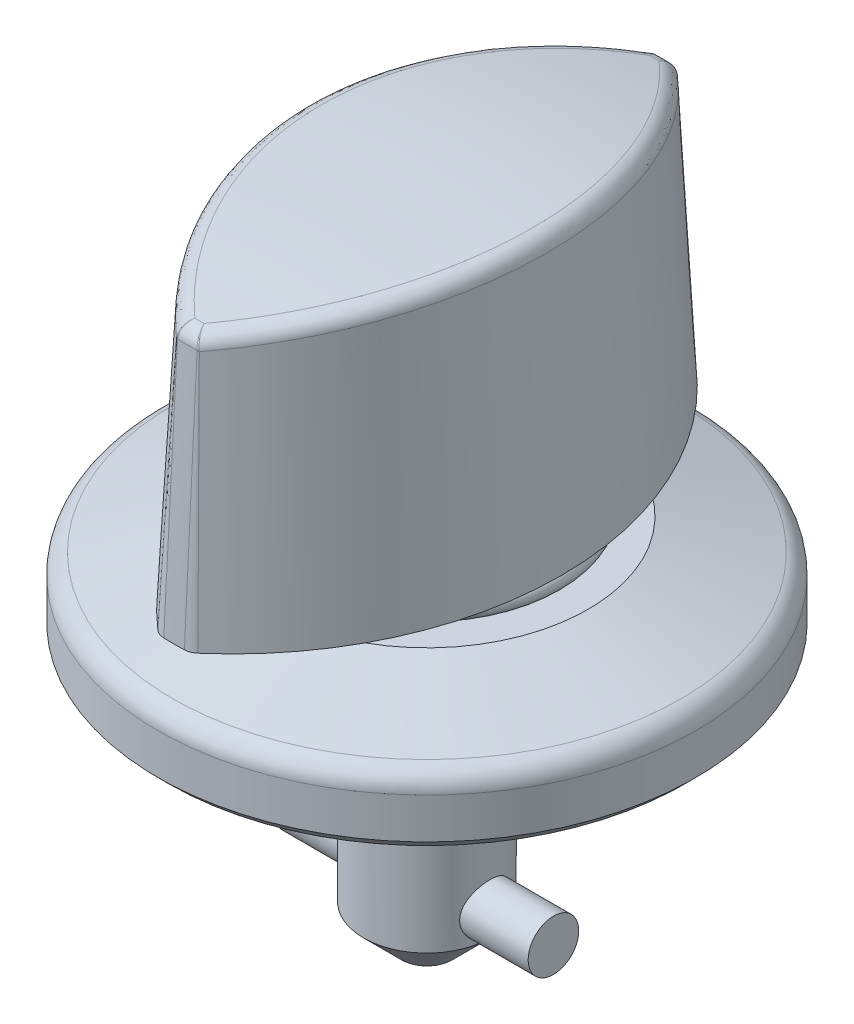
ISO-10303-21;
HEADER;
FILE_DESCRIPTION(('STEP AP214'),'2;1');
FILE_NAME('part.step','',(''),(''),'','','');
FILE_SCHEMA(('AUTOMOTIVE_DESIGN { 1 0 10303 214 1 1 1 1 }'));
ENDSEC;
DATA;
#1=APPLICATION_CONTEXT('core data for automotive mechanical design processes');
#2=APPLICATION_PROTOCOL_DEFINITION('international standard','automotive_design',2000,#1);
#3=PRODUCT_CONTEXT('',#1,'mechanical');
#4=PRODUCT('Part','Part','',(#3));
#5=PRODUCT_RELATED_PRODUCT_CATEGORY('part','',(#4));
#6=PRODUCT_DEFINITION_FORMATION('','',#4);
#7=PRODUCT_DEFINITION_CONTEXT('part definition',#1,'design');
#8=PRODUCT_DEFINITION('design','',#6,#7);
#9=PRODUCT_DEFINITION_SHAPE('','',#8);
#10=(LENGTH_UNIT() NAMED_UNIT(*) SI_UNIT(.MILLI.,.METRE.));
#11=(NAMED_UNIT(*) PLANE_ANGLE_UNIT() SI_UNIT($,.RADIAN.));
#12=(NAMED_UNIT(*) SI_UNIT($,.STERADIAN.) SOLID_ANGLE_UNIT());
#13=UNCERTAINTY_MEASURE_WITH_UNIT(LENGTH_MEASURE(1.E-05),#10,'distance_accuracy_value','');
#14=(GEOMETRIC_REPRESENTATION_CONTEXT(3) GLOBAL_UNCERTAINTY_ASSIGNED_CONTEXT((#13)) GLOBAL_UNIT_ASSIGNED_CONTEXT((#10,
#11,#12)) REPRESENTATION_CONTEXT('',''));
#15=CARTESIAN_POINT('',(0.,0.,0.));
#16=DIRECTION('',(0.,0.,1.));
#17=DIRECTION('',(1.,0.,0.));
#18=AXIS2_PLACEMENT_3D('',#15,#16,#17);
#19=CARTESIAN_POINT('',(0.,-11.5,0.));
#20=DIRECTION('',(0.,-1.,0.));
#21=DIRECTION('',(0.,0.,-1.));
#22=AXIS2_PLACEMENT_3D('',#19,#20,#21);
#23=PLANE('',#22);
#24=CARTESIAN_POINT('',(0.,-11.5,0.));
#25=DIRECTION('',(0.,-1.,0.));
#26=DIRECTION('',(0.,0.,-1.));
#27=AXIS2_PLACEMENT_3D('',#24,#25,#26);
#28=CIRCLE('',#27,1.6);
#29=CARTESIAN_POINT('',(0.,-11.5,-1.6));
#30=VERTEX_POINT('',#29);
#31=EDGE_CURVE('P0_E41',#30,#30,#28,.T.);
#32=ORIENTED_EDGE('',*,*,#31,.T.);
#33=EDGE_LOOP('',(#32));
#34=FACE_BOUND('',#33,.T.);
#35=ADVANCED_FACE('P0_F16',(#34),#23,.T.);
#36=CARTESIAN_POINT('',(0.,-11.5,0.));
#37=DIRECTION('',(0.,1.,0.));
#38=DIRECTION('',(0.,0.,1.));
#39=AXIS2_PLACEMENT_3D('',#36,#37,#38);
#40=CONICAL_SURFACE('',#39,1.6,0.78539816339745);
#41=CARTESIAN_POINT('',(0.,-9.10000000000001,0.));
#42=DIRECTION('',(0.,-1.,0.));
#43=DIRECTION('',(0.,0.,-1.));
#44=AXIS2_PLACEMENT_3D('',#41,#42,#43);
#45=CIRCLE('',#44,4.);
#46=CARTESIAN_POINT('',(4.00000000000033,-9.10000000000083,0.));
#47=VERTEX_POINT('',#46);
#48=CARTESIAN_POINT('',(-4.,-9.10000000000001,0.));
#49=VERTEX_POINT('',#48);
#50=EDGE_CURVE('P0_E34',#47,#49,#45,.T.);
#51=ORIENTED_EDGE('',*,*,#50,.T.);
#52=EDGE_CURVE('P0_E40',#49,#47,#45,.T.);
#53=ORIENTED_EDGE('',*,*,#52,.T.);
#54=EDGE_LOOP('',(#51,#53));
#55=FACE_BOUND('',#54,.T.);
#56=ORIENTED_EDGE('',*,*,#31,.F.);
#57=EDGE_LOOP('',(#56));
#58=FACE_BOUND('',#57,.T.);
#59=ADVANCED_FACE('P0_F38',(#55,#58),#40,.T.);
#60=CARTESIAN_POINT('',(0.,-11.5,0.));
#61=DIRECTION('',(0.,-1.,0.));
#62=DIRECTION('',(0.,0.,-1.));
#63=AXIS2_PLACEMENT_3D('',#60,#61,#62);
#64=CYLINDRICAL_SURFACE('',#63,4.);
#65=CARTESIAN_POINT('',(0.,0.,0.));
#66=DIRECTION('',(0.,-1.,0.));
#67=DIRECTION('',(0.,0.,-1.));
#68=AXIS2_PLACEMENT_3D('',#65,#66,#67);
#69=CIRCLE('',#68,4.);
#70=CARTESIAN_POINT('',(0.,0.,-4.));
#71=VERTEX_POINT('',#70);
#72=EDGE_CURVE('P0_E45',#71,#71,#69,.T.);
#73=ORIENTED_EDGE('',*,*,#72,.T.);
#74=EDGE_LOOP('',(#73));
#75=FACE_BOUND('',#74,.T.);
#76=ORIENTED_EDGE('',*,*,#50,.F.);
#77=CARTESIAN_POINT('',(3.66606055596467,-7.50000000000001,1.6));
#78=CARTESIAN_POINT('',(3.66606921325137,-7.58571159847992,1.59999060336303));
#79=CARTESIAN_POINT('',(3.66910881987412,-7.67154442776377,1.59307185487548));
#80=CARTESIAN_POINT('',(3.68088731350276,-7.84074786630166,1.56565522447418));
#81=CARTESIAN_POINT('',(3.68964076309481,-7.9241116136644,1.5451226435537));
#82=CARTESIAN_POINT('',(3.71168364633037,-8.08564235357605,1.49138802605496));
#83=CARTESIAN_POINT('',(3.72495597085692,-8.16382763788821,1.45823372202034));
#84=CARTESIAN_POINT('',(3.75451732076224,-8.3135080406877,1.38033621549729));
#85=CARTESIAN_POINT('',(3.77080568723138,-8.3850046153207,1.335595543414));
#86=CARTESIAN_POINT('',(3.80560692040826,-8.52340832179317,1.23305757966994));
#87=CARTESIAN_POINT('',(3.82419134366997,-8.58988513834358,1.17470348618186));
#88=CARTESIAN_POINT('',(3.86089965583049,-8.71242319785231,1.04776728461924));
#89=CARTESIAN_POINT('',(3.87902338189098,-8.7684808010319,0.979181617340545));
#90=CARTESIAN_POINT('',(3.91362726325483,-8.87072511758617,0.830405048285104));
#91=CARTESIAN_POINT('',(3.93001442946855,-8.91643544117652,0.749863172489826));
#92=CARTESIAN_POINT('',(3.95843142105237,-8.99347485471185,0.581460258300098));
#93=CARTESIAN_POINT('',(3.97046301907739,-9.02480979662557,0.493602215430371));
#94=CARTESIAN_POINT('',(3.98830660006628,-9.07067318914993,0.317573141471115));
#95=CARTESIAN_POINT('',(3.99439149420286,-9.08594185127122,0.229623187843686));
#96=CARTESIAN_POINT('',(4.00064248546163,-9.10162278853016,0.0522130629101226));
#97=CARTESIAN_POINT('',(4.0008107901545,-9.10204060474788,-0.0372465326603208));
#98=CARTESIAN_POINT('',(3.99537570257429,-9.08841378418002,-0.209785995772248));
#99=CARTESIAN_POINT('',(3.99009597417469,-9.07518018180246,-0.292941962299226));
#100=CARTESIAN_POINT('',(3.97479433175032,-9.0360056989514,-0.455738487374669));
#101=CARTESIAN_POINT('',(3.9647720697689,-9.0100638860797,-0.535378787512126));
#102=CARTESIAN_POINT('',(3.9407745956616,-8.94589081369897,-0.690318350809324));
#103=CARTESIAN_POINT('',(3.9267420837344,-8.90748022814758,-0.765534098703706));
#104=CARTESIAN_POINT('',(3.89611668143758,-8.8196279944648,-0.908646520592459));
#105=CARTESIAN_POINT('',(3.87952291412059,-8.77018256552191,-0.976540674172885));
#106=CARTESIAN_POINT('',(3.84417309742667,-8.65788069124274,-1.10781506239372));
#107=CARTESIAN_POINT('',(3.82534661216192,-8.59435688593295,-1.17060627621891));
#108=CARTESIAN_POINT('',(3.78849328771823,-8.45760754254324,-1.28488593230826));
#109=CARTESIAN_POINT('',(3.77046671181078,-8.38437884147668,-1.33637067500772));
#110=CARTESIAN_POINT('',(3.7367751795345,-8.22766478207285,-1.42792335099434));
#111=CARTESIAN_POINT('',(3.72119131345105,-8.14394813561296,-1.46762772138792));
#112=CARTESIAN_POINT('',(3.69510072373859,-7.9702276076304,-1.53214100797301));
#113=CARTESIAN_POINT('',(3.68459070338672,-7.88022785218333,-1.55695959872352));
#114=CARTESIAN_POINT('',(3.67063807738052,-7.70237137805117,-1.58956395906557));
#115=CARTESIAN_POINT('',(3.6668029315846,-7.61471964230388,-1.59829767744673));
#116=CARTESIAN_POINT('',(3.66551598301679,-7.43913823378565,-1.60124906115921));
#117=CARTESIAN_POINT('',(3.6680622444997,-7.35120865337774,-1.59547112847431));
#118=CARTESIAN_POINT('',(3.67884835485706,-7.18283285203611,-1.57042631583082));
#119=CARTESIAN_POINT('',(3.68675566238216,-7.10224565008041,-1.55194644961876));
#120=CARTESIAN_POINT('',(3.70696040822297,-6.9453692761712,-1.50304334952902));
#121=CARTESIAN_POINT('',(3.71925881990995,-6.86908106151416,-1.47261746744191));
#122=CARTESIAN_POINT('',(3.7474702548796,-6.71951811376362,-1.39930851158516));
#123=CARTESIAN_POINT('',(3.76350963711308,-6.64649104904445,-1.35597029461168));
#124=CARTESIAN_POINT('',(3.7972030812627,-6.50841361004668,-1.2585321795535));
#125=CARTESIAN_POINT('',(3.8148577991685,-6.44336650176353,-1.20442789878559));
#126=CARTESIAN_POINT('',(3.85136732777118,-6.31810127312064,-1.08227536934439));
#127=CARTESIAN_POINT('',(3.87021445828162,-6.25859474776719,-1.01349234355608));
#128=CARTESIAN_POINT('',(3.9057583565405,-6.15185833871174,-0.866466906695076));
#129=CARTESIAN_POINT('',(3.92245503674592,-6.10462895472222,-0.788224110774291));
#130=CARTESIAN_POINT('',(3.95186972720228,-6.02396189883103,-0.624223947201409));
#131=CARTESIAN_POINT('',(3.96458868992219,-5.99052092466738,-0.538468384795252));
#132=CARTESIAN_POINT('',(3.98458170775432,-5.93876091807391,-0.36191487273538));
#133=CARTESIAN_POINT('',(3.99185871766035,-5.92043367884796,-0.271119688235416));
#134=CARTESIAN_POINT('',(3.9998320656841,-5.9003962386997,-0.0934532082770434));
#135=CARTESIAN_POINT('',(4.00092677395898,-5.89767989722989,-0.00671239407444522));
#136=CARTESIAN_POINT('',(3.99748833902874,-5.90628438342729,0.165947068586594));
#137=CARTESIAN_POINT('',(3.9929560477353,-5.91760308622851,0.251865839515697));
#138=CARTESIAN_POINT('',(3.97897210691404,-5.95323743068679,0.417736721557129));
#139=CARTESIAN_POINT('',(3.96967584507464,-5.97714315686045,0.497791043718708));
#140=CARTESIAN_POINT('',(3.9471595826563,-6.03684224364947,0.652737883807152));
#141=CARTESIAN_POINT('',(3.93393885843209,-6.07263779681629,0.72762944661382));
#142=CARTESIAN_POINT('',(3.90414475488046,-6.15688255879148,0.873762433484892));
#143=CARTESIAN_POINT('',(3.88744903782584,-6.20582103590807,0.94469630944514));
#144=CARTESIAN_POINT('',(3.85271522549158,-6.31423081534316,1.07764322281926));
#145=CARTESIAN_POINT('',(3.834676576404,-6.3737064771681,1.1396525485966));
#146=CARTESIAN_POINT('',(3.79790210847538,-6.50585217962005,1.25696101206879));
#147=CARTESIAN_POINT('',(3.77919226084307,-6.57911109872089,1.31160710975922));
#148=CARTESIAN_POINT('',(3.74439737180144,-6.73435370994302,1.40787796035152));
#149=CARTESIAN_POINT('',(3.72831263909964,-6.81633842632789,1.44950118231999));
#150=CARTESIAN_POINT('',(3.70207091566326,-6.97922976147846,1.51519287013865));
#151=CARTESIAN_POINT('',(3.69151134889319,-7.05957218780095,1.54050201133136));
#152=CARTESIAN_POINT('',(3.67556802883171,-7.22358833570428,1.57817420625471));
#153=CARTESIAN_POINT('',(3.6701698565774,-7.30725209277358,1.59057333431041));
#154=CARTESIAN_POINT('',(3.66659567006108,-7.42750204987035,1.59877140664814));
#155=CARTESIAN_POINT('',(3.66605689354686,-7.46374017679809,1.6000039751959));
#156=CARTESIAN_POINT('',(3.66606055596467,-7.50000000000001,1.6));
#157=B_SPLINE_CURVE_WITH_KNOTS('',3,(#77,#78,#79,#80,#81,#82,#83,#84,#85,#86,#87,#88,#89,#90,
#91,#92,#93,#94,#95,#96,#97,#98,#99,#100,#101,#102,#103,#104,#105,#106,#107,#108,#109,#110,#111,
#112,#113,#114,#115,#116,#117,#118,#119,#120,#121,#122,#123,#124,#125,#126,#127,#128,#129,#130,
#131,#132,#133,#134,#135,#136,#137,#138,#139,#140,#141,#142,#143,#144,#145,#146,#147,#148,#149,
#150,#151,#152,#153,#154,#155,#156),.UNSPECIFIED.,.T.,.F.,(4,2,2,2,2,2,2,2,2,2,2,2,2,2,2,2,2,2,
2,2,2,2,2,2,2,2,2,2,2,2,2,2,2,2,2,2,2,2,2,4),(0.,0.257022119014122,0.514701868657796,
0.771416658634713,1.02807543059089,1.2980449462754,1.56810859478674,1.84882135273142,
2.12941973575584,2.39643346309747,2.66334756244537,2.91526915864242,3.16720924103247,
3.42294640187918,3.67877131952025,3.95139235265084,4.22410245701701,4.50451566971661,
4.78474643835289,5.04785718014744,5.3108881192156,5.55893798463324,5.80704286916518,
6.06520923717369,6.32348091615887,6.60082987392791,6.87819011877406,7.15548389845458,
7.43262700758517,7.6916883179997,7.95071041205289,8.2017759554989,8.45288782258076,
8.71509640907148,8.97741373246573,9.25597002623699,9.53455905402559,9.78813328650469,
10.040997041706,10.1497288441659),.UNSPECIFIED.);
#158=EDGE_CURVE('P0_E11',#47,#47,#157,.T.);
#159=ORIENTED_EDGE('',*,*,#158,.F.);
#160=ORIENTED_EDGE('',*,*,#52,.F.);
#161=CARTESIAN_POINT('',(-3.66606055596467,-7.50000000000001,1.6));
#162=CARTESIAN_POINT('',(-3.66606921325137,-7.4142884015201,1.59999060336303));
#163=CARTESIAN_POINT('',(-3.66910881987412,-7.32845557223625,1.59307185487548));
#164=CARTESIAN_POINT('',(-3.68088731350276,-7.15925213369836,1.56565522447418));
#165=CARTESIAN_POINT('',(-3.68964076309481,-7.07588838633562,1.5451226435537));
#166=CARTESIAN_POINT('',(-3.71168364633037,-6.91435764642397,1.49138802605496));
#167=CARTESIAN_POINT('',(-3.72495597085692,-6.8361723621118,1.45823372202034));
#168=CARTESIAN_POINT('',(-3.75451732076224,-6.68649195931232,1.38033621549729));
#169=CARTESIAN_POINT('',(-3.77080568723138,-6.61499538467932,1.335595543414));
#170=CARTESIAN_POINT('',(-3.80560692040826,-6.47659167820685,1.23305757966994));
#171=CARTESIAN_POINT('',(-3.82419134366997,-6.41011486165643,1.17470348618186));
#172=CARTESIAN_POINT('',(-3.86089965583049,-6.28757680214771,1.04776728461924));
#173=CARTESIAN_POINT('',(-3.87902338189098,-6.23151919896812,0.979181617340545));
#174=CARTESIAN_POINT('',(-3.91362726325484,-6.12927488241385,0.830405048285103));
#175=CARTESIAN_POINT('',(-3.93001442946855,-6.08356455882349,0.749863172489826));
#176=CARTESIAN_POINT('',(-3.95843142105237,-6.00652514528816,0.581460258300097));
#177=CARTESIAN_POINT('',(-3.97046301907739,-5.97519020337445,0.49360221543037));
#178=CARTESIAN_POINT('',(-3.98830660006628,-5.92932681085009,0.317573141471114));
#179=CARTESIAN_POINT('',(-3.99439149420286,-5.91405814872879,0.229623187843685));
#180=CARTESIAN_POINT('',(-4.00064248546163,-5.89837721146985,0.052213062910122));
#181=CARTESIAN_POINT('',(-4.0008107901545,-5.89795939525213,-0.0372465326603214));
#182=CARTESIAN_POINT('',(-3.99537570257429,-5.91158621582,-0.209785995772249));
#183=CARTESIAN_POINT('',(-3.99009597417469,-5.92481981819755,-0.292941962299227));
#184=CARTESIAN_POINT('',(-3.97479433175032,-5.96399430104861,-0.45573848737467));
#185=CARTESIAN_POINT('',(-3.9647720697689,-5.98993611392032,-0.535378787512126));
#186=CARTESIAN_POINT('',(-3.9407745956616,-6.05410918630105,-0.690318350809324));
#187=CARTESIAN_POINT('',(-3.9267420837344,-6.09251977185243,-0.765534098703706));
#188=CARTESIAN_POINT('',(-3.89611668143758,-6.18037200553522,-0.908646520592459));
#189=CARTESIAN_POINT('',(-3.87952291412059,-6.22981743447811,-0.976540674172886));
#190=CARTESIAN_POINT('',(-3.84417309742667,-6.34211930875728,-1.10781506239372));
#191=CARTESIAN_POINT('',(-3.82534661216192,-6.40564311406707,-1.17060627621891));
#192=CARTESIAN_POINT('',(-3.78849328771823,-6.54239245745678,-1.28488593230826));
#193=CARTESIAN_POINT('',(-3.77046671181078,-6.61562115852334,-1.33637067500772));
#194=CARTESIAN_POINT('',(-3.7367751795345,-6.77233521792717,-1.42792335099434));
#195=CARTESIAN_POINT('',(-3.72119131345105,-6.85605186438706,-1.46762772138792));
#196=CARTESIAN_POINT('',(-3.69510072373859,-7.02977239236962,-1.53214100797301));
#197=CARTESIAN_POINT('',(-3.68459070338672,-7.11977214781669,-1.55695959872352));
#198=CARTESIAN_POINT('',(-3.67063807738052,-7.29762862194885,-1.58956395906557));
#199=CARTESIAN_POINT('',(-3.66680293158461,-7.38528035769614,-1.59829767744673));
#200=CARTESIAN_POINT('',(-3.66551598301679,-7.56086176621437,-1.60124906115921));
#201=CARTESIAN_POINT('',(-3.6680622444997,-7.64879134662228,-1.59547112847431));
#202=CARTESIAN_POINT('',(-3.67884835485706,-7.81716714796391,-1.57042631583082));
#203=CARTESIAN_POINT('',(-3.68675566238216,-7.89775434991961,-1.55194644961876));
#204=CARTESIAN_POINT('',(-3.70696040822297,-8.05463072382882,-1.50304334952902));
#205=CARTESIAN_POINT('',(-3.71925881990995,-8.13091893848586,-1.47261746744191));
#206=CARTESIAN_POINT('',(-3.7474702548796,-8.2804818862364,-1.39930851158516));
#207=CARTESIAN_POINT('',(-3.76350963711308,-8.35350895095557,-1.35597029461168));
#208=CARTESIAN_POINT('',(-3.7972030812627,-8.49158638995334,-1.2585321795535));
#209=CARTESIAN_POINT('',(-3.8148577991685,-8.55663349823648,-1.20442789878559));
#210=CARTESIAN_POINT('',(-3.85136732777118,-8.68189872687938,-1.08227536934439));
#211=CARTESIAN_POINT('',(-3.87021445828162,-8.74140525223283,-1.01349234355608));
#212=CARTESIAN_POINT('',(-3.9057583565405,-8.84814166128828,-0.866466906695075));
#213=CARTESIAN_POINT('',(-3.92245503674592,-8.8953710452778,-0.788224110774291));
#214=CARTESIAN_POINT('',(-3.95186972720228,-8.97603810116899,-0.624223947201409));
#215=CARTESIAN_POINT('',(-3.96458868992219,-9.00947907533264,-0.538468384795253));
#216=CARTESIAN_POINT('',(-3.98458170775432,-9.06123908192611,-0.36191487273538));
#217=CARTESIAN_POINT('',(-3.99185871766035,-9.07956632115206,-0.271119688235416));
#218=CARTESIAN_POINT('',(-3.9998320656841,-9.09960376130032,-0.0934532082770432));
#219=CARTESIAN_POINT('',(-4.00092677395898,-9.10232010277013,-0.00671239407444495));
#220=CARTESIAN_POINT('',(-3.99748833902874,-9.09371561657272,0.165947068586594));
#221=CARTESIAN_POINT('',(-3.9929560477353,-9.08239691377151,0.251865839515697));
#222=CARTESIAN_POINT('',(-3.97897210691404,-9.04676256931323,0.417736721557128));
#223=CARTESIAN_POINT('',(-3.96967584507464,-9.02285684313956,0.497791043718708));
#224=CARTESIAN_POINT('',(-3.9471595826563,-8.96315775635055,0.652737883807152));
#225=CARTESIAN_POINT('',(-3.93393885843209,-8.92736220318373,0.72762944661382));
#226=CARTESIAN_POINT('',(-3.90414475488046,-8.84311744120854,0.873762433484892));
#227=CARTESIAN_POINT('',(-3.88744903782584,-8.79417896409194,0.94469630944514));
#228=CARTESIAN_POINT('',(-3.85271522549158,-8.68576918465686,1.07764322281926));
#229=CARTESIAN_POINT('',(-3.834676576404,-8.62629352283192,1.1396525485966));
#230=CARTESIAN_POINT('',(-3.79790210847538,-8.49414782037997,1.25696101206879));
#231=CARTESIAN_POINT('',(-3.77919226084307,-8.42088890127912,1.31160710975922));
#232=CARTESIAN_POINT('',(-3.74439737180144,-8.26564629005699,1.40787796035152));
#233=CARTESIAN_POINT('',(-3.72831263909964,-8.18366157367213,1.44950118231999));
#234=CARTESIAN_POINT('',(-3.70207091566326,-8.02077023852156,1.51519287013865));
#235=CARTESIAN_POINT('',(-3.69151134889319,-7.94042781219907,1.54050201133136));
#236=CARTESIAN_POINT('',(-3.67556802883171,-7.77641166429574,1.57817420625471));
#237=CARTESIAN_POINT('',(-3.6701698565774,-7.69274790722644,1.59057333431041));
#238=CARTESIAN_POINT('',(-3.66659567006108,-7.57249795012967,1.59877140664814));
#239=CARTESIAN_POINT('',(-3.66605689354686,-7.53625982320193,1.6000039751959));
#240=CARTESIAN_POINT('',(-3.66606055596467,-7.50000000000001,1.6));
#241=B_SPLINE_CURVE_WITH_KNOTS('',3,(#161,#162,#163,#164,#165,#166,#167,#168,#169,#170,#171,
#172,#173,#174,#175,#176,#177,#178,#179,#180,#181,#182,#183,#184,#185,#186,#187,#188,#189,#190,
#191,#192,#193,#194,#195,#196,#197,#198,#199,#200,#201,#202,#203,#204,#205,#206,#207,#208,#209,
#210,#211,#212,#213,#214,#215,#216,#217,#218,#219,#220,#221,#222,#223,#224,#225,#226,#227,#228,
#229,#230,#231,#232,#233,#234,#235,#236,#237,#238,#239,#240),.UNSPECIFIED.,.T.,.F.,(4,2,2,2,2,2,
2,2,2,2,2,2,2,2,2,2,2,2,2,2,2,2,2,2,2,2,2,2,2,2,2,2,2,2,2,2,2,2,2,4),(0.,0.257022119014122,
0.514701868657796,0.771416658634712,1.02807543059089,1.2980449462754,1.56810859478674,
1.84882135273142,2.12941973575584,2.39643346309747,2.66334756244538,2.91526915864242,
3.16720924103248,3.42294640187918,3.67877131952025,3.95139235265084,4.22410245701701,
4.50451566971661,4.78474643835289,5.04785718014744,5.31088811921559,5.55893798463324,
5.80704286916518,6.06520923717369,6.32348091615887,6.60082987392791,6.87819011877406,
7.15548389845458,7.43262700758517,7.6916883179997,7.95071041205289,8.2017759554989,
8.45288782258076,8.71509640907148,8.97741373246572,9.25597002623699,9.53455905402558,
9.78813328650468,10.040997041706,10.1497288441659),.UNSPECIFIED.);
#242=EDGE_CURVE('P0_E27',#49,#49,#241,.T.);
#243=ORIENTED_EDGE('',*,*,#242,.F.);
#244=EDGE_LOOP('',(#76,#159,#160,#243));
#245=FACE_BOUND('',#244,.T.);
#246=ADVANCED_FACE('P0_F43',(#75,#245),#64,.T.);
#247=CARTESIAN_POINT('',(4.,0.,0.));
#248=DIRECTION('',(0.,1.,0.));
#249=DIRECTION('',(0.,0.,1.));
#250=AXIS2_PLACEMENT_3D('',#247,#248,#249);
#251=PLANE('',#250);
#252=CARTESIAN_POINT('',(0.,0.,0.));
#253=DIRECTION('',(0.,-1.,0.));
#254=DIRECTION('',(0.,0.,-1.));
#255=AXIS2_PLACEMENT_3D('',#252,#253,#254);
#256=CIRCLE('',#255,3.2);
#257=CARTESIAN_POINT('',(0.,0.,-3.2));
#258=VERTEX_POINT('',#257);
#259=EDGE_CURVE('P0_E47',#258,#258,#256,.T.);
#260=ORIENTED_EDGE('',*,*,#259,.T.);
#261=EDGE_LOOP('',(#260));
#262=FACE_BOUND('',#261,.T.);
#263=ORIENTED_EDGE('',*,*,#72,.F.);
#264=EDGE_LOOP('',(#263));
#265=FACE_BOUND('',#264,.T.);
#266=ADVANCED_FACE('P0_F79',(#262,#265),#251,.T.);
#267=CARTESIAN_POINT('',(0.,-11.5,0.));
#268=DIRECTION('',(0.,-1.,0.));
#269=DIRECTION('',(0.,0.,-1.));
#270=AXIS2_PLACEMENT_3D('',#267,#268,#269);
#271=CYLINDRICAL_SURFACE('',#270,3.2);
#272=CARTESIAN_POINT('',(0.,20.2,0.));
#273=DIRECTION('',(0.,-1.,0.));
#274=DIRECTION('',(0.,0.,-1.));
#275=AXIS2_PLACEMENT_3D('',#272,#273,#274);
#276=CIRCLE('',#275,3.2);
#277=CARTESIAN_POINT('',(0.,20.2,-3.2));
#278=VERTEX_POINT('',#277);
#279=EDGE_CURVE('P0_E155',#278,#278,#276,.T.);
#280=ORIENTED_EDGE('',*,*,#279,.T.);
#281=EDGE_LOOP('',(#280));
#282=FACE_BOUND('',#281,.T.);
#283=ORIENTED_EDGE('',*,*,#259,.F.);
#284=EDGE_LOOP('',(#283));
#285=FACE_BOUND('',#284,.T.);
#286=ADVANCED_FACE('P0_F76',(#282,#285),#271,.T.);
#287=CARTESIAN_POINT('',(0.,20.2,0.));
#288=DIRECTION('',(0.,-1.,0.));
#289=DIRECTION('',(0.,0.,-1.));
#290=AXIS2_PLACEMENT_3D('',#287,#288,#289);
#291=CONICAL_SURFACE('',#290,3.2,0.785398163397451);
#292=CARTESIAN_POINT('',(0.,21.,0.));
#293=DIRECTION('',(0.,-1.,0.));
#294=DIRECTION('',(0.,0.,-1.));
#295=AXIS2_PLACEMENT_3D('',#292,#293,#294);
#296=CIRCLE('',#295,2.4);
#297=CARTESIAN_POINT('',(0.,21.,-2.4));
#298=VERTEX_POINT('',#297);
#299=EDGE_CURVE('P0_E150',#298,#298,#296,.T.);
#300=ORIENTED_EDGE('',*,*,#299,.T.);
#301=EDGE_LOOP('',(#300));
#302=FACE_BOUND('',#301,.T.);
#303=ORIENTED_EDGE('',*,*,#279,.F.);
#304=EDGE_LOOP('',(#303));
#305=FACE_BOUND('',#304,.T.);
#306=ADVANCED_FACE('P0_F72',(#302,#305),#291,.T.);
#307=CARTESIAN_POINT('',(2.4,21.,0.));
#308=DIRECTION('',(0.,1.,0.));
#309=DIRECTION('',(0.,0.,1.));
#310=AXIS2_PLACEMENT_3D('',#307,#308,#309);
#311=PLANE('',#310);
#312=ORIENTED_EDGE('',*,*,#299,.F.);
#313=EDGE_LOOP('',(#312));
#314=FACE_BOUND('',#313,.T.);
#315=ADVANCED_FACE('P0_F68',(#314),#311,.T.);
#316=CARTESIAN_POINT('',(-8.,-7.50000000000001,0.));
#317=DIRECTION('',(-1.,0.,0.));
#318=DIRECTION('',(0.,0.,1.));
#319=AXIS2_PLACEMENT_3D('',#316,#317,#318);
#320=PLANE('',#319);
#321=CARTESIAN_POINT('',(-8.,-7.50000000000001,0.));
#322=DIRECTION('',(-1.,0.,0.));
#323=DIRECTION('',(0.,0.,1.));
#324=AXIS2_PLACEMENT_3D('',#321,#322,#323);
#325=CIRCLE('',#324,1.6);
#326=CARTESIAN_POINT('',(-8.,-7.50000000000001,1.6));
#327=VERTEX_POINT('',#326);
#328=EDGE_CURVE('P0_E147',#327,#327,#325,.T.);
#329=ORIENTED_EDGE('',*,*,#328,.T.);
#330=EDGE_LOOP('',(#329));
#331=FACE_BOUND('',#330,.T.);
#332=ADVANCED_FACE('P0_F62',(#331),#320,.T.);
#333=CARTESIAN_POINT('',(-5.26029262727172,-7.50000000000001,0.));
#334=DIRECTION('',(-1.,0.,0.));
#335=DIRECTION('',(0.,0.,1.));
#336=AXIS2_PLACEMENT_3D('',#333,#334,#335);
#337=CYLINDRICAL_SURFACE('',#336,1.6);
#338=ORIENTED_EDGE('',*,*,#242,.T.);
#339=EDGE_LOOP('',(#338));
#340=FACE_BOUND('',#339,.T.);
#341=ORIENTED_EDGE('',*,*,#328,.F.);
#342=EDGE_LOOP('',(#341));
#343=FACE_BOUND('',#342,.T.);
#344=ADVANCED_FACE('P0_F56',(#340,#343),#337,.T.);
#345=ORIENTED_EDGE('',*,*,#158,.T.);
#346=EDGE_LOOP('',(#345));
#347=FACE_BOUND('',#346,.T.);
#348=CARTESIAN_POINT('',(8.,-7.50000000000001,0.));
#349=DIRECTION('',(-1.,0.,0.));
#350=DIRECTION('',(0.,0.,1.));
#351=AXIS2_PLACEMENT_3D('',#348,#349,#350);
#352=CIRCLE('',#351,1.6);
#353=CARTESIAN_POINT('',(8.,-7.50000000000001,1.6));
#354=VERTEX_POINT('',#353);
#355=EDGE_CURVE('P0_E145',#354,#354,#352,.T.);
#356=ORIENTED_EDGE('',*,*,#355,.T.);
#357=EDGE_LOOP('',(#356));
#358=FACE_BOUND('',#357,.T.);
#359=ADVANCED_FACE('P0_F61',(#347,#358),#337,.T.);
#360=CARTESIAN_POINT('',(8.,-9.10000000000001,0.));
#361=DIRECTION('',(1.,0.,0.));
#362=DIRECTION('',(0.,0.,-1.));
#363=AXIS2_PLACEMENT_3D('',#360,#361,#362);
#364=PLANE('',#363);
#365=ORIENTED_EDGE('',*,*,#355,.F.);
#366=EDGE_LOOP('',(#365));
#367=FACE_BOUND('',#366,.T.);
#368=ADVANCED_FACE('P0_F64',(#367),#364,.T.);
#369=CLOSED_SHELL('',(#35,#59,#246,#266,#286,#306,#315,#332,#344,#359,#368));
#370=MANIFOLD_SOLID_BREP('P0_B1',#369);
#371=CARTESIAN_POINT('',(16.,13.,0.));
#372=DIRECTION('',(0.,-1.,0.));
#373=DIRECTION('',(0.,0.,-1.));
#374=AXIS2_PLACEMENT_3D('',#371,#372,#373);
#375=PLANE('',#374);
#376=CARTESIAN_POINT('',(0.,13.,0.));
#377=DIRECTION('',(0.,-1.,0.));
#378=DIRECTION('',(0.,0.,-1.));
#379=AXIS2_PLACEMENT_3D('',#376,#377,#378);
#380=CIRCLE('',#379,3.2);
#381=CARTESIAN_POINT('',(0.,13.,-3.2));
#382=VERTEX_POINT('',#381);
#383=EDGE_CURVE('P1_E678',#382,#382,#380,.T.);
#384=ORIENTED_EDGE('',*,*,#383,.F.);
#385=EDGE_LOOP('',(#384));
#386=FACE_BOUND('',#385,.T.);
#387=CARTESIAN_POINT('',(-12.25,13.,0.));
#388=DIRECTION('',(0.,-1.,0.));
#389=DIRECTION('',(0.,0.,1.));
#390=AXIS2_PLACEMENT_3D('',#387,#388,#389);
#391=CIRCLE('',#390,20.75);
#392=CARTESIAN_POINT('',(1.26349780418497,13.,-15.7463607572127));
#393=VERTEX_POINT('',#392);
#394=CARTESIAN_POINT('',(1.26349780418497,13.,15.7463607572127));
#395=VERTEX_POINT('',#394);
#396=EDGE_CURVE('P1_E758',#393,#395,#391,.T.);
#397=ORIENTED_EDGE('',*,*,#396,.T.);
#398=CARTESIAN_POINT('',(0.612244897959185,13.,14.987499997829));
#399=DIRECTION('',(0.,-1.,0.));
#400=DIRECTION('',(0.,0.,-1.));
#401=AXIS2_PLACEMENT_3D('',#398,#399,#400);
#402=CIRCLE('',#401,1.);
#403=CARTESIAN_POINT('',(0.653061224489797,13.,15.9866666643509));
#404=VERTEX_POINT('',#403);
#405=EDGE_CURVE('P1_E76',#395,#404,#402,.T.);
#406=ORIENTED_EDGE('',*,*,#405,.T.);
#407=CARTESIAN_POINT('',(0.,13.,0.));
#408=DIRECTION('',(0.,-1.,0.));
#409=DIRECTION('',(0.,0.,-1.));
#410=AXIS2_PLACEMENT_3D('',#407,#408,#409);
#411=CIRCLE('',#410,16.);
#412=CARTESIAN_POINT('',(-0.653061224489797,13.,15.9866666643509));
#413=VERTEX_POINT('',#412);
#414=EDGE_CURVE('P1_E691',#404,#413,#411,.T.);
#415=ORIENTED_EDGE('',*,*,#414,.T.);
#416=CARTESIAN_POINT('',(-0.612244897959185,13.,14.987499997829));
#417=DIRECTION('',(0.,-1.,0.));
#418=DIRECTION('',(0.,0.,-1.));
#419=AXIS2_PLACEMENT_3D('',#416,#417,#418);
#420=CIRCLE('',#419,1.);
#421=CARTESIAN_POINT('',(-1.26349780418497,13.,15.7463607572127));
#422=VERTEX_POINT('',#421);
#423=EDGE_CURVE('P1_E686',#413,#422,#420,.T.);
#424=ORIENTED_EDGE('',*,*,#423,.T.);
#425=CARTESIAN_POINT('',(12.25,13.,0.));
#426=DIRECTION('',(0.,-1.,0.));
#427=DIRECTION('',(0.,0.,-1.));
#428=AXIS2_PLACEMENT_3D('',#425,#426,#427);
#429=CIRCLE('',#428,20.75);
#430=CARTESIAN_POINT('',(-1.26349780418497,13.,-15.7463607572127));
#431=VERTEX_POINT('',#430);
#432=EDGE_CURVE('P1_E697',#422,#431,#429,.T.);
#433=ORIENTED_EDGE('',*,*,#432,.T.);
#434=CARTESIAN_POINT('',(-0.612244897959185,13.,-14.987499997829));
#435=DIRECTION('',(0.,-1.,0.));
#436=DIRECTION('',(0.,0.,-1.));
#437=AXIS2_PLACEMENT_3D('',#434,#435,#436);
#438=CIRCLE('',#437,1.);
#439=CARTESIAN_POINT('',(-0.653061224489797,13.,-15.9866666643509));
#440=VERTEX_POINT('',#439);
#441=EDGE_CURVE('P1_E705',#431,#440,#438,.T.);
#442=ORIENTED_EDGE('',*,*,#441,.T.);
#443=CARTESIAN_POINT('',(0.653061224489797,13.,-15.9866666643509));
#444=VERTEX_POINT('',#443);
#445=EDGE_CURVE('P1_E603',#440,#444,#411,.T.);
#446=ORIENTED_EDGE('',*,*,#445,.T.);
#447=CARTESIAN_POINT('',(0.612244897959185,13.,-14.987499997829));
#448=DIRECTION('',(0.,-1.,0.));
#449=DIRECTION('',(0.,0.,-1.));
#450=AXIS2_PLACEMENT_3D('',#447,#448,#449);
#451=CIRCLE('',#450,1.);
#452=EDGE_CURVE('P1_E689',#444,#393,#451,.T.);
#453=ORIENTED_EDGE('',*,*,#452,.T.);
#454=EDGE_LOOP('',(#397,#406,#415,#424,#433,#442,#446,#453));
#455=FACE_BOUND('',#454,.T.);
#456=ADVANCED_FACE('P1_F16',(#386,#455),#375,.T.);
#457=CARTESIAN_POINT('',(0.,-33.5,0.));
#458=DIRECTION('',(0.,-1.,0.));
#459=DIRECTION('',(1.,0.,0.));
#460=AXIS2_PLACEMENT_3D('',#457,#458,#459);
#461=SPHERICAL_SURFACE('',#460,65.);
#462=CARTESIAN_POINT('',(-5.10421366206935,27.8074796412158,18.6520060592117));
#463=CARTESIAN_POINT('',(-5.24866664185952,28.5451372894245,18.6659485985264));
#464=CARTESIAN_POINT('',(-5.54681385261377,28.7122553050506,17.9963370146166));
#465=CARTESIAN_POINT('',(-4.57486236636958,27.9096902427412,18.4435329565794));
#466=CARTESIAN_POINT('',(-4.71701201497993,28.6519582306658,18.4605970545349));
#467=CARTESIAN_POINT('',(-5.03616784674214,28.8160629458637,17.7949381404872));
#468=CARTESIAN_POINT('',(-4.05404665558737,28.0099841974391,18.2122852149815));
#469=CARTESIAN_POINT('',(-4.1947495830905,28.7566088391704,18.2326905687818));
#470=CARTESIAN_POINT('',(-4.53377758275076,28.9179239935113,17.5715786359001));
#471=CARTESIAN_POINT('',(-3.03315632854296,28.2061029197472,17.7059112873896));
#472=CARTESIAN_POINT('',(-3.17024869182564,28.9613978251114,17.7327210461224));
#473=CARTESIAN_POINT('',(-3.54904319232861,29.1171070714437,17.082555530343));
#474=CARTESIAN_POINT('',(-2.53308321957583,28.3019273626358,17.4307819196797));
#475=CARTESIAN_POINT('',(-2.66815687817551,29.0615048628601,17.4605151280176));
#476=CARTESIAN_POINT('',(-3.06670052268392,29.2144287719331,16.8168888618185));
#477=CARTESIAN_POINT('',(-1.55750599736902,28.4884408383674,16.8383949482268));
#478=CARTESIAN_POINT('',(-1.68790463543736,29.2564971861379,16.8736006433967));
#479=CARTESIAN_POINT('',(-2.12574835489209,29.4038565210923,16.2449452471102));
#480=CARTESIAN_POINT('',(-1.08199786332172,28.5791307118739,16.5211442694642));
#481=CARTESIAN_POINT('',(-1.2099098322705,29.3513478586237,16.5587859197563));
#482=CARTESIAN_POINT('',(-1.66713497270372,29.4959634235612,15.9386749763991));
#483=CARTESIAN_POINT('',(-0.159053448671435,28.7547816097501,15.8465904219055));
#484=CARTESIAN_POINT('',(-0.281417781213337,29.5351969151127,15.8886098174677));
#485=CARTESIAN_POINT('',(-0.777013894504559,29.6743588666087,15.2875305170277));
#486=CARTESIAN_POINT('',(0.288384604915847,28.8397429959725,15.4892897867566));
#487=CARTESIAN_POINT('',(0.168891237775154,29.6241565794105,15.533169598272));
#488=CARTESIAN_POINT('',(-0.3455044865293,29.7606477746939,14.9426587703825));
#489=CARTESIAN_POINT('',(1.14046059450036,29.001220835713,14.7468895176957));
#490=CARTESIAN_POINT('',(1.02706898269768,29.7933555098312,14.7938898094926));
#491=CARTESIAN_POINT('',(0.476211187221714,29.9246487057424,14.2261393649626));
#492=CARTESIAN_POINT('',(1.54591327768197,29.0779003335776,14.3627647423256));
#493=CARTESIAN_POINT('',(1.43558637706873,29.873730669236,14.410964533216));
#494=CARTESIAN_POINT('',(0.867203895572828,30.0025263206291,13.8554311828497));
#495=CARTESIAN_POINT('',(2.32398737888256,29.2247932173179,13.5612922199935));
#496=CARTESIAN_POINT('',(2.22013748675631,30.0278174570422,13.611252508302));
#497=CARTESIAN_POINT('',(1.61750718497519,30.1517144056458,13.0820014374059));
#498=CARTESIAN_POINT('',(2.69660889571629,29.2950066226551,13.1439445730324));
#499=CARTESIAN_POINT('',(2.59597383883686,30.1014894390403,13.1944582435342));
#500=CARTESIAN_POINT('',(1.97681786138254,30.2230248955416,12.6792799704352));
#501=CARTESIAN_POINT('',(3.40605894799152,29.428479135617,12.2789921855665));
#502=CARTESIAN_POINT('',(3.31208196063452,30.2416392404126,12.3299201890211));
#503=CARTESIAN_POINT('',(2.66090696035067,30.3585829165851,11.8446849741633));
#504=CARTESIAN_POINT('',(3.74290289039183,29.4917412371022,11.8314006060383));
#505=CARTESIAN_POINT('',(3.65217012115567,30.3080805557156,11.8822179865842));
#506=CARTESIAN_POINT('',(2.98570024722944,30.4228334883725,11.4128241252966));
#507=CARTESIAN_POINT('',(4.37840410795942,29.6109286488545,10.9088387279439));
#508=CARTESIAN_POINT('',(4.29426283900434,30.4333474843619,10.9587110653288));
#509=CARTESIAN_POINT('',(3.59845214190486,30.5438832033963,10.5227259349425));
#510=CARTESIAN_POINT('',(4.67706147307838,29.6668539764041,10.4338684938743));
#511=CARTESIAN_POINT('',(4.59607249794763,30.492134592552,10.4829717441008));
#512=CARTESIAN_POINT('',(3.88641083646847,30.6006823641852,10.0644886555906));
#513=CARTESIAN_POINT('',(5.23408641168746,29.771036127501,9.45945111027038));
#514=CARTESIAN_POINT('',(5.15937553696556,30.6017238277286,9.50628457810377));
#515=CARTESIAN_POINT('',(4.42347102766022,30.706492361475,9.12443464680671));
#516=CARTESIAN_POINT('',(5.49242198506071,29.8192868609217,8.95998492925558));
#517=CARTESIAN_POINT('',(5.4206519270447,30.652483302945,9.00541939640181));
#518=CARTESIAN_POINT('',(4.67254166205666,30.755497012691,8.64259958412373));
#519=CARTESIAN_POINT('',(5.96647366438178,29.9077404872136,7.94045065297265));
#520=CARTESIAN_POINT('',(5.90042264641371,30.7455973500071,7.98237670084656));
#521=CARTESIAN_POINT('',(5.12958438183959,30.8453327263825,7.65908485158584));
#522=CARTESIAN_POINT('',(6.18219018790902,29.9479434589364,7.42038275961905));
#523=CARTESIAN_POINT('',(6.11875030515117,30.7879193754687,7.46033457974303));
#524=CARTESIAN_POINT('',(5.33755686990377,30.8861638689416,7.15740537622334));
#525=CARTESIAN_POINT('',(6.56931685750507,30.0200355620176,6.36326042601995));
#526=CARTESIAN_POINT('',(6.51080920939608,30.8638582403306,6.39860014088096));
#527=CARTESIAN_POINT('',(5.7107811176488,30.9593824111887,6.13768512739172));
#528=CARTESIAN_POINT('',(6.74071821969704,30.0519230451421,5.82620264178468));
#529=CARTESIAN_POINT('',(6.6843879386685,30.8974454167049,5.8590699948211));
#530=CARTESIAN_POINT('',(5.87602440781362,30.9917681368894,5.61964113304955));
#531=CARTESIAN_POINT('',(7.03776833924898,30.1071545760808,4.73909771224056));
#532=CARTESIAN_POINT('',(6.98538482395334,30.9556539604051,4.76643009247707));
#533=CARTESIAN_POINT('',(6.16239941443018,31.0478626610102,4.57104262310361));
#534=CARTESIAN_POINT('',(7.16341757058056,30.1304987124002,4.18905070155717));
#535=CARTESIAN_POINT('',(7.11268882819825,30.9802532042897,4.21351132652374));
#536=CARTESIAN_POINT('',(6.28353158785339,31.0715715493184,4.04048823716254));
#537=CARTESIAN_POINT('',(7.36669231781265,30.1682511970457,3.08675735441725));
#538=CARTESIAN_POINT('',(7.31874558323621,31.0200555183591,3.1050239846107));
#539=CARTESIAN_POINT('',(6.47949747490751,31.1099139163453,2.97727107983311));
#540=CARTESIAN_POINT('',(7.4448843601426,30.1827649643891,2.53461948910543));
#541=CARTESIAN_POINT('',(7.3979932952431,31.0353543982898,2.54976796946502));
#542=CARTESIAN_POINT('',(6.55487736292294,31.1246544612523,2.44471277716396));
#543=CARTESIAN_POINT('',(7.55499874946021,30.2032010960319,1.42557298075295));
#544=CARTESIAN_POINT('',(7.50964335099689,31.0569054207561,1.43411637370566));
#545=CARTESIAN_POINT('',(6.66103126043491,31.1454099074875,1.37500152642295));
#546=CARTESIAN_POINT('',(7.58692146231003,30.209123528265,0.868664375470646));
#547=CARTESIAN_POINT('',(7.54200264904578,31.0631492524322,0.87393543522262));
#548=CARTESIAN_POINT('',(6.69180562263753,31.1514248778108,0.837848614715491));
#549=CARTESIAN_POINT('',(7.6042389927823,30.2123365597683,-0.245779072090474));
#550=CARTESIAN_POINT('',(7.55956348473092,31.0665379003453,-0.24729590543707));
#551=CARTESIAN_POINT('',(6.7085002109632,31.1546881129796,-0.237060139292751));
#552=CARTESIAN_POINT('',(7.58964416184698,30.209629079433,-0.803313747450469));
#553=CARTESIAN_POINT('',(7.54476863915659,31.0636834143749,-0.808126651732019));
#554=CARTESIAN_POINT('',(6.69443041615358,31.1519383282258,-0.77481582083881));
#555=CARTESIAN_POINT('',(7.51406673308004,30.1956048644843,-1.91510520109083));
#556=CARTESIAN_POINT('',(7.46813295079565,31.0488933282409,-1.92662115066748));
#557=CARTESIAN_POINT('',(6.62157147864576,31.1376949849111,-1.8471703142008));
#558=CARTESIAN_POINT('',(7.45308437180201,30.1842881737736,-2.46936199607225));
#559=CARTESIAN_POINT('',(7.40632224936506,31.0369635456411,-2.48406777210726));
#560=CARTESIAN_POINT('',(6.56278256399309,31.1262014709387,-2.38176914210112));
#561=CARTESIAN_POINT('',(7.28581302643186,30.1532320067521,-3.56673144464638));
#562=CARTESIAN_POINT('',(7.23674147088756,31.0042174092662,-3.5877725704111));
#563=CARTESIAN_POINT('',(6.4015264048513,31.0946600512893,-3.44022833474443));
#564=CARTESIAN_POINT('',(7.17984554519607,30.1335522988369,-4.10989504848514));
#565=CARTESIAN_POINT('',(7.12936227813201,30.9834766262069,-4.13387501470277));
#566=CARTESIAN_POINT('',(6.29936910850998,31.0746728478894,-3.96413776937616));
#567=CARTESIAN_POINT('',(6.92349119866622,30.085910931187,-5.1852203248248));
#568=CARTESIAN_POINT('',(6.86955723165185,30.9332591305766,-5.21492265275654));
#569=CARTESIAN_POINT('',(6.05222943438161,31.0262870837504,-5.00136044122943));
#570=CARTESIAN_POINT('',(6.77310418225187,30.057949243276,-5.71738195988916));
#571=CARTESIAN_POINT('',(6.71722753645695,30.9038010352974,-5.74968002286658));
#572=CARTESIAN_POINT('',(5.90724691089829,30.9978884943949,-5.51467364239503));
#573=CARTESIAN_POINT('',(6.42898973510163,29.9939109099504,-6.76726908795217));
#574=CARTESIAN_POINT('',(6.368646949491,30.8363305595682,-6.80448315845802));
#575=CARTESIAN_POINT('',(5.57549405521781,30.9328495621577,-6.52739612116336));
#576=CARTESIAN_POINT('',(6.23523786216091,29.9578296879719,-7.28498625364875));
#577=CARTESIAN_POINT('',(6.17249620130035,30.7983376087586,-7.3243542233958));
#578=CARTESIAN_POINT('',(5.38870015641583,30.8962045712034,-7.02679737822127));
#579=CARTESIAN_POINT('',(5.80595159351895,29.8777999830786,-8.30206356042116));
#580=CARTESIAN_POINT('',(5.73790080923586,30.7140672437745,-8.34535441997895));
#581=CARTESIAN_POINT('',(4.97482282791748,30.8149244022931,-8.00791810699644));
#582=CARTESIAN_POINT('',(5.57041857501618,29.8338517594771,-8.80142430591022));
#583=CARTESIAN_POINT('',(5.49960668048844,30.6678191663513,-8.84634373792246));
#584=CARTESIAN_POINT('',(4.74774072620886,30.7702894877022,-8.48963816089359));
#585=CARTESIAN_POINT('',(5.05789892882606,29.7380990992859,-9.78120502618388));
#586=CARTESIAN_POINT('',(4.98112625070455,30.5670627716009,-9.8289075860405));
#587=CARTESIAN_POINT('',(4.2535997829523,30.6730406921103,-9.43483703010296));
#588=CARTESIAN_POINT('',(4.78068145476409,29.6862508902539,-10.2614994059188));
#589=CARTESIAN_POINT('',(4.70087375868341,30.5125411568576,-10.3102477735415));
#590=CARTESIAN_POINT('',(3.98631831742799,30.6203823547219,-9.8981948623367));
#591=CARTESIAN_POINT('',(4.18792128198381,29.5752244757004,-11.1968079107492));
#592=CARTESIAN_POINT('',(4.10171500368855,30.395804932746,-11.2470945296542));
#593=CARTESIAN_POINT('',(3.41478988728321,30.5076211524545,-10.8005566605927));
#594=CARTESIAN_POINT('',(3.87237930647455,29.5160464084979,-11.651822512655));
#595=CARTESIAN_POINT('',(3.78299340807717,30.3336266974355,-11.7025226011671));
#596=CARTESIAN_POINT('',(3.11054362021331,30.4475184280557,-11.2395610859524));
#597=CARTESIAN_POINT('',(3.20601083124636,29.3908682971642,-12.532665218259));
#598=CARTESIAN_POINT('',(3.1100539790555,30.2021270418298,-12.5835895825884));
#599=CARTESIAN_POINT('',(2.46801218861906,30.3203844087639,-12.0894491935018));
#600=CARTESIAN_POINT('',(2.85525359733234,29.3248816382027,-12.9585479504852));
#601=CARTESIAN_POINT('',(2.75609744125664,30.1328576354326,-13.0092381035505));
#602=CARTESIAN_POINT('',(2.12979384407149,30.2533667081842,-12.5003855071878));
#603=CARTESIAN_POINT('',(2.12066176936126,29.1864367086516,-13.7791461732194));
#604=CARTESIAN_POINT('',(2.0150062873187,29.9875605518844,-13.828740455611));
#605=CARTESIAN_POINT('',(1.42144111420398,30.1127585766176,-13.292227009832));
#606=CARTESIAN_POINT('',(1.73684741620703,29.113982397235,-14.173880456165));
#607=CARTESIAN_POINT('',(1.62808348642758,29.9115753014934,-14.2226028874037));
#608=CARTESIAN_POINT('',(1.05132625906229,30.0391721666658,-13.673150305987));
#609=CARTESIAN_POINT('',(1.2368713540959,29.019415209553,-14.6475273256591));
#610=CARTESIAN_POINT('',(1.12362683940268,29.8123116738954,-14.6953171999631));
#611=CARTESIAN_POINT('',(0.569180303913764,29.9431273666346,-14.1302537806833));
#612=CARTESIAN_POINT('',(1.13480325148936,29.0001005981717,-14.7422203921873));
#613=CARTESIAN_POINT('',(1.02078148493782,29.7920647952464,-14.789689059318));
#614=CARTESIAN_POINT('',(0.470751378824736,29.9235109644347,-14.2216409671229));
#615=CARTESIAN_POINT('',(0.928829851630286,28.9611046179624,-14.9293613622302));
#616=CARTESIAN_POINT('',(0.813266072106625,29.7511915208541,-14.9761476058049));
#617=CARTESIAN_POINT('',(0.272120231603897,29.8839056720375,-14.4022516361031));
#618=CARTESIAN_POINT('',(0.82492578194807,28.9414234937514,-15.0218106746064));
#619=CARTESIAN_POINT('',(0.708600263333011,29.7305659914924,-15.0682362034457));
#620=CARTESIAN_POINT('',(0.171919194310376,29.8639170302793,-14.4914764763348));
#621=CARTESIAN_POINT('',(0.290633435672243,28.8401691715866,-15.4873275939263));
#622=CARTESIAN_POINT('',(0.171148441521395,29.6246016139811,-15.5312228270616));
#623=CARTESIAN_POINT('',(-0.343335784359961,29.7610806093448,-14.940764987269));
#624=CARTESIAN_POINT('',(-0.154555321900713,28.7556357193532,-15.842995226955));
#625=CARTESIAN_POINT('',(-0.27689884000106,29.5360896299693,-15.8850397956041));
#626=CARTESIAN_POINT('',(-0.772675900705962,29.675226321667,-15.2840603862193));
#627=CARTESIAN_POINT('',(-1.07300173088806,28.5808447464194,-16.5148726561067));
#628=CARTESIAN_POINT('',(-1.20086956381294,29.3531399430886,-16.552563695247));
#629=CARTESIAN_POINT('',(-1.658458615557,29.4977042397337,-15.9326207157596));
#630=CARTESIAN_POINT('',(-1.54628210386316,28.4905825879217,-16.8310498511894));
#631=CARTESIAN_POINT('',(-1.67662982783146,29.2587356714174,-16.8663190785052));
#632=CARTESIAN_POINT('',(-2.11492315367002,29.4060317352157,-16.2378542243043));
#633=CARTESIAN_POINT('',(-2.52175302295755,28.304097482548,-17.4244218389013));
#634=CARTESIAN_POINT('',(-2.65676976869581,29.0637741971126,-17.4542162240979));
#635=CARTESIAN_POINT('',(-3.05577212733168,29.2166328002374,-16.8107476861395));
#636=CARTESIAN_POINT('',(-3.02417412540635,28.2078263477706,-17.7012208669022));
#637=CARTESIAN_POINT('',(-3.16122245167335,28.9631998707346,-17.7280807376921));
#638=CARTESIAN_POINT('',(-3.54037927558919,29.1188574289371,-17.078026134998));
#639=CARTESIAN_POINT('',(-4.0496138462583,28.010837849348,-18.2103189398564));
#640=CARTESIAN_POINT('',(-4.19029529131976,28.7575014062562,-18.2307485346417));
#641=CARTESIAN_POINT('',(-4.5295015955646,28.918790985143,-17.5696794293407));
#642=CARTESIAN_POINT('',(-4.57261580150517,27.9101240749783,-18.4426531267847));
#643=CARTESIAN_POINT('',(-4.71475047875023,28.6524126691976,-18.4597280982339));
#644=CARTESIAN_POINT('',(-5.0340006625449,28.816503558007,-17.7940881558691));
#645=CARTESIAN_POINT('',(-5.10421366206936,27.8074796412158,-18.6520060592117));
#646=CARTESIAN_POINT('',(-5.24866664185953,28.5451372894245,-18.6659485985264));
#647=CARTESIAN_POINT('',(-5.54681385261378,28.7122553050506,-17.9963370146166));
#648=(BOUNDED_SURFACE() B_SPLINE_SURFACE(3,2,((#462,#463,#464),(#465,#466,#467),(#468,#469,
#470),(#471,#472,#473),(#474,#475,#476),(#477,#478,#479),(#480,#481,#482),(#483,#484,#485),
(#486,#487,#488),(#489,#490,#491),(#492,#493,#494),(#495,#496,#497),(#498,#499,#500),(#501,#502,
#503),(#504,#505,#506),(#507,#508,#509),(#510,#511,#512),(#513,#514,#515),(#516,#517,#518),
(#519,#520,#521),(#522,#523,#524),(#525,#526,#527),(#528,#529,#530),(#531,#532,#533),(#534,#535,
#536),(#537,#538,#539),(#540,#541,#542),(#543,#544,#545),(#546,#547,#548),(#549,#550,#551),
(#552,#553,#554),(#555,#556,#557),(#558,#559,#560),(#561,#562,#563),(#564,#565,#566),(#567,#568,
#569),(#570,#571,#572),(#573,#574,#575),(#576,#577,#578),(#579,#580,#581),(#582,#583,#584),
(#585,#586,#587),(#588,#589,#590),(#591,#592,#593),(#594,#595,#596),(#597,#598,#599),(#600,#601,
#602),(#603,#604,#605),(#606,#607,#608),(#609,#610,#611),(#612,#613,#614),(#615,#616,#617),
(#618,#619,#620),(#621,#622,#623),(#624,#625,#626),(#627,#628,#629),(#630,#631,#632),(#633,#634,
#635),(#636,#637,#638),(#639,#640,#641),(#642,#643,#644),(#645,#646,#647)),.UNSPECIFIED.,.F.,
.F.,.F.) B_SPLINE_SURFACE_WITH_KNOTS((4,2,2,2,2,2,2,2,2,2,2,2,2,2,2,2,2,2,2,2,2,2,2,2,2,2,2,2,2,
2,4),(3,3),(0.,1.64971648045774,3.29955263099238,4.94911787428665,6.59857882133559,
8.20477925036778,9.81097484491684,11.4164759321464,13.0219732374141,14.6287382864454,
16.2354875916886,17.8425551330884,19.4496060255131,21.0370745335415,22.6245304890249,
24.2116332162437,25.7987278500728,27.3746657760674,28.9506090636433,30.5274428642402,
32.1042246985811,33.6900842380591,35.2759138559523,36.8586832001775,38.4404902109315,
38.8414210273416,39.2420932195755,40.8833118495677,42.5258765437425,44.1839322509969,
45.8406720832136),(0.,1.),
.UNSPECIFIED.) GEOMETRIC_REPRESENTATION_ITEM() RATIONAL_B_SPLINE_SURFACE(((1.,0.799309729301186,
1.),(1.,0.797719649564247,1.),(1.,0.796149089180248,1.),(1.,0.793059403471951,1.),(1.,
0.791540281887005,1.),(1.,0.788566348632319,1.),(1.,0.787111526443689,1.),(1.,0.784278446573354,
1.),(1.,0.782900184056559,1.),(1.,0.780267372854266,1.),(1.,0.77901052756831,1.),(1.,
0.776591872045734,1.),(1.,0.77543006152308,1.),(1.,0.773212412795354,1.),(1.,0.772156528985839,
1.),(1.,0.770159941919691,1.),(1.,0.769219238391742,1.),(1.,0.767461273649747,1.),(1.,
0.766644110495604,1.),(1.,0.765142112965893,1.),(1.,0.764457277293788,1.),(1.,0.763226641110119,
1.),(1.,0.762680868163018,1.),(1.,0.761734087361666,1.),(1.,0.761333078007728,1.),(1.,
0.760683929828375,1.),(1.,0.760433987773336,1.),(1.,0.760081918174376,1.),(1.,0.759979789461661,
1.),(1.,0.759924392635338,1.),(1.,0.759971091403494,1.),(1.,0.760212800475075,1.),(1.,
0.760407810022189,1.),(1.,0.760942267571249,1.),(1.,0.761280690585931,1.),(1.,0.762098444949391,
1.),(1.,0.762577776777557,1.),(1.,0.763672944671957,1.),(1.,0.764288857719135,1.),(1.,
0.765651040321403,1.),(1.,0.766397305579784,1.),(1.,0.768017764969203,1.),(1.,0.768892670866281,
1.),(1.,0.770758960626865,1.),(1.,0.771750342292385,1.),(1.,0.773838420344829,1.),(1.,
0.774934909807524,1.),(1.,0.777224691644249,1.),(1.,0.778417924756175,1.),(1.,0.77996751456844,
1.),(1.,0.780283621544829,1.),(1.,0.780921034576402,1.),(1.,0.781242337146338,1.),(1.,
0.782893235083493,1.),(1.,0.784264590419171,1.),(1.,0.787083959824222,1.),(1.,0.788532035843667,
1.),(1.,0.79150583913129,1.),(1.,0.793032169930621,1.),(1.,0.796135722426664,1.),(1.,
0.797712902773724,1.),(1.,0.799309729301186,1.))) REPRESENTATION_ITEM('') SURFACE());
#649=CARTESIAN_POINT('',(-5.54681385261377,28.7122553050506,17.9963370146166));
#650=CARTESIAN_POINT('',(-5.03616784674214,28.8160629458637,17.7949381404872));
#651=CARTESIAN_POINT('',(-4.53377758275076,28.9179239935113,17.5715786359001));
#652=CARTESIAN_POINT('',(-3.54904319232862,29.1171070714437,17.082555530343));
#653=CARTESIAN_POINT('',(-3.06670052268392,29.2144287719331,16.8168888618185));
#654=CARTESIAN_POINT('',(-2.12574835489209,29.4038565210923,16.2449452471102));
#655=CARTESIAN_POINT('',(-1.66713497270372,29.4959634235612,15.9386749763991));
#656=CARTESIAN_POINT('',(-0.777013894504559,29.6743588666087,15.2875305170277));
#657=CARTESIAN_POINT('',(-0.3455044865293,29.7606477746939,14.9426587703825));
#658=CARTESIAN_POINT('',(0.476211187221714,29.9246487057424,14.2261393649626));
#659=CARTESIAN_POINT('',(0.867203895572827,30.0025263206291,13.8554311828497));
#660=CARTESIAN_POINT('',(1.61750718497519,30.1517144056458,13.0820014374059));
#661=CARTESIAN_POINT('',(1.97681786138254,30.2230248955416,12.6792799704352));
#662=CARTESIAN_POINT('',(2.66090696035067,30.3585829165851,11.8446849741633));
#663=CARTESIAN_POINT('',(2.98570024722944,30.4228334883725,11.4128241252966));
#664=CARTESIAN_POINT('',(3.59845214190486,30.5438832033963,10.5227259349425));
#665=CARTESIAN_POINT('',(3.88641083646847,30.6006823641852,10.0644886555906));
#666=CARTESIAN_POINT('',(4.42347102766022,30.706492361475,9.12443464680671));
#667=CARTESIAN_POINT('',(4.67254166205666,30.755497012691,8.64259958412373));
#668=CARTESIAN_POINT('',(5.12958438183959,30.8453327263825,7.65908485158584));
#669=CARTESIAN_POINT('',(5.33755686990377,30.8861638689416,7.15740537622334));
#670=CARTESIAN_POINT('',(5.7107811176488,30.9593824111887,6.13768512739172));
#671=CARTESIAN_POINT('',(5.87602440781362,30.9917681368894,5.61964113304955));
#672=CARTESIAN_POINT('',(6.16239941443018,31.0478626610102,4.57104262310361));
#673=CARTESIAN_POINT('',(6.28353158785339,31.0715715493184,4.04048823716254));
#674=CARTESIAN_POINT('',(6.47949747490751,31.1099139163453,2.97727107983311));
#675=CARTESIAN_POINT('',(6.55487736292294,31.1246544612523,2.44471277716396));
#676=CARTESIAN_POINT('',(6.66103126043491,31.1454099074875,1.37500152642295));
#677=CARTESIAN_POINT('',(6.69180562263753,31.1514248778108,0.837848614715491));
#678=CARTESIAN_POINT('',(6.7085002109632,31.1546881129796,-0.23706013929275));
#679=CARTESIAN_POINT('',(6.69443041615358,31.1519383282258,-0.77481582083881));
#680=CARTESIAN_POINT('',(6.62157147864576,31.1376949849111,-1.8471703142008));
#681=CARTESIAN_POINT('',(6.56278256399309,31.1262014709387,-2.38176914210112));
#682=CARTESIAN_POINT('',(6.4015264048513,31.0946600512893,-3.44022833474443));
#683=CARTESIAN_POINT('',(6.29936910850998,31.0746728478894,-3.96413776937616));
#684=CARTESIAN_POINT('',(6.05222943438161,31.0262870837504,-5.00136044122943));
#685=CARTESIAN_POINT('',(5.90724691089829,30.9978884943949,-5.51467364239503));
#686=CARTESIAN_POINT('',(5.57549405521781,30.9328495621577,-6.52739612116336));
#687=CARTESIAN_POINT('',(5.38870015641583,30.8962045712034,-7.02679737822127));
#688=CARTESIAN_POINT('',(4.97482282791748,30.8149244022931,-8.00791810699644));
#689=CARTESIAN_POINT('',(4.74774072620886,30.7702894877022,-8.48963816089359));
#690=CARTESIAN_POINT('',(4.2535997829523,30.6730406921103,-9.43483703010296));
#691=CARTESIAN_POINT('',(3.98631831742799,30.6203823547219,-9.8981948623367));
#692=CARTESIAN_POINT('',(3.41478988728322,30.5076211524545,-10.8005566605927));
#693=CARTESIAN_POINT('',(3.1105436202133,30.4475184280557,-11.2395610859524));
#694=CARTESIAN_POINT('',(2.46801218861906,30.3203844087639,-12.0894491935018));
#695=CARTESIAN_POINT('',(2.12979384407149,30.2533667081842,-12.5003855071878));
#696=CARTESIAN_POINT('',(1.42144111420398,30.1127585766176,-13.292227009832));
#697=CARTESIAN_POINT('',(1.05132625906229,30.0391721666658,-13.673150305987));
#698=CARTESIAN_POINT('',(0.569180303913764,29.9431273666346,-14.1302537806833));
#699=CARTESIAN_POINT('',(0.470751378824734,29.9235109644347,-14.2216409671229));
#700=CARTESIAN_POINT('',(0.272120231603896,29.8839056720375,-14.4022516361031));
#701=CARTESIAN_POINT('',(0.171919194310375,29.8639170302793,-14.4914764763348));
#702=CARTESIAN_POINT('',(-0.343335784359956,29.7610806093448,-14.940764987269));
#703=CARTESIAN_POINT('',(-0.77267590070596,29.675226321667,-15.2840603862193));
#704=CARTESIAN_POINT('',(-1.65845861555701,29.4977042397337,-15.9326207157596));
#705=CARTESIAN_POINT('',(-2.11492315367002,29.4060317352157,-16.2378542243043));
#706=CARTESIAN_POINT('',(-3.05577212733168,29.2166328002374,-16.8107476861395));
#707=CARTESIAN_POINT('',(-3.54037927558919,29.1188574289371,-17.078026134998));
#708=CARTESIAN_POINT('',(-4.5295015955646,28.918790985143,-17.5696794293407));
#709=CARTESIAN_POINT('',(-5.0340006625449,28.816503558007,-17.7940881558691));
#710=CARTESIAN_POINT('',(-5.54681385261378,28.7122553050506,-17.9963370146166));
#711=B_SPLINE_CURVE_WITH_KNOTS('',3,(#649,#650,#651,#652,#653,#654,#655,#656,#657,#658,#659,
#660,#661,#662,#663,#664,#665,#666,#667,#668,#669,#670,#671,#672,#673,#674,#675,#676,#677,#678,
#679,#680,#681,#682,#683,#684,#685,#686,#687,#688,#689,#690,#691,#692,#693,#694,#695,#696,#697,
#698,#699,#700,#701,#702,#703,#704,#705,#706,#707,#708,#709,#710),.UNSPECIFIED.,.F.,.F.,(4,2,2,
2,2,2,2,2,2,2,2,2,2,2,2,2,2,2,2,2,2,2,2,2,2,2,2,2,2,2,4),(0.,1.64971648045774,3.29955263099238,
4.94911787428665,6.59857882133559,8.20477925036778,9.81097484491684,11.4164759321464,
13.0219732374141,14.6287382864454,16.2354875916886,17.8425551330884,19.4496060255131,
21.0370745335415,22.6245304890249,24.2116332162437,25.7987278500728,27.3746657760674,
28.9506090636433,30.5274428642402,32.1042246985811,33.6900842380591,35.2759138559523,
36.8586832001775,38.4404902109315,38.8414210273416,39.2420932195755,40.8833118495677,
42.5258765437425,44.1839322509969,45.8406720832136),.UNSPECIFIED.);
#712=CARTESIAN_POINT('',(0.292847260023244,29.8880364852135,14.3830132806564));
#713=VERTEX_POINT('',#712);
#714=CARTESIAN_POINT('',(0.292847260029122,29.8880364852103,-14.3830132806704));
#715=VERTEX_POINT('',#714);
#716=EDGE_CURVE('P1_E283',#713,#715,#711,.T.);
#717=ORIENTED_EDGE('',*,*,#716,.T.);
#718=CARTESIAN_POINT('',(0.,29.8880364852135,0.));
#719=DIRECTION('',(0.,-1.,0.));
#720=DIRECTION('',(0.,0.,-1.));
#721=AXIS2_PLACEMENT_3D('',#718,#719,#720);
#722=CIRCLE('',#721,14.3859942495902);
#723=CARTESIAN_POINT('',(-0.29284726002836,29.8880364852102,-14.3830132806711));
#724=VERTEX_POINT('',#723);
#725=EDGE_CURVE('P1_E274',#715,#724,#722,.F.);
#726=ORIENTED_EDGE('',*,*,#725,.T.);
#727=CARTESIAN_POINT('',(5.10421366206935,27.8074796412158,-18.6520060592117));
#728=CARTESIAN_POINT('',(5.24866664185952,28.5451372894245,-18.6659485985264));
#729=CARTESIAN_POINT('',(5.54681385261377,28.7122553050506,-17.9963370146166));
#730=CARTESIAN_POINT('',(4.57486236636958,27.9096902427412,-18.4435329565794));
#731=CARTESIAN_POINT('',(4.71701201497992,28.6519582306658,-18.4605970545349));
#732=CARTESIAN_POINT('',(5.03616784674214,28.8160629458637,-17.7949381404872));
#733=CARTESIAN_POINT('',(4.05404665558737,28.0099841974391,-18.2122852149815));
#734=CARTESIAN_POINT('',(4.1947495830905,28.7566088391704,-18.2326905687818));
#735=CARTESIAN_POINT('',(4.53377758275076,28.9179239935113,-17.5715786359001));
#736=CARTESIAN_POINT('',(3.03315632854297,28.2061029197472,-17.7059112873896));
#737=CARTESIAN_POINT('',(3.17024869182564,28.9613978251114,-17.7327210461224));
#738=CARTESIAN_POINT('',(3.54904319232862,29.1171070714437,-17.082555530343));
#739=CARTESIAN_POINT('',(2.53308321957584,28.3019273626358,-17.4307819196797));
#740=CARTESIAN_POINT('',(2.66815687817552,29.0615048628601,-17.4605151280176));
#741=CARTESIAN_POINT('',(3.06670052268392,29.2144287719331,-16.8168888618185));
#742=CARTESIAN_POINT('',(1.55750599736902,28.4884408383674,-16.8383949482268));
#743=CARTESIAN_POINT('',(1.68790463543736,29.2564971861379,-16.8736006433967));
#744=CARTESIAN_POINT('',(2.12574835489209,29.4038565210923,-16.2449452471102));
#745=CARTESIAN_POINT('',(1.08199786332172,28.5791307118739,-16.5211442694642));
#746=CARTESIAN_POINT('',(1.2099098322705,29.3513478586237,-16.5587859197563));
#747=CARTESIAN_POINT('',(1.66713497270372,29.4959634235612,-15.9386749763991));
#748=CARTESIAN_POINT('',(0.159053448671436,28.7547816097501,-15.8465904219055));
#749=CARTESIAN_POINT('',(0.281417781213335,29.5351969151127,-15.8886098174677));
#750=CARTESIAN_POINT('',(0.777013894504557,29.6743588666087,-15.2875305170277));
#751=CARTESIAN_POINT('',(-0.288384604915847,28.8397429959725,-15.4892897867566));
#752=CARTESIAN_POINT('',(-0.168891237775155,29.6241565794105,-15.533169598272));
#753=CARTESIAN_POINT('',(0.345504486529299,29.7606477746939,-14.9426587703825));
#754=CARTESIAN_POINT('',(-1.14046059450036,29.001220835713,-14.7468895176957));
#755=CARTESIAN_POINT('',(-1.02706898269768,29.7933555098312,-14.7938898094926));
#756=CARTESIAN_POINT('',(-0.476211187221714,29.9246487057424,-14.2261393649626));
#757=CARTESIAN_POINT('',(-1.54591327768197,29.0779003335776,-14.3627647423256));
#758=CARTESIAN_POINT('',(-1.43558637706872,29.8737306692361,-14.410964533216));
#759=CARTESIAN_POINT('',(-0.867203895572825,30.0025263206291,-13.8554311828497));
#760=CARTESIAN_POINT('',(-2.32398737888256,29.2247932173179,-13.5612922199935));
#761=CARTESIAN_POINT('',(-2.22013748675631,30.0278174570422,-13.611252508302));
#762=CARTESIAN_POINT('',(-1.61750718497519,30.1517144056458,-13.0820014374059));
#763=CARTESIAN_POINT('',(-2.69660889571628,29.2950066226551,-13.1439445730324));
#764=CARTESIAN_POINT('',(-2.59597383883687,30.1014894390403,-13.1944582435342));
#765=CARTESIAN_POINT('',(-1.97681786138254,30.2230248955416,-12.6792799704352));
#766=CARTESIAN_POINT('',(-3.40605894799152,29.428479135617,-12.2789921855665));
#767=CARTESIAN_POINT('',(-3.31208196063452,30.2416392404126,-12.3299201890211));
#768=CARTESIAN_POINT('',(-2.66090696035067,30.3585829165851,-11.8446849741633));
#769=CARTESIAN_POINT('',(-3.74290289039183,29.4917412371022,-11.8314006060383));
#770=CARTESIAN_POINT('',(-3.65217012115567,30.3080805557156,-11.8822179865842));
#771=CARTESIAN_POINT('',(-2.98570024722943,30.4228334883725,-11.4128241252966));
#772=CARTESIAN_POINT('',(-4.37840410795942,29.6109286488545,-10.9088387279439));
#773=CARTESIAN_POINT('',(-4.29426283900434,30.4333474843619,-10.9587110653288));
#774=CARTESIAN_POINT('',(-3.59845214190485,30.5438832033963,-10.5227259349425));
#775=CARTESIAN_POINT('',(-4.67706147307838,29.6668539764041,-10.4338684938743));
#776=CARTESIAN_POINT('',(-4.59607249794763,30.492134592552,-10.4829717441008));
#777=CARTESIAN_POINT('',(-3.88641083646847,30.6006823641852,-10.0644886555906));
#778=CARTESIAN_POINT('',(-5.23408641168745,29.771036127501,-9.45945111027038));
#779=CARTESIAN_POINT('',(-5.15937553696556,30.6017238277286,-9.50628457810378));
#780=CARTESIAN_POINT('',(-4.42347102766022,30.7064923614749,-9.12443464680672));
#781=CARTESIAN_POINT('',(-5.4924219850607,29.8192868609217,-8.95998492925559));
#782=CARTESIAN_POINT('',(-5.4206519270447,30.652483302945,-9.00541939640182));
#783=CARTESIAN_POINT('',(-4.67254166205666,30.755497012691,-8.64259958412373));
#784=CARTESIAN_POINT('',(-5.96647366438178,29.9077404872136,-7.94045065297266));
#785=CARTESIAN_POINT('',(-5.90042264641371,30.7455973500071,-7.98237670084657));
#786=CARTESIAN_POINT('',(-5.12958438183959,30.8453327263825,-7.65908485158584));
#787=CARTESIAN_POINT('',(-6.18219018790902,29.9479434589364,-7.42038275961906));
#788=CARTESIAN_POINT('',(-6.11875030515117,30.7879193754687,-7.46033457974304));
#789=CARTESIAN_POINT('',(-5.33755686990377,30.8861638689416,-7.15740537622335));
#790=CARTESIAN_POINT('',(-6.56931685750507,30.0200355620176,-6.36326042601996));
#791=CARTESIAN_POINT('',(-6.51080920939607,30.8638582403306,-6.39860014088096));
#792=CARTESIAN_POINT('',(-5.7107811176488,30.9593824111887,-6.13768512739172));
#793=CARTESIAN_POINT('',(-6.74071821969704,30.0519230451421,-5.82620264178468));
#794=CARTESIAN_POINT('',(-6.68438793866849,30.8974454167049,-5.85906999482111));
#795=CARTESIAN_POINT('',(-5.87602440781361,30.9917681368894,-5.61964113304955));
#796=CARTESIAN_POINT('',(-7.03776833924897,30.1071545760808,-4.73909771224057));
#797=CARTESIAN_POINT('',(-6.98538482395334,30.9556539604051,-4.76643009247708));
#798=CARTESIAN_POINT('',(-6.16239941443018,31.0478626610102,-4.57104262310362));
#799=CARTESIAN_POINT('',(-7.16341757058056,30.1304987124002,-4.18905070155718));
#800=CARTESIAN_POINT('',(-7.11268882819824,30.9802532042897,-4.21351132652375));
#801=CARTESIAN_POINT('',(-6.28353158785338,31.0715715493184,-4.04048823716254));
#802=CARTESIAN_POINT('',(-7.36669231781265,30.1682511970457,-3.08675735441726));
#803=CARTESIAN_POINT('',(-7.31874558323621,31.020055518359,-3.10502398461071));
#804=CARTESIAN_POINT('',(-6.47949747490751,31.1099139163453,-2.97727107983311));
#805=CARTESIAN_POINT('',(-7.44488436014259,30.182764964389,-2.53461948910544));
#806=CARTESIAN_POINT('',(-7.39799329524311,31.0353543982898,-2.54976796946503));
#807=CARTESIAN_POINT('',(-6.55487736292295,31.1246544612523,-2.44471277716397));
#808=CARTESIAN_POINT('',(-7.5549987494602,30.2032010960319,-1.42557298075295));
#809=CARTESIAN_POINT('',(-7.5096433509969,31.056905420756,-1.43411637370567));
#810=CARTESIAN_POINT('',(-6.66103126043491,31.1454099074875,-1.37500152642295));
#811=CARTESIAN_POINT('',(-7.58692146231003,30.209123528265,-0.868664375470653));
#812=CARTESIAN_POINT('',(-7.54200264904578,31.0631492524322,-0.873935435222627));
#813=CARTESIAN_POINT('',(-6.69180562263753,31.1514248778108,-0.837848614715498));
#814=CARTESIAN_POINT('',(-7.6042389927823,30.2123365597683,0.245779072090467));
#815=CARTESIAN_POINT('',(-7.55956348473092,31.0665379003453,0.247295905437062));
#816=CARTESIAN_POINT('',(-6.7085002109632,31.1546881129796,0.237060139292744));
#817=CARTESIAN_POINT('',(-7.58964416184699,30.209629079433,0.803313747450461));
#818=CARTESIAN_POINT('',(-7.54476863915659,31.0636834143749,0.808126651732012));
#819=CARTESIAN_POINT('',(-6.69443041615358,31.1519383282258,0.774815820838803));
#820=CARTESIAN_POINT('',(-7.51406673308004,30.1956048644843,1.91510520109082));
#821=CARTESIAN_POINT('',(-7.46813295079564,31.0488933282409,1.92662115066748));
#822=CARTESIAN_POINT('',(-6.62157147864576,31.1376949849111,1.84717031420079));
#823=CARTESIAN_POINT('',(-7.45308437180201,30.1842881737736,2.46936199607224));
#824=CARTESIAN_POINT('',(-7.40632224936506,31.0369635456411,2.48406777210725));
#825=CARTESIAN_POINT('',(-6.56278256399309,31.1262014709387,2.38176914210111));
#826=CARTESIAN_POINT('',(-7.28581302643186,30.1532320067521,3.56673144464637));
#827=CARTESIAN_POINT('',(-7.23674147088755,31.0042174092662,3.5877725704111));
#828=CARTESIAN_POINT('',(-6.4015264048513,31.0946600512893,3.44022833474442));
#829=CARTESIAN_POINT('',(-7.17984554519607,30.1335522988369,4.10989504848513));
#830=CARTESIAN_POINT('',(-7.12936227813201,30.9834766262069,4.13387501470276));
#831=CARTESIAN_POINT('',(-6.29936910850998,31.0746728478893,3.96413776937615));
#832=CARTESIAN_POINT('',(-6.92349119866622,30.085910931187,5.18522032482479));
#833=CARTESIAN_POINT('',(-6.86955723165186,30.9332591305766,5.21492265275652));
#834=CARTESIAN_POINT('',(-6.05222943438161,31.0262870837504,5.00136044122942));
#835=CARTESIAN_POINT('',(-6.77310418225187,30.057949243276,5.71738195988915));
#836=CARTESIAN_POINT('',(-6.71722753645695,30.9038010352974,5.74968002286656));
#837=CARTESIAN_POINT('',(-5.90724691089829,30.9978884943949,5.51467364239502));
#838=CARTESIAN_POINT('',(-6.42898973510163,29.9939109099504,6.76726908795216));
#839=CARTESIAN_POINT('',(-6.36864694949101,30.8363305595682,6.80448315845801));
#840=CARTESIAN_POINT('',(-5.57549405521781,30.9328495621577,6.52739612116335));
#841=CARTESIAN_POINT('',(-6.23523786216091,29.9578296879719,7.28498625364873));
#842=CARTESIAN_POINT('',(-6.17249620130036,30.7983376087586,7.32435422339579));
#843=CARTESIAN_POINT('',(-5.38870015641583,30.8962045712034,7.02679737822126));
#844=CARTESIAN_POINT('',(-5.80595159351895,29.8777999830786,8.30206356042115));
#845=CARTESIAN_POINT('',(-5.73790080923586,30.7140672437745,8.34535441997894));
#846=CARTESIAN_POINT('',(-4.97482282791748,30.8149244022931,8.00791810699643));
#847=CARTESIAN_POINT('',(-5.57041857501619,29.8338517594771,8.80142430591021));
#848=CARTESIAN_POINT('',(-5.49960668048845,30.6678191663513,8.84634373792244));
#849=CARTESIAN_POINT('',(-4.74774072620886,30.7702894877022,8.48963816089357));
#850=CARTESIAN_POINT('',(-5.05789892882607,29.7380990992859,9.78120502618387));
#851=CARTESIAN_POINT('',(-4.98112625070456,30.5670627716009,9.8289075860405));
#852=CARTESIAN_POINT('',(-4.2535997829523,30.6730406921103,9.43483703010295));
#853=CARTESIAN_POINT('',(-4.78068145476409,29.6862508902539,10.2614994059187));
#854=CARTESIAN_POINT('',(-4.70087375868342,30.5125411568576,10.3102477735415));
#855=CARTESIAN_POINT('',(-3.986318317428,30.6203823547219,9.89819486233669));
#856=CARTESIAN_POINT('',(-4.18792128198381,29.5752244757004,11.1968079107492));
#857=CARTESIAN_POINT('',(-4.10171500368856,30.395804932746,11.2470945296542));
#858=CARTESIAN_POINT('',(-3.41478988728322,30.5076211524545,10.8005566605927));
#859=CARTESIAN_POINT('',(-3.87237930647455,29.5160464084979,11.651822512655));
#860=CARTESIAN_POINT('',(-3.78299340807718,30.3336266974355,11.7025226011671));
#861=CARTESIAN_POINT('',(-3.11054362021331,30.4475184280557,11.2395610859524));
#862=CARTESIAN_POINT('',(-3.20601083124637,29.3908682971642,12.532665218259));
#863=CARTESIAN_POINT('',(-3.1100539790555,30.2021270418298,12.5835895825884));
#864=CARTESIAN_POINT('',(-2.46801218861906,30.3203844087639,12.0894491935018));
#865=CARTESIAN_POINT('',(-2.85525359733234,29.3248816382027,12.9585479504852));
#866=CARTESIAN_POINT('',(-2.75609744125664,30.1328576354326,13.0092381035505));
#867=CARTESIAN_POINT('',(-2.12979384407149,30.2533667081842,12.5003855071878));
#868=CARTESIAN_POINT('',(-2.12066176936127,29.1864367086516,13.7791461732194));
#869=CARTESIAN_POINT('',(-2.01500628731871,29.9875605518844,13.828740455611));
#870=CARTESIAN_POINT('',(-1.42144111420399,30.1127585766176,13.292227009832));
#871=CARTESIAN_POINT('',(-1.73684741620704,29.113982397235,14.173880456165));
#872=CARTESIAN_POINT('',(-1.6280834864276,29.9115753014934,14.2226028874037));
#873=CARTESIAN_POINT('',(-1.0513262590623,30.0391721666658,13.673150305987));
#874=CARTESIAN_POINT('',(-1.23687135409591,29.019415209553,14.6475273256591));
#875=CARTESIAN_POINT('',(-1.12362683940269,29.8123116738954,14.6953171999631));
#876=CARTESIAN_POINT('',(-0.569180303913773,29.9431273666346,14.1302537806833));
#877=CARTESIAN_POINT('',(-1.13480325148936,29.0001005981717,14.7422203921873));
#878=CARTESIAN_POINT('',(-1.02078148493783,29.7920647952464,14.789689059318));
#879=CARTESIAN_POINT('',(-0.470751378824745,29.9235109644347,14.2216409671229));
#880=CARTESIAN_POINT('',(-0.928829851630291,28.9611046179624,14.9293613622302));
#881=CARTESIAN_POINT('',(-0.813266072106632,29.751191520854,14.9761476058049));
#882=CARTESIAN_POINT('',(-0.272120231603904,29.8839056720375,14.4022516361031));
#883=CARTESIAN_POINT('',(-0.824925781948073,28.9414234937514,15.0218106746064));
#884=CARTESIAN_POINT('',(-0.708600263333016,29.7305659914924,15.0682362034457));
#885=CARTESIAN_POINT('',(-0.171919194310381,29.8639170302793,14.4914764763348));
#886=CARTESIAN_POINT('',(-0.290633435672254,28.8401691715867,15.4873275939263));
#887=CARTESIAN_POINT('',(-0.171148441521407,29.6246016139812,15.5312228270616));
#888=CARTESIAN_POINT('',(0.343335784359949,29.7610806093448,14.940764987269));
#889=CARTESIAN_POINT('',(0.1545553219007,28.7556357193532,15.842995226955));
#890=CARTESIAN_POINT('',(0.276898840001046,29.5360896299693,15.8850397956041));
#891=CARTESIAN_POINT('',(0.772675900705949,29.675226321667,15.2840603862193));
#892=CARTESIAN_POINT('',(1.07300173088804,28.5808447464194,16.5148726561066));
#893=CARTESIAN_POINT('',(1.20086956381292,29.3531399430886,16.552563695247));
#894=CARTESIAN_POINT('',(1.65845861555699,29.4977042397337,15.9326207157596));
#895=CARTESIAN_POINT('',(1.54628210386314,28.4905825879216,16.8310498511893));
#896=CARTESIAN_POINT('',(1.67662982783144,29.2587356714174,16.8663190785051));
#897=CARTESIAN_POINT('',(2.11492315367,29.4060317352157,16.2378542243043));
#898=CARTESIAN_POINT('',(2.52175302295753,28.304097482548,17.4244218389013));
#899=CARTESIAN_POINT('',(2.65676976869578,29.0637741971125,17.4542162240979));
#900=CARTESIAN_POINT('',(3.05577212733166,29.2166328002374,16.8107476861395));
#901=CARTESIAN_POINT('',(3.02417412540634,28.2078263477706,17.7012208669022));
#902=CARTESIAN_POINT('',(3.16122245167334,28.9631998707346,17.7280807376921));
#903=CARTESIAN_POINT('',(3.54037927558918,29.1188574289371,17.078026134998));
#904=CARTESIAN_POINT('',(4.04961384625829,28.010837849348,18.2103189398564));
#905=CARTESIAN_POINT('',(4.19029529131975,28.7575014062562,18.2307485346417));
#906=CARTESIAN_POINT('',(4.52950159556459,28.918790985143,17.5696794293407));
#907=CARTESIAN_POINT('',(4.57261580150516,27.9101240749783,18.4426531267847));
#908=CARTESIAN_POINT('',(4.71475047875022,28.6524126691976,18.4597280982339));
#909=CARTESIAN_POINT('',(5.03400066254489,28.816503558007,17.7940881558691));
#910=CARTESIAN_POINT('',(5.10421366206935,27.8074796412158,18.6520060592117));
#911=CARTESIAN_POINT('',(5.24866664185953,28.5451372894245,18.6659485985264));
#912=CARTESIAN_POINT('',(5.54681385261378,28.7122553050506,17.9963370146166));
#913=(BOUNDED_SURFACE() B_SPLINE_SURFACE(3,2,((#727,#728,#729),(#730,#731,#732),(#733,#734,
#735),(#736,#737,#738),(#739,#740,#741),(#742,#743,#744),(#745,#746,#747),(#748,#749,#750),
(#751,#752,#753),(#754,#755,#756),(#757,#758,#759),(#760,#761,#762),(#763,#764,#765),(#766,#767,
#768),(#769,#770,#771),(#772,#773,#774),(#775,#776,#777),(#778,#779,#780),(#781,#782,#783),
(#784,#785,#786),(#787,#788,#789),(#790,#791,#792),(#793,#794,#795),(#796,#797,#798),(#799,#800,
#801),(#802,#803,#804),(#805,#806,#807),(#808,#809,#810),(#811,#812,#813),(#814,#815,#816),
(#817,#818,#819),(#820,#821,#822),(#823,#824,#825),(#826,#827,#828),(#829,#830,#831),(#832,#833,
#834),(#835,#836,#837),(#838,#839,#840),(#841,#842,#843),(#844,#845,#846),(#847,#848,#849),
(#850,#851,#852),(#853,#854,#855),(#856,#857,#858),(#859,#860,#861),(#862,#863,#864),(#865,#866,
#867),(#868,#869,#870),(#871,#872,#873),(#874,#875,#876),(#877,#878,#879),(#880,#881,#882),
(#883,#884,#885),(#886,#887,#888),(#889,#890,#891),(#892,#893,#894),(#895,#896,#897),(#898,#899,
#900),(#901,#902,#903),(#904,#905,#906),(#907,#908,#909),(#910,#911,#912)),.UNSPECIFIED.,.F.,
.F.,.F.) B_SPLINE_SURFACE_WITH_KNOTS((4,2,2,2,2,2,2,2,2,2,2,2,2,2,2,2,2,2,2,2,2,2,2,2,2,2,2,2,2,
2,4),(3,3),(0.,1.64971648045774,3.29955263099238,4.94911787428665,6.59857882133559,
8.20477925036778,9.81097484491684,11.4164759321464,13.0219732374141,14.6287382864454,
16.2354875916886,17.8425551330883,19.4496060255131,21.0370745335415,22.6245304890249,
24.2116332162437,25.7987278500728,27.3746657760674,28.9506090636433,30.5274428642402,
32.1042246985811,33.6900842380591,35.2759138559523,36.8586832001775,38.4404902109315,
38.8414210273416,39.2420932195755,40.8833118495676,42.5258765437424,44.1839322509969,
45.8406720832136),(0.,1.),
.UNSPECIFIED.) GEOMETRIC_REPRESENTATION_ITEM() RATIONAL_B_SPLINE_SURFACE(((1.,0.799309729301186,
1.),(1.,0.797719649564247,1.),(1.,0.796149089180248,1.),(1.,0.79305940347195,1.),(1.,
0.791540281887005,1.),(1.,0.788566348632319,1.),(1.,0.787111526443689,1.),(1.,0.784278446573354,
1.),(1.,0.782900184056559,1.),(1.,0.780267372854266,1.),(1.,0.77901052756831,1.),(1.,
0.776591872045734,1.),(1.,0.77543006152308,1.),(1.,0.773212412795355,1.),(1.,0.772156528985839,
1.),(1.,0.770159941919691,1.),(1.,0.769219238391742,1.),(1.,0.767461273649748,1.),(1.,
0.766644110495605,1.),(1.,0.765142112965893,1.),(1.,0.764457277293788,1.),(1.,0.763226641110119,
1.),(1.,0.762680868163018,1.),(1.,0.761734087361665,1.),(1.,0.761333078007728,1.),(1.,
0.760683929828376,1.),(1.,0.760433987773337,1.),(1.,0.760081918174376,1.),(1.,0.759979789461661,
1.),(1.,0.759924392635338,1.),(1.,0.759971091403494,1.),(1.,0.760212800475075,1.),(1.,
0.76040781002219,1.),(1.,0.760942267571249,1.),(1.,0.761280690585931,1.),(1.,0.762098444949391,
1.),(1.,0.762577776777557,1.),(1.,0.763672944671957,1.),(1.,0.764288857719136,1.),(1.,
0.765651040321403,1.),(1.,0.766397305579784,1.),(1.,0.768017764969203,1.),(1.,0.768892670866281,
1.),(1.,0.770758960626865,1.),(1.,0.771750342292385,1.),(1.,0.773838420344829,1.),(1.,
0.774934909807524,1.),(1.,0.777224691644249,1.),(1.,0.778417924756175,1.),(1.,0.77996751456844,
1.),(1.,0.780283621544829,1.),(1.,0.780921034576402,1.),(1.,0.781242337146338,1.),(1.,
0.782893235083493,1.),(1.,0.78426459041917,1.),(1.,0.787083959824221,1.),(1.,0.788532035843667,
1.),(1.,0.79150583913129,1.),(1.,0.793032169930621,1.),(1.,0.796135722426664,1.),(1.,
0.797712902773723,1.),(1.,0.799309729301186,1.))) REPRESENTATION_ITEM('') SURFACE());
#914=CARTESIAN_POINT('',(5.54681385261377,28.7122553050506,-17.9963370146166));
#915=CARTESIAN_POINT('',(5.03616784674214,28.8160629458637,-17.7949381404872));
#916=CARTESIAN_POINT('',(4.53377758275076,28.9179239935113,-17.5715786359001));
#917=CARTESIAN_POINT('',(3.54904319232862,29.1171070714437,-17.0825555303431));
#918=CARTESIAN_POINT('',(3.06670052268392,29.2144287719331,-16.8168888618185));
#919=CARTESIAN_POINT('',(2.12574835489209,29.4038565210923,-16.2449452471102));
#920=CARTESIAN_POINT('',(1.66713497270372,29.4959634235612,-15.9386749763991));
#921=CARTESIAN_POINT('',(0.777013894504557,29.6743588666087,-15.2875305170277));
#922=CARTESIAN_POINT('',(0.345504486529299,29.7606477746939,-14.9426587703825));
#923=CARTESIAN_POINT('',(-0.476211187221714,29.9246487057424,-14.2261393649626));
#924=CARTESIAN_POINT('',(-0.867203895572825,30.0025263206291,-13.8554311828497));
#925=CARTESIAN_POINT('',(-1.61750718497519,30.1517144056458,-13.0820014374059));
#926=CARTESIAN_POINT('',(-1.97681786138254,30.2230248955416,-12.6792799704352));
#927=CARTESIAN_POINT('',(-2.66090696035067,30.3585829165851,-11.8446849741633));
#928=CARTESIAN_POINT('',(-2.98570024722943,30.4228334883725,-11.4128241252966));
#929=CARTESIAN_POINT('',(-3.59845214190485,30.5438832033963,-10.5227259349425));
#930=CARTESIAN_POINT('',(-3.88641083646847,30.6006823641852,-10.0644886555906));
#931=CARTESIAN_POINT('',(-4.42347102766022,30.7064923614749,-9.12443464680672));
#932=CARTESIAN_POINT('',(-4.67254166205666,30.755497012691,-8.64259958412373));
#933=CARTESIAN_POINT('',(-5.12958438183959,30.8453327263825,-7.65908485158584));
#934=CARTESIAN_POINT('',(-5.33755686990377,30.8861638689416,-7.15740537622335));
#935=CARTESIAN_POINT('',(-5.7107811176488,30.9593824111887,-6.13768512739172));
#936=CARTESIAN_POINT('',(-5.87602440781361,30.9917681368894,-5.61964113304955));
#937=CARTESIAN_POINT('',(-6.16239941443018,31.0478626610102,-4.57104262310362));
#938=CARTESIAN_POINT('',(-6.28353158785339,31.0715715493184,-4.04048823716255));
#939=CARTESIAN_POINT('',(-6.47949747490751,31.1099139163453,-2.97727107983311));
#940=CARTESIAN_POINT('',(-6.55487736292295,31.1246544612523,-2.44471277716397));
#941=CARTESIAN_POINT('',(-6.66103126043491,31.1454099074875,-1.37500152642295));
#942=CARTESIAN_POINT('',(-6.69180562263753,31.1514248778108,-0.837848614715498));
#943=CARTESIAN_POINT('',(-6.7085002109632,31.1546881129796,0.237060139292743));
#944=CARTESIAN_POINT('',(-6.69443041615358,31.1519383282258,0.774815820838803));
#945=CARTESIAN_POINT('',(-6.62157147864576,31.1376949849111,1.84717031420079));
#946=CARTESIAN_POINT('',(-6.56278256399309,31.1262014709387,2.38176914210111));
#947=CARTESIAN_POINT('',(-6.4015264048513,31.0946600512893,3.44022833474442));
#948=CARTESIAN_POINT('',(-6.29936910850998,31.0746728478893,3.96413776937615));
#949=CARTESIAN_POINT('',(-6.05222943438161,31.0262870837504,5.00136044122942));
#950=CARTESIAN_POINT('',(-5.90724691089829,30.9978884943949,5.51467364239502));
#951=CARTESIAN_POINT('',(-5.57549405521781,30.9328495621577,6.52739612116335));
#952=CARTESIAN_POINT('',(-5.38870015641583,30.8962045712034,7.02679737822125));
#953=CARTESIAN_POINT('',(-4.97482282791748,30.8149244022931,8.00791810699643));
#954=CARTESIAN_POINT('',(-4.74774072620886,30.7702894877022,8.48963816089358));
#955=CARTESIAN_POINT('',(-4.2535997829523,30.6730406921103,9.43483703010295));
#956=CARTESIAN_POINT('',(-3.986318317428,30.6203823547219,9.89819486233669));
#957=CARTESIAN_POINT('',(-3.41478988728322,30.5076211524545,10.8005566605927));
#958=CARTESIAN_POINT('',(-3.11054362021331,30.4475184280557,11.2395610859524));
#959=CARTESIAN_POINT('',(-2.46801218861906,30.3203844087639,12.0894491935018));
#960=CARTESIAN_POINT('',(-2.12979384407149,30.2533667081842,12.5003855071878));
#961=CARTESIAN_POINT('',(-1.42144111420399,30.1127585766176,13.292227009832));
#962=CARTESIAN_POINT('',(-1.05132625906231,30.0391721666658,13.673150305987));
#963=CARTESIAN_POINT('',(-0.569180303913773,29.9431273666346,14.1302537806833));
#964=CARTESIAN_POINT('',(-0.470751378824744,29.9235109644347,14.2216409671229));
#965=CARTESIAN_POINT('',(-0.272120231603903,29.8839056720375,14.4022516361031));
#966=CARTESIAN_POINT('',(-0.171919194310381,29.8639170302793,14.4914764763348));
#967=CARTESIAN_POINT('',(0.343335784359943,29.7610806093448,14.940764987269));
#968=CARTESIAN_POINT('',(0.772675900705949,29.675226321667,15.2840603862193));
#969=CARTESIAN_POINT('',(1.65845861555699,29.4977042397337,15.9326207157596));
#970=CARTESIAN_POINT('',(2.11492315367,29.4060317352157,16.2378542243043));
#971=CARTESIAN_POINT('',(3.05577212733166,29.2166328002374,16.8107476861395));
#972=CARTESIAN_POINT('',(3.54037927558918,29.1188574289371,17.078026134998));
#973=CARTESIAN_POINT('',(4.52950159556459,28.918790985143,17.5696794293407));
#974=CARTESIAN_POINT('',(5.03400066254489,28.816503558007,17.7940881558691));
#975=CARTESIAN_POINT('',(5.54681385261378,28.7122553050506,17.9963370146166));
#976=B_SPLINE_CURVE_WITH_KNOTS('',3,(#914,#915,#916,#917,#918,#919,#920,#921,#922,#923,#924,
#925,#926,#927,#928,#929,#930,#931,#932,#933,#934,#935,#936,#937,#938,#939,#940,#941,#942,#943,
#944,#945,#946,#947,#948,#949,#950,#951,#952,#953,#954,#955,#956,#957,#958,#959,#960,#961,#962,
#963,#964,#965,#966,#967,#968,#969,#970,#971,#972,#973,#974,#975),.UNSPECIFIED.,.F.,.F.,(4,2,2,
2,2,2,2,2,2,2,2,2,2,2,2,2,2,2,2,2,2,2,2,2,2,2,2,2,2,2,4),(0.,1.64971648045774,3.29955263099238,
4.94911787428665,6.59857882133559,8.20477925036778,9.81097484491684,11.4164759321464,
13.0219732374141,14.6287382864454,16.2354875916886,17.8425551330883,19.4496060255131,
21.0370745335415,22.6245304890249,24.2116332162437,25.7987278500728,27.3746657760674,
28.9506090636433,30.5274428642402,32.1042246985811,33.6900842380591,35.2759138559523,
36.8586832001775,38.4404902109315,38.8414210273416,39.2420932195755,40.8833118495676,
42.5258765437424,44.1839322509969,45.8406720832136),.UNSPECIFIED.);
#977=CARTESIAN_POINT('',(-0.292847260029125,29.8880364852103,14.3830132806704));
#978=VERTEX_POINT('',#977);
#979=EDGE_CURVE('P1_E286',#724,#978,#976,.T.);
#980=ORIENTED_EDGE('',*,*,#979,.T.);
#981=CARTESIAN_POINT('',(0.,29.8880364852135,0.));
#982=DIRECTION('',(0.,-1.,0.));
#983=DIRECTION('',(0.,0.,-1.));
#984=AXIS2_PLACEMENT_3D('',#981,#982,#983);
#985=CIRCLE('',#984,14.3859942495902);
#986=EDGE_CURVE('P1_E288',#978,#713,#985,.F.);
#987=ORIENTED_EDGE('',*,*,#986,.T.);
#988=EDGE_LOOP('',(#717,#726,#980,#987));
#989=FACE_BOUND('',#988,.T.);
#990=ADVANCED_FACE('P1_F297',(#989),#461,.T.);
#991=CARTESIAN_POINT('',(0.,13.,0.));
#992=DIRECTION('',(0.,-1.,0.));
#993=DIRECTION('',(0.,0.,-1.));
#994=AXIS2_PLACEMENT_3D('',#991,#992,#993);
#995=CONICAL_SURFACE('',#994,16.,0.0523598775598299);
#996=DIRECTION('',(0.00213616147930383,-0.998629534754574,0.0522923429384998));
#997=VECTOR('',#996,1.);
#998=CARTESIAN_POINT('',(0.653061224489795,13.,15.9866666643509));
#999=LINE('',#998,#997);
#1000=CARTESIAN_POINT('',(0.619003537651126,28.9215547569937,15.1529486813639));
#1001=VERTEX_POINT('',#1000);
#1002=EDGE_CURVE('P1_E146',#404,#1001,#999,.F.);
#1003=ORIENTED_EDGE('',*,*,#1002,.T.);
#1004=CARTESIAN_POINT('',(0.617052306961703,28.9651718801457,15.1507404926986));
#1005=CARTESIAN_POINT('',(0.618323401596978,28.9506944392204,15.1514480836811));
#1006=CARTESIAN_POINT('',(0.61897230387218,28.936156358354,15.1521840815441));
#1007=CARTESIAN_POINT('',(0.619003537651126,28.9215547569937,15.1529486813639));
#1008=B_SPLINE_CURVE_WITH_KNOTS('',3,(#1004,#1005,#1006,#1007),.UNSPECIFIED.,.F.,.F.,(4,4),(0.,
1.),.UNSPECIFIED.);
#1009=CARTESIAN_POINT('',(0.617052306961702,28.9651718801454,15.1507404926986));
#1010=VERTEX_POINT('',#1009);
#1011=EDGE_CURVE('P1_E139',#1001,#1010,#1008,.F.);
#1012=ORIENTED_EDGE('',*,*,#1011,.T.);
#1013=CARTESIAN_POINT('',(0.,28.9651718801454,0.));
#1014=DIRECTION('',(0.,1.,0.));
#1015=DIRECTION('',(0.,0.,1.));
#1016=AXIS2_PLACEMENT_3D('',#1013,#1014,#1015);
#1017=CIRCLE('',#1016,15.1633007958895);
#1018=CARTESIAN_POINT('',(-0.617052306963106,28.9651718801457,15.1507404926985));
#1019=VERTEX_POINT('',#1018);
#1020=EDGE_CURVE('P1_E143',#1010,#1019,#1017,.F.);
#1021=ORIENTED_EDGE('',*,*,#1020,.T.);
#1022=CARTESIAN_POINT('',(-0.619003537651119,28.9215547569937,15.1529486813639));
#1023=CARTESIAN_POINT('',(-0.618972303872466,28.9361563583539,15.1521840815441));
#1024=CARTESIAN_POINT('',(-0.618323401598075,28.9506944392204,15.1514480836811));
#1025=CARTESIAN_POINT('',(-0.617052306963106,28.9651718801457,15.1507404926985));
#1026=B_SPLINE_CURVE_WITH_KNOTS('',3,(#1022,#1023,#1024,#1025),.UNSPECIFIED.,.F.,.F.,(4,4),(0.,
1.),.UNSPECIFIED.);
#1027=CARTESIAN_POINT('',(-0.619003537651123,28.9215547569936,15.1529486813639));
#1028=VERTEX_POINT('',#1027);
#1029=EDGE_CURVE('P1_E161',#1019,#1028,#1026,.F.);
#1030=ORIENTED_EDGE('',*,*,#1029,.T.);
#1031=DIRECTION('',(-0.00213616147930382,-0.998629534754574,0.0522923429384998));
#1032=VECTOR('',#1031,1.);
#1033=CARTESIAN_POINT('',(-0.653061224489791,13.,15.9866666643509));
#1034=LINE('',#1033,#1032);
#1035=EDGE_CURVE('P1_E676',#1028,#413,#1034,.T.);
#1036=ORIENTED_EDGE('',*,*,#1035,.T.);
#1037=ORIENTED_EDGE('',*,*,#414,.F.);
#1038=EDGE_LOOP('',(#1003,#1012,#1021,#1030,#1036,#1037));
#1039=FACE_BOUND('',#1038,.T.);
#1040=ADVANCED_FACE('P1_F142',(#1039),#995,.T.);
#1041=CARTESIAN_POINT('',(0.,13.,0.));
#1042=DIRECTION('',(0.,-1.,0.));
#1043=DIRECTION('',(0.,0.,-1.));
#1044=AXIS2_PLACEMENT_3D('',#1041,#1042,#1043);
#1045=CONICAL_SURFACE('',#1044,16.,0.0523598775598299);
#1046=CARTESIAN_POINT('',(0.,28.9651718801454,0.));
#1047=DIRECTION('',(0.,1.,0.));
#1048=DIRECTION('',(0.,0.,1.));
#1049=AXIS2_PLACEMENT_3D('',#1046,#1047,#1048);
#1050=CIRCLE('',#1049,15.1633007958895);
#1051=CARTESIAN_POINT('',(-0.617052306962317,28.9651718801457,-15.1507404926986));
#1052=VERTEX_POINT('',#1051);
#1053=CARTESIAN_POINT('',(0.617052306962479,28.9651718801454,-15.1507404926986));
#1054=VERTEX_POINT('',#1053);
#1055=EDGE_CURVE('P1_E410',#1052,#1054,#1050,.F.);
#1056=ORIENTED_EDGE('',*,*,#1055,.T.);
#1057=CARTESIAN_POINT('',(0.619003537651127,28.9215547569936,-15.1529486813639));
#1058=CARTESIAN_POINT('',(0.618972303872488,28.9361563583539,-15.1521840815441));
#1059=CARTESIAN_POINT('',(0.618323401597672,28.9506944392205,-15.1514480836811));
#1060=CARTESIAN_POINT('',(0.617052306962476,28.9651718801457,-15.1507404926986));
#1061=B_SPLINE_CURVE_WITH_KNOTS('',3,(#1057,#1058,#1059,#1060),.UNSPECIFIED.,.F.,.F.,(4,4),(0.,
1.),.UNSPECIFIED.);
#1062=CARTESIAN_POINT('',(0.619003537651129,28.9215547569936,-15.1529486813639));
#1063=VERTEX_POINT('',#1062);
#1064=EDGE_CURVE('P1_E564',#1054,#1063,#1061,.F.);
#1065=ORIENTED_EDGE('',*,*,#1064,.T.);
#1066=DIRECTION('',(0.00213616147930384,-0.998629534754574,-0.0522923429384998));
#1067=VECTOR('',#1066,1.);
#1068=CARTESIAN_POINT('',(0.653061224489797,13.,-15.9866666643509));
#1069=LINE('',#1068,#1067);
#1070=EDGE_CURVE('P1_E604',#1063,#444,#1069,.T.);
#1071=ORIENTED_EDGE('',*,*,#1070,.T.);
#1072=ORIENTED_EDGE('',*,*,#445,.F.);
#1073=DIRECTION('',(-0.00213616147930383,-0.998629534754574,-0.0522923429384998));
#1074=VECTOR('',#1073,1.);
#1075=CARTESIAN_POINT('',(-0.653061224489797,13.,-15.9866666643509));
#1076=LINE('',#1075,#1074);
#1077=CARTESIAN_POINT('',(-0.619003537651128,28.9215547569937,-15.1529486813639));
#1078=VERTEX_POINT('',#1077);
#1079=EDGE_CURVE('P1_E596',#440,#1078,#1076,.F.);
#1080=ORIENTED_EDGE('',*,*,#1079,.T.);
#1081=CARTESIAN_POINT('',(-0.617052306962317,28.9651718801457,-15.1507404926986));
#1082=CARTESIAN_POINT('',(-0.618323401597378,28.9506944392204,-15.1514480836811));
#1083=CARTESIAN_POINT('',(-0.618972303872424,28.9361563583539,-15.1521840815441));
#1084=CARTESIAN_POINT('',(-0.619003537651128,28.9215547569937,-15.1529486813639));
#1085=B_SPLINE_CURVE_WITH_KNOTS('',3,(#1081,#1082,#1083,#1084),.UNSPECIFIED.,.F.,.F.,(4,4),(0.,
1.),.UNSPECIFIED.);
#1086=EDGE_CURVE('P1_E575',#1078,#1052,#1085,.F.);
#1087=ORIENTED_EDGE('',*,*,#1086,.T.);
#1088=EDGE_LOOP('',(#1056,#1065,#1071,#1072,#1080,#1087));
#1089=FACE_BOUND('',#1088,.T.);
#1090=ADVANCED_FACE('P1_F303',(#1089),#1045,.T.);
#1091=CARTESIAN_POINT('',(0.,13.,0.));
#1092=DIRECTION('',(0.,-1.,0.));
#1093=DIRECTION('',(0.,0.,-1.));
#1094=AXIS2_PLACEMENT_3D('',#1091,#1092,#1093);
#1095=CYLINDRICAL_SURFACE('',#1094,3.2);
#1096=ORIENTED_EDGE('',*,*,#383,.T.);
#1097=EDGE_LOOP('',(#1096));
#1098=FACE_BOUND('',#1097,.T.);
#1099=CARTESIAN_POINT('',(0.,20.2,0.));
#1100=DIRECTION('',(0.,-1.,0.));
#1101=DIRECTION('',(0.,0.,-1.));
#1102=AXIS2_PLACEMENT_3D('',#1099,#1100,#1101);
#1103=CIRCLE('',#1102,3.2);
#1104=CARTESIAN_POINT('',(0.,20.2,-3.2));
#1105=VERTEX_POINT('',#1104);
#1106=EDGE_CURVE('P1_E695',#1105,#1105,#1103,.T.);
#1107=ORIENTED_EDGE('',*,*,#1106,.F.);
#1108=EDGE_LOOP('',(#1107));
#1109=FACE_BOUND('',#1108,.T.);
#1110=ADVANCED_FACE('P1_F739',(#1098,#1109),#1095,.F.);
#1111=CARTESIAN_POINT('',(0.,21.,0.));
#1112=DIRECTION('',(0.,-1.,0.));
#1113=DIRECTION('',(0.,0.,-1.));
#1114=AXIS2_PLACEMENT_3D('',#1111,#1112,#1113);
#1115=CONICAL_SURFACE('',#1114,2.4,0.785398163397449);
#1116=ORIENTED_EDGE('',*,*,#1106,.T.);
#1117=EDGE_LOOP('',(#1116));
#1118=FACE_BOUND('',#1117,.T.);
#1119=CARTESIAN_POINT('',(0.,21.,0.));
#1120=DIRECTION('',(0.,-1.,0.));
#1121=DIRECTION('',(0.,0.,-1.));
#1122=AXIS2_PLACEMENT_3D('',#1119,#1120,#1121);
#1123=CIRCLE('',#1122,2.4);
#1124=CARTESIAN_POINT('',(0.,21.,-2.4));
#1125=VERTEX_POINT('',#1124);
#1126=EDGE_CURVE('P1_E692',#1125,#1125,#1123,.T.);
#1127=ORIENTED_EDGE('',*,*,#1126,.F.);
#1128=EDGE_LOOP('',(#1127));
#1129=FACE_BOUND('',#1128,.T.);
#1130=ADVANCED_FACE('P1_F742',(#1118,#1129),#1115,.F.);
#1131=CARTESIAN_POINT('',(2.4,21.,0.));
#1132=DIRECTION('',(0.,-1.,0.));
#1133=DIRECTION('',(0.,0.,-1.));
#1134=AXIS2_PLACEMENT_3D('',#1131,#1132,#1133);
#1135=PLANE('',#1134);
#1136=ORIENTED_EDGE('',*,*,#1126,.T.);
#1137=EDGE_LOOP('',(#1136));
#1138=FACE_BOUND('',#1137,.T.);
#1139=ADVANCED_FACE('P1_F745',(#1138),#1135,.T.);
#1140=CARTESIAN_POINT('',(-12.25,13.,0.));
#1141=DIRECTION('',(0.,-1.,0.));
#1142=DIRECTION('',(0.,0.,1.));
#1143=AXIS2_PLACEMENT_3D('',#1140,#1141,#1142);
#1144=CONICAL_SURFACE('',#1143,20.75,0.0523598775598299);
#1145=DIRECTION('',(0.0340839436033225,-0.998629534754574,-0.0397157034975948));
#1146=VECTOR('',#1145,1.);
#1147=CARTESIAN_POINT('',(1.26349780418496,13.,-15.7463607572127));
#1148=LINE('',#1147,#1146);
#1149=CARTESIAN_POINT('',(0.720083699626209,28.9215547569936,-15.1131572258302));
#1150=VERTEX_POINT('',#1149);
#1151=EDGE_CURVE('P1_E619',#393,#1150,#1148,.F.);
#1152=ORIENTED_EDGE('',*,*,#1151,.T.);
#1153=CARTESIAN_POINT('',(-5.10421366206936,27.8074796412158,-18.6520060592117));
#1154=CARTESIAN_POINT('',(-4.57261580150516,27.9101240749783,-18.4426531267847));
#1155=CARTESIAN_POINT('',(-4.0496138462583,28.010837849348,-18.2103189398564));
#1156=CARTESIAN_POINT('',(-3.02417412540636,28.2078263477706,-17.7012208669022));
#1157=CARTESIAN_POINT('',(-2.52175302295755,28.304097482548,-17.4244218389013));
#1158=CARTESIAN_POINT('',(-1.54628210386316,28.4905825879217,-16.8310498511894));
#1159=CARTESIAN_POINT('',(-1.07300173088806,28.5808447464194,-16.5148726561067));
#1160=CARTESIAN_POINT('',(-0.154555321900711,28.7556357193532,-15.842995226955));
#1161=CARTESIAN_POINT('',(0.290633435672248,28.8401691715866,-15.4873275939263));
#1162=CARTESIAN_POINT('',(0.82492578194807,28.9414234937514,-15.0218106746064));
#1163=CARTESIAN_POINT('',(0.928829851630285,28.9611046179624,-14.9293613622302));
#1164=CARTESIAN_POINT('',(1.13480325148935,29.0001005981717,-14.7422203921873));
#1165=CARTESIAN_POINT('',(1.2368713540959,29.019415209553,-14.6475273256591));
#1166=CARTESIAN_POINT('',(1.73684741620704,29.113982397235,-14.173880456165));
#1167=CARTESIAN_POINT('',(2.12066176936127,29.1864367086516,-13.7791461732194));
#1168=CARTESIAN_POINT('',(2.85525359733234,29.3248816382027,-12.9585479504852));
#1169=CARTESIAN_POINT('',(3.20601083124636,29.3908682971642,-12.532665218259));
#1170=CARTESIAN_POINT('',(3.87237930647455,29.5160464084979,-11.651822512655));
#1171=CARTESIAN_POINT('',(4.18792128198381,29.5752244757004,-11.1968079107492));
#1172=CARTESIAN_POINT('',(4.78068145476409,29.6862508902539,-10.2614994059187));
#1173=CARTESIAN_POINT('',(5.05789892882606,29.7380990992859,-9.78120502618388));
#1174=CARTESIAN_POINT('',(5.57041857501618,29.8338517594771,-8.80142430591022));
#1175=CARTESIAN_POINT('',(5.80595159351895,29.8777999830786,-8.30206356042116));
#1176=CARTESIAN_POINT('',(6.23523786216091,29.9578296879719,-7.28498625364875));
#1177=CARTESIAN_POINT('',(6.42898973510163,29.9939109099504,-6.76726908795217));
#1178=CARTESIAN_POINT('',(6.77310418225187,30.057949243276,-5.71738195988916));
#1179=CARTESIAN_POINT('',(6.92349119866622,30.085910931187,-5.1852203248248));
#1180=CARTESIAN_POINT('',(7.17984554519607,30.1335522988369,-4.10989504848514));
#1181=CARTESIAN_POINT('',(7.28581302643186,30.1532320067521,-3.56673144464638));
#1182=CARTESIAN_POINT('',(7.45308437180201,30.1842881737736,-2.46936199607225));
#1183=CARTESIAN_POINT('',(7.51406673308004,30.1956048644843,-1.91510520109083));
#1184=CARTESIAN_POINT('',(7.58964416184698,30.209629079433,-0.803313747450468));
#1185=CARTESIAN_POINT('',(7.6042389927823,30.2123365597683,-0.245779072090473));
#1186=CARTESIAN_POINT('',(7.58692146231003,30.209123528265,0.868664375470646));
#1187=CARTESIAN_POINT('',(7.55499874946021,30.2032010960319,1.42557298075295));
#1188=CARTESIAN_POINT('',(7.4448843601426,30.1827649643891,2.53461948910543));
#1189=CARTESIAN_POINT('',(7.36669231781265,30.1682511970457,3.08675735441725));
#1190=CARTESIAN_POINT('',(7.16341757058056,30.1304987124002,4.18905070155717));
#1191=CARTESIAN_POINT('',(7.03776833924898,30.1071545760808,4.73909771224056));
#1192=CARTESIAN_POINT('',(6.74071821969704,30.0519230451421,5.82620264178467));
#1193=CARTESIAN_POINT('',(6.56931685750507,30.0200355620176,6.36326042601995));
#1194=CARTESIAN_POINT('',(6.18219018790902,29.9479434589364,7.42038275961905));
#1195=CARTESIAN_POINT('',(5.96647366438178,29.9077404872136,7.94045065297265));
#1196=CARTESIAN_POINT('',(5.49242198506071,29.8192868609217,8.95998492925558));
#1197=CARTESIAN_POINT('',(5.23408641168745,29.771036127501,9.45945111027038));
#1198=CARTESIAN_POINT('',(4.67706147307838,29.6668539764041,10.4338684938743));
#1199=CARTESIAN_POINT('',(4.37840410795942,29.6109286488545,10.9088387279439));
#1200=CARTESIAN_POINT('',(3.74290289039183,29.4917412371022,11.8314006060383));
#1201=CARTESIAN_POINT('',(3.40605894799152,29.428479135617,12.2789921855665));
#1202=CARTESIAN_POINT('',(2.69660889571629,29.2950066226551,13.1439445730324));
#1203=CARTESIAN_POINT('',(2.32398737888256,29.2247932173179,13.5612922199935));
#1204=CARTESIAN_POINT('',(1.54591327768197,29.0779003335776,14.3627647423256));
#1205=CARTESIAN_POINT('',(1.14046059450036,29.001220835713,14.7468895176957));
#1206=CARTESIAN_POINT('',(0.288384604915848,28.8397429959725,15.4892897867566));
#1207=CARTESIAN_POINT('',(-0.159053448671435,28.7547816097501,15.8465904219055));
#1208=CARTESIAN_POINT('',(-1.08199786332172,28.5791307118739,16.5211442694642));
#1209=CARTESIAN_POINT('',(-1.55750599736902,28.4884408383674,16.8383949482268));
#1210=CARTESIAN_POINT('',(-2.53308321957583,28.3019273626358,17.4307819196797));
#1211=CARTESIAN_POINT('',(-3.03315632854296,28.2061029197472,17.7059112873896));
#1212=CARTESIAN_POINT('',(-4.05404665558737,28.0099841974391,18.2122852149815));
#1213=CARTESIAN_POINT('',(-4.57486236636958,27.9096902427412,18.4435329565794));
#1214=CARTESIAN_POINT('',(-5.10421366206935,27.8074796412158,18.6520060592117));
#1215=B_SPLINE_CURVE_WITH_KNOTS('',3,(#1153,#1154,#1155,#1156,#1157,#1158,#1159,#1160,#1161,
#1162,#1163,#1164,#1165,#1166,#1167,#1168,#1169,#1170,#1171,#1172,#1173,#1174,#1175,#1176,#1177,
#1178,#1179,#1180,#1181,#1182,#1183,#1184,#1185,#1186,#1187,#1188,#1189,#1190,#1191,#1192,#1193,
#1194,#1195,#1196,#1197,#1198,#1199,#1200,#1201,#1202,#1203,#1204,#1205,#1206,#1207,#1208,#1209,
#1210,#1211,#1212,#1213,#1214),.UNSPECIFIED.,.F.,.F.,(4,2,2,2,2,2,2,2,2,2,2,2,2,2,2,2,2,2,2,2,2,
2,2,2,2,2,2,2,2,2,4),(0.,1.65673983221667,3.31479553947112,4.95736023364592,6.59857886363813,
6.99925105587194,7.40018187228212,8.9819888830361,10.5647582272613,12.1505878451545,
13.7364473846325,15.3132292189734,16.8900630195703,18.4660063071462,20.0419442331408,
21.6290388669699,23.2161415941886,24.8035975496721,26.3910660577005,27.9981169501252,
29.605184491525,31.2119337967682,32.8186988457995,34.4241961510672,36.0296972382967,
37.6358928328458,39.242093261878,40.8915542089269,42.5411194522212,44.1909556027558,
45.8406720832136),.UNSPECIFIED.);
#1216=CARTESIAN_POINT('',(0.720083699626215,28.9215547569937,15.1131572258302));
#1217=VERTEX_POINT('',#1216);
#1218=EDGE_CURVE('P1_E282',#1150,#1217,#1215,.T.);
#1219=ORIENTED_EDGE('',*,*,#1218,.T.);
#1220=DIRECTION('',(0.0340839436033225,-0.998629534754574,0.0397157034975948));
#1221=VECTOR('',#1220,1.);
#1222=CARTESIAN_POINT('',(1.26349780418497,13.,15.7463607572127));
#1223=LINE('',#1222,#1221);
#1224=EDGE_CURVE('P1_E623',#1217,#395,#1223,.T.);
#1225=ORIENTED_EDGE('',*,*,#1224,.T.);
#1226=ORIENTED_EDGE('',*,*,#396,.F.);
#1227=EDGE_LOOP('',(#1152,#1219,#1225,#1226));
#1228=FACE_BOUND('',#1227,.T.);
#1229=ADVANCED_FACE('P1_F646',(#1228),#1144,.T.);
#1230=CARTESIAN_POINT('',(12.25,13.,0.));
#1231=DIRECTION('',(0.,-1.,0.));
#1232=DIRECTION('',(0.,0.,-1.));
#1233=AXIS2_PLACEMENT_3D('',#1230,#1231,#1232);
#1234=CONICAL_SURFACE('',#1233,20.75,0.0523598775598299);
#1235=DIRECTION('',(-0.0340839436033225,-0.998629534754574,0.0397157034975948));
#1236=VECTOR('',#1235,1.);
#1237=CARTESIAN_POINT('',(-1.26349780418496,13.,15.7463607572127));
#1238=LINE('',#1237,#1236);
#1239=CARTESIAN_POINT('',(-0.720083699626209,28.9215547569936,15.1131572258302));
#1240=VERTEX_POINT('',#1239);
#1241=EDGE_CURVE('P1_E605',#422,#1240,#1238,.F.);
#1242=ORIENTED_EDGE('',*,*,#1241,.T.);
#1243=CARTESIAN_POINT('',(5.10421366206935,27.8074796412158,18.6520060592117));
#1244=CARTESIAN_POINT('',(4.57261580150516,27.9101240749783,18.4426531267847));
#1245=CARTESIAN_POINT('',(4.04961384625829,28.010837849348,18.2103189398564));
#1246=CARTESIAN_POINT('',(3.02417412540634,28.2078263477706,17.7012208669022));
#1247=CARTESIAN_POINT('',(2.52175302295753,28.304097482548,17.4244218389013));
#1248=CARTESIAN_POINT('',(1.54628210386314,28.4905825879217,16.8310498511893));
#1249=CARTESIAN_POINT('',(1.07300173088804,28.5808447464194,16.5148726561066));
#1250=CARTESIAN_POINT('',(0.1545553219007,28.7556357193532,15.842995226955));
#1251=CARTESIAN_POINT('',(-0.29063343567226,28.8401691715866,15.4873275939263));
#1252=CARTESIAN_POINT('',(-0.824925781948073,28.9414234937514,15.0218106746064));
#1253=CARTESIAN_POINT('',(-0.92882985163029,28.9611046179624,14.9293613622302));
#1254=CARTESIAN_POINT('',(-1.13480325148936,29.0001005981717,14.7422203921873));
#1255=CARTESIAN_POINT('',(-1.23687135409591,29.019415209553,14.6475273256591));
#1256=CARTESIAN_POINT('',(-1.73684741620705,29.113982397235,14.1738804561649));
#1257=CARTESIAN_POINT('',(-2.12066176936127,29.1864367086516,13.7791461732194));
#1258=CARTESIAN_POINT('',(-2.85525359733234,29.3248816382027,12.9585479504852));
#1259=CARTESIAN_POINT('',(-3.20601083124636,29.3908682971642,12.532665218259));
#1260=CARTESIAN_POINT('',(-3.87237930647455,29.5160464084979,11.651822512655));
#1261=CARTESIAN_POINT('',(-4.18792128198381,29.5752244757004,11.1968079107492));
#1262=CARTESIAN_POINT('',(-4.78068145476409,29.6862508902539,10.2614994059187));
#1263=CARTESIAN_POINT('',(-5.05789892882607,29.7380990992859,9.78120502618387));
#1264=CARTESIAN_POINT('',(-5.57041857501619,29.8338517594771,8.80142430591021));
#1265=CARTESIAN_POINT('',(-5.80595159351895,29.8777999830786,8.30206356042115));
#1266=CARTESIAN_POINT('',(-6.23523786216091,29.9578296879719,7.28498625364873));
#1267=CARTESIAN_POINT('',(-6.42898973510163,29.9939109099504,6.76726908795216));
#1268=CARTESIAN_POINT('',(-6.77310418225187,30.057949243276,5.71738195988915));
#1269=CARTESIAN_POINT('',(-6.92349119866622,30.085910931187,5.18522032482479));
#1270=CARTESIAN_POINT('',(-7.17984554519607,30.1335522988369,4.10989504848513));
#1271=CARTESIAN_POINT('',(-7.28581302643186,30.1532320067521,3.56673144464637));
#1272=CARTESIAN_POINT('',(-7.45308437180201,30.1842881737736,2.46936199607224));
#1273=CARTESIAN_POINT('',(-7.51406673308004,30.1956048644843,1.91510520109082));
#1274=CARTESIAN_POINT('',(-7.58964416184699,30.209629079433,0.803313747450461));
#1275=CARTESIAN_POINT('',(-7.6042389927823,30.2123365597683,0.245779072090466));
#1276=CARTESIAN_POINT('',(-7.58692146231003,30.209123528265,-0.868664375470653));
#1277=CARTESIAN_POINT('',(-7.5549987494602,30.2032010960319,-1.42557298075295));
#1278=CARTESIAN_POINT('',(-7.44488436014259,30.182764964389,-2.53461948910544));
#1279=CARTESIAN_POINT('',(-7.36669231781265,30.1682511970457,-3.08675735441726));
#1280=CARTESIAN_POINT('',(-7.16341757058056,30.1304987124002,-4.18905070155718));
#1281=CARTESIAN_POINT('',(-7.03776833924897,30.1071545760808,-4.73909771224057));
#1282=CARTESIAN_POINT('',(-6.74071821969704,30.0519230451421,-5.82620264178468));
#1283=CARTESIAN_POINT('',(-6.56931685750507,30.0200355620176,-6.36326042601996));
#1284=CARTESIAN_POINT('',(-6.18219018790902,29.9479434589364,-7.42038275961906));
#1285=CARTESIAN_POINT('',(-5.96647366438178,29.9077404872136,-7.94045065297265));
#1286=CARTESIAN_POINT('',(-5.4924219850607,29.8192868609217,-8.95998492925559));
#1287=CARTESIAN_POINT('',(-5.23408641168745,29.771036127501,-9.45945111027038));
#1288=CARTESIAN_POINT('',(-4.67706147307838,29.6668539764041,-10.4338684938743));
#1289=CARTESIAN_POINT('',(-4.37840410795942,29.6109286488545,-10.9088387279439));
#1290=CARTESIAN_POINT('',(-3.74290289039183,29.4917412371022,-11.8314006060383));
#1291=CARTESIAN_POINT('',(-3.40605894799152,29.428479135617,-12.2789921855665));
#1292=CARTESIAN_POINT('',(-2.69660889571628,29.2950066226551,-13.1439445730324));
#1293=CARTESIAN_POINT('',(-2.32398737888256,29.2247932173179,-13.5612922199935));
#1294=CARTESIAN_POINT('',(-1.54591327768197,29.0779003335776,-14.3627647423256));
#1295=CARTESIAN_POINT('',(-1.14046059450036,29.001220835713,-14.7468895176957));
#1296=CARTESIAN_POINT('',(-0.288384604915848,28.8397429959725,-15.4892897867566));
#1297=CARTESIAN_POINT('',(0.159053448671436,28.7547816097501,-15.8465904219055));
#1298=CARTESIAN_POINT('',(1.08199786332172,28.5791307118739,-16.5211442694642));
#1299=CARTESIAN_POINT('',(1.55750599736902,28.4884408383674,-16.8383949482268));
#1300=CARTESIAN_POINT('',(2.53308321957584,28.3019273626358,-17.4307819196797));
#1301=CARTESIAN_POINT('',(3.03315632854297,28.2061029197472,-17.7059112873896));
#1302=CARTESIAN_POINT('',(4.05404665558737,28.0099841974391,-18.2122852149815));
#1303=CARTESIAN_POINT('',(4.57486236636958,27.9096902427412,-18.4435329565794));
#1304=CARTESIAN_POINT('',(5.10421366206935,27.8074796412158,-18.6520060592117));
#1305=B_SPLINE_CURVE_WITH_KNOTS('',3,(#1243,#1244,#1245,#1246,#1247,#1248,#1249,#1250,#1251,
#1252,#1253,#1254,#1255,#1256,#1257,#1258,#1259,#1260,#1261,#1262,#1263,#1264,#1265,#1266,#1267,
#1268,#1269,#1270,#1271,#1272,#1273,#1274,#1275,#1276,#1277,#1278,#1279,#1280,#1281,#1282,#1283,
#1284,#1285,#1286,#1287,#1288,#1289,#1290,#1291,#1292,#1293,#1294,#1295,#1296,#1297,#1298,#1299,
#1300,#1301,#1302,#1303,#1304),.UNSPECIFIED.,.F.,.F.,(4,2,2,2,2,2,2,2,2,2,2,2,2,2,2,2,2,2,2,2,2,
2,2,2,2,2,2,2,2,2,4),(0.,1.65673983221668,3.31479553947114,4.95736023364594,6.59857886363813,
6.99925105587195,7.40018187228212,8.9819888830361,10.5647582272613,12.1505878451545,
13.7364473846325,15.3132292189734,16.8900630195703,18.4660063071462,20.0419442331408,
21.6290388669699,23.2161415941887,24.8035975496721,26.3910660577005,27.9981169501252,
29.605184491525,31.2119337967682,32.8186988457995,34.4241961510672,36.0296972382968,
37.6358928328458,39.242093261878,40.8915542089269,42.5411194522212,44.1909556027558,
45.8406720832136),.UNSPECIFIED.);
#1306=CARTESIAN_POINT('',(-0.720083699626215,28.9215547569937,-15.1131572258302));
#1307=VERTEX_POINT('',#1306);
#1308=EDGE_CURVE('P1_E32',#1240,#1307,#1305,.T.);
#1309=ORIENTED_EDGE('',*,*,#1308,.T.);
#1310=DIRECTION('',(-0.0340839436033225,-0.998629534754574,-0.0397157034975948));
#1311=VECTOR('',#1310,1.);
#1312=CARTESIAN_POINT('',(-1.26349780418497,13.,-15.7463607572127));
#1313=LINE('',#1312,#1311);
#1314=EDGE_CURVE('P1_E597',#1307,#431,#1313,.T.);
#1315=ORIENTED_EDGE('',*,*,#1314,.T.);
#1316=ORIENTED_EDGE('',*,*,#432,.F.);
#1317=EDGE_LOOP('',(#1242,#1309,#1315,#1316));
#1318=FACE_BOUND('',#1317,.T.);
#1319=ADVANCED_FACE('P1_F324',(#1318),#1234,.T.);
#1320=CARTESIAN_POINT('',(0.612244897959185,13.,14.987499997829));
#1321=DIRECTION('',(0.,-1.,0.));
#1322=DIRECTION('',(0.,0.,-1.));
#1323=AXIS2_PLACEMENT_3D('',#1320,#1321,#1322);
#1324=CONICAL_SURFACE('',#1323,1.,0.0523598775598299);
#1325=ORIENTED_EDGE('',*,*,#1224,.F.);
#1326=CARTESIAN_POINT('',(0.619003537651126,28.9215547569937,15.1529486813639));
#1327=CARTESIAN_POINT('',(0.655990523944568,28.9222265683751,15.1514025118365));
#1328=CARTESIAN_POINT('',(0.691968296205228,28.9222265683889,15.1372394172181));
#1329=CARTESIAN_POINT('',(0.720083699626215,28.9215547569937,15.1131572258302));
#1330=B_SPLINE_CURVE_WITH_KNOTS('',3,(#1326,#1327,#1328,#1329),.UNSPECIFIED.,.F.,.F.,(4,4),(0.,
1.),.UNSPECIFIED.);
#1331=EDGE_CURVE('P1_E251',#1217,#1001,#1330,.F.);
#1332=ORIENTED_EDGE('',*,*,#1331,.T.);
#1333=ORIENTED_EDGE('',*,*,#1002,.F.);
#1334=ORIENTED_EDGE('',*,*,#405,.F.);
#1335=EDGE_LOOP('',(#1325,#1332,#1333,#1334));
#1336=FACE_BOUND('',#1335,.T.);
#1337=ADVANCED_FACE('P1_F722',(#1336),#1324,.T.);
#1338=CARTESIAN_POINT('',(-0.612244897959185,13.,14.987499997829));
#1339=DIRECTION('',(0.,-1.,0.));
#1340=DIRECTION('',(0.,0.,-1.));
#1341=AXIS2_PLACEMENT_3D('',#1338,#1339,#1340);
#1342=CONICAL_SURFACE('',#1341,1.,0.0523598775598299);
#1343=ORIENTED_EDGE('',*,*,#1035,.F.);
#1344=CARTESIAN_POINT('',(-0.720083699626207,28.9215547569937,15.1131572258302));
#1345=CARTESIAN_POINT('',(-0.691968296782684,28.9222265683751,15.1372394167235));
#1346=CARTESIAN_POINT('',(-0.655990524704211,28.9222265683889,15.1514025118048));
#1347=CARTESIAN_POINT('',(-0.619003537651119,28.9215547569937,15.1529486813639));
#1348=B_SPLINE_CURVE_WITH_KNOTS('',3,(#1344,#1345,#1346,#1347),.UNSPECIFIED.,.F.,.F.,(4,4),(0.,
1.),.UNSPECIFIED.);
#1349=EDGE_CURVE('P1_E150',#1028,#1240,#1348,.F.);
#1350=ORIENTED_EDGE('',*,*,#1349,.T.);
#1351=ORIENTED_EDGE('',*,*,#1241,.F.);
#1352=ORIENTED_EDGE('',*,*,#423,.F.);
#1353=EDGE_LOOP('',(#1343,#1350,#1351,#1352));
#1354=FACE_BOUND('',#1353,.T.);
#1355=ADVANCED_FACE('P1_F645',(#1354),#1342,.T.);
#1356=CARTESIAN_POINT('',(0.612244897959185,13.,-14.987499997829));
#1357=DIRECTION('',(0.,-1.,0.));
#1358=DIRECTION('',(0.,0.,-1.));
#1359=AXIS2_PLACEMENT_3D('',#1356,#1357,#1358);
#1360=CONICAL_SURFACE('',#1359,1.,0.0523598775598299);
#1361=ORIENTED_EDGE('',*,*,#1070,.F.);
#1362=CARTESIAN_POINT('',(0.720083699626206,28.9215547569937,-15.1131572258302));
#1363=CARTESIAN_POINT('',(0.691968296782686,28.9222265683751,-15.1372394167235));
#1364=CARTESIAN_POINT('',(0.655990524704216,28.9222265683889,-15.1514025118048));
#1365=CARTESIAN_POINT('',(0.619003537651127,28.9215547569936,-15.1529486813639));
#1366=B_SPLINE_CURVE_WITH_KNOTS('',3,(#1362,#1363,#1364,#1365),.UNSPECIFIED.,.F.,.F.,(4,4),(0.,
1.),.UNSPECIFIED.);
#1367=EDGE_CURVE('P1_E289',#1063,#1150,#1366,.F.);
#1368=ORIENTED_EDGE('',*,*,#1367,.T.);
#1369=ORIENTED_EDGE('',*,*,#1151,.F.);
#1370=ORIENTED_EDGE('',*,*,#452,.F.);
#1371=EDGE_LOOP('',(#1361,#1368,#1369,#1370));
#1372=FACE_BOUND('',#1371,.T.);
#1373=ADVANCED_FACE('P1_F637',(#1372),#1360,.T.);
#1374=CARTESIAN_POINT('',(-0.612244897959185,13.,-14.987499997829));
#1375=DIRECTION('',(0.,-1.,0.));
#1376=DIRECTION('',(0.,0.,-1.));
#1377=AXIS2_PLACEMENT_3D('',#1374,#1375,#1376);
#1378=CONICAL_SURFACE('',#1377,1.,0.0523598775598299);
#1379=ORIENTED_EDGE('',*,*,#1314,.F.);
#1380=CARTESIAN_POINT('',(-0.619003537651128,28.9215547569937,-15.1529486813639));
#1381=CARTESIAN_POINT('',(-0.655990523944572,28.9222265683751,-15.1514025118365));
#1382=CARTESIAN_POINT('',(-0.691968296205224,28.9222265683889,-15.1372394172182));
#1383=CARTESIAN_POINT('',(-0.720083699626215,28.9215547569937,-15.1131572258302));
#1384=B_SPLINE_CURVE_WITH_KNOTS('',3,(#1380,#1381,#1382,#1383),.UNSPECIFIED.,.F.,.F.,(4,4),(0.,
1.),.UNSPECIFIED.);
#1385=EDGE_CURVE('P1_E11',#1307,#1078,#1384,.F.);
#1386=ORIENTED_EDGE('',*,*,#1385,.T.);
#1387=ORIENTED_EDGE('',*,*,#1079,.F.);
#1388=ORIENTED_EDGE('',*,*,#441,.F.);
#1389=EDGE_LOOP('',(#1379,#1386,#1387,#1388));
#1390=FACE_BOUND('',#1389,.T.);
#1391=ADVANCED_FACE('P1_F594',(#1390),#1378,.T.);
#1392=CARTESIAN_POINT('',(0.,28.9128359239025,0.));
#1393=DIRECTION('',(0.,-1.,0.));
#1394=DIRECTION('',(0.,0.,-1.));
#1395=AXIS2_PLACEMENT_3D('',#1392,#1393,#1394);
#1396=TOROIDAL_SURFACE('',#1395,14.1646712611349,1.);
#1397=CARTESIAN_POINT('',(-0.617052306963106,28.9651718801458,15.1507404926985));
#1398=CARTESIAN_POINT('',(-0.608696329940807,29.0783656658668,15.1451436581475));
#1399=CARTESIAN_POINT('',(-0.593629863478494,29.1878549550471,15.1204376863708));
#1400=CARTESIAN_POINT('',(-0.55273237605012,29.3918931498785,15.0386560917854));
#1401=CARTESIAN_POINT('',(-0.527003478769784,29.4861747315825,14.9818235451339));
#1402=CARTESIAN_POINT('',(-0.468080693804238,29.648706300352,14.8428664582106));
#1403=CARTESIAN_POINT('',(-0.435027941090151,29.7176763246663,14.7611429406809));
#1404=CARTESIAN_POINT('',(-0.365514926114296,29.8257089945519,14.5817131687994));
#1405=CARTESIAN_POINT('',(-0.329004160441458,29.8649914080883,14.4838401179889));
#1406=CARTESIAN_POINT('',(-0.292847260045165,29.8880364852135,14.383013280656));
#1407=B_SPLINE_CURVE_WITH_KNOTS('',3,(#1397,#1398,#1399,#1400,#1401,#1402,#1403,#1404,#1405,
#1406),.UNSPECIFIED.,.F.,.F.,(4,2,2,2,4),(0.,0.253179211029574,0.503713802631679,
0.752513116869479,1.),.UNSPECIFIED.);
#1408=EDGE_CURVE('P1_E159',#1019,#978,#1407,.T.);
#1409=ORIENTED_EDGE('',*,*,#1408,.F.);
#1410=ORIENTED_EDGE('',*,*,#1020,.F.);
#1411=CARTESIAN_POINT('',(0.292847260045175,29.8880364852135,14.383013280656));
#1412=CARTESIAN_POINT('',(0.329004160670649,29.864991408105,14.4838401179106));
#1413=CARTESIAN_POINT('',(0.365514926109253,29.8257089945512,14.5817131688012));
#1414=CARTESIAN_POINT('',(0.435027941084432,29.717676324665,14.7611429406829));
#1415=CARTESIAN_POINT('',(0.468080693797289,29.6487063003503,14.8428664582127));
#1416=CARTESIAN_POINT('',(0.527003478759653,29.4861747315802,14.9818235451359));
#1417=CARTESIAN_POINT('',(0.55273237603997,29.3918931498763,15.038656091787));
#1418=CARTESIAN_POINT('',(0.593629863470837,29.1878549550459,15.1204376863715));
#1419=CARTESIAN_POINT('',(0.608696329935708,29.0783656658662,15.1451436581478));
#1420=CARTESIAN_POINT('',(0.617052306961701,28.9651718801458,15.1507404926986));
#1421=B_SPLINE_CURVE_WITH_KNOTS('',3,(#1411,#1412,#1413,#1414,#1415,#1416,#1417,#1418,#1419,
#1420),.UNSPECIFIED.,.F.,.F.,(4,2,2,2,4),(0.,0.247486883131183,0.496286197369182,
0.746820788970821,1.),.UNSPECIFIED.);
#1422=EDGE_CURVE('P1_E156',#713,#1010,#1421,.T.);
#1423=ORIENTED_EDGE('',*,*,#1422,.F.);
#1424=ORIENTED_EDGE('',*,*,#986,.F.);
#1425=EDGE_LOOP('',(#1409,#1410,#1423,#1424));
#1426=FACE_BOUND('',#1425,.T.);
#1427=ADVANCED_FACE('P1_F18',(#1426),#1396,.T.);
#1428=CARTESIAN_POINT('',(-0.617052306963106,28.9651718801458,15.1507404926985));
#1429=CARTESIAN_POINT('',(-0.6530006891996,28.9688431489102,15.1490838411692));
#1430=CARTESIAN_POINT('',(-0.687941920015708,28.9718221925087,15.1352463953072));
#1431=CARTESIAN_POINT('',(-0.715420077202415,28.9735585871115,15.1117848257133));
#1432=CARTESIAN_POINT('',(-0.608696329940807,29.0783656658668,15.1451436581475));
#1433=CARTESIAN_POINT('',(-0.642194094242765,29.0832910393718,15.1431322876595));
#1434=CARTESIAN_POINT('',(-0.67486912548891,29.0860748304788,15.1301949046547));
#1435=CARTESIAN_POINT('',(-0.701014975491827,29.0862347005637,15.1085914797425));
#1436=CARTESIAN_POINT('',(-0.593629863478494,29.1878549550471,15.1204376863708));
#1437=CARTESIAN_POINT('',(-0.624210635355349,29.1935857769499,15.1176188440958));
#1438=CARTESIAN_POINT('',(-0.654237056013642,29.1961437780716,15.1057350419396));
#1439=CARTESIAN_POINT('',(-0.678962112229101,29.1951254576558,15.0866643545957));
#1440=CARTESIAN_POINT('',(-0.55273237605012,29.3918931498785,15.0386560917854));
#1441=CARTESIAN_POINT('',(-0.577658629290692,29.3976242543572,15.0346933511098));
#1442=CARTESIAN_POINT('',(-0.601376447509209,29.3996431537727,15.0253150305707));
#1443=CARTESIAN_POINT('',(-0.622825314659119,29.3978589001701,15.0109408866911));
#1444=CARTESIAN_POINT('',(-0.527003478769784,29.4861747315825,14.9818235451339));
#1445=CARTESIAN_POINT('',(-0.548495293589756,29.4911283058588,14.9775449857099));
#1446=CARTESIAN_POINT('',(-0.569785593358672,29.4929391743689,14.9691317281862));
#1447=CARTESIAN_POINT('',(-0.58887212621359,29.4914367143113,14.9573762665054));
#1448=CARTESIAN_POINT('',(-0.468080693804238,29.648706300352,14.8428664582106));
#1449=CARTESIAN_POINT('',(-0.483702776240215,29.6521463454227,14.8386343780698));
#1450=CARTESIAN_POINT('',(-0.498475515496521,29.6534006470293,14.832805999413));
#1451=CARTESIAN_POINT('',(-0.513095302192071,29.6525288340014,14.8251045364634));
#1452=CARTESIAN_POINT('',(-0.435027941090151,29.7176763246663,14.7611429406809));
#1453=CARTESIAN_POINT('',(-0.447301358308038,29.7201432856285,14.7573198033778));
#1454=CARTESIAN_POINT('',(-0.459546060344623,29.7211819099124,14.7524926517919));
#1455=CARTESIAN_POINT('',(-0.471338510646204,29.720756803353,14.746828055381));
#1456=CARTESIAN_POINT('',(-0.365514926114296,29.8257089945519,14.5817131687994));
#1457=CARTESIAN_POINT('',(-0.371768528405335,29.8266362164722,14.5793374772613));
#1458=CARTESIAN_POINT('',(-0.377747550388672,29.8271425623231,14.5769848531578));
#1459=CARTESIAN_POINT('',(-0.384002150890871,29.8272741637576,14.5744388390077));
#1460=CARTESIAN_POINT('',(-0.329004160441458,29.8649914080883,14.4838401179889));
#1461=CARTESIAN_POINT('',(-0.332083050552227,29.8652531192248,14.4826240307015));
#1462=CARTESIAN_POINT('',(-0.335235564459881,29.8655197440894,14.481384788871));
#1463=CARTESIAN_POINT('',(-0.338318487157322,29.8657788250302,14.480180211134));
#1464=CARTESIAN_POINT('',(-0.292847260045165,29.8880364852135,14.383013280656));
#1465=CARTESIAN_POINT('',(-0.292847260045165,29.8880364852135,14.383013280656));
#1466=CARTESIAN_POINT('',(-0.292847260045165,29.8880364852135,14.383013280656));
#1467=CARTESIAN_POINT('',(-0.292847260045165,29.8880364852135,14.383013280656));
#1468=B_SPLINE_SURFACE_WITH_KNOTS('',3,3,((#1428,#1429,#1430,#1431),(#1432,#1433,#1434,#1435),
(#1436,#1437,#1438,#1439),(#1440,#1441,#1442,#1443),(#1444,#1445,#1446,#1447),(#1448,#1449,
#1450,#1451),(#1452,#1453,#1454,#1455),(#1456,#1457,#1458,#1459),(#1460,#1461,#1462,#1463),
(#1464,#1465,#1466,#1467)),.UNSPECIFIED.,.F.,.F.,.F.,(4,2,2,2,4),(4,4),(0.,0.253179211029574,
0.503713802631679,0.752513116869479,1.),(0.,1.),.UNSPECIFIED.);
#1469=CARTESIAN_POINT('',(-0.617052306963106,28.9651718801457,15.1507404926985));
#1470=CARTESIAN_POINT('',(-0.653000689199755,28.9688431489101,15.1490838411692));
#1471=CARTESIAN_POINT('',(-0.687941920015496,28.9718221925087,15.1352463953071));
#1472=CARTESIAN_POINT('',(-0.715420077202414,28.9735585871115,15.1117848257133));
#1473=B_SPLINE_CURVE_WITH_KNOTS('',3,(#1469,#1470,#1471,#1472),.UNSPECIFIED.,.F.,.F.,(4,4),(0.,
1.),.UNSPECIFIED.);
#1474=CARTESIAN_POINT('',(-0.715420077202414,28.9735585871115,15.1117848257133));
#1475=VERTEX_POINT('',#1474);
#1476=EDGE_CURVE('P1_E66',#1019,#1475,#1473,.T.);
#1477=CARTESIAN_POINT('',(-0.292847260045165,29.8880364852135,14.383013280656));
#1478=CARTESIAN_POINT('',(-0.338318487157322,29.8657788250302,14.480180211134));
#1479=CARTESIAN_POINT('',(-0.384002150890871,29.8272741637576,14.5744388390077));
#1480=CARTESIAN_POINT('',(-0.471338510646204,29.720756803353,14.746828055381));
#1481=CARTESIAN_POINT('',(-0.513095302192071,29.6525288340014,14.8251045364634));
#1482=CARTESIAN_POINT('',(-0.58887212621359,29.4914367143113,14.9573762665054));
#1483=CARTESIAN_POINT('',(-0.622825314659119,29.3978589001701,15.0109408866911));
#1484=CARTESIAN_POINT('',(-0.678962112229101,29.1951254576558,15.0866643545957));
#1485=CARTESIAN_POINT('',(-0.701014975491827,29.0862347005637,15.1085914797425));
#1486=CARTESIAN_POINT('',(-0.715420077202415,28.9735585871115,15.1117848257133));
#1487=B_SPLINE_CURVE_WITH_KNOTS('',3,(#1477,#1478,#1479,#1480,#1481,#1482,#1483,#1484,#1485,
#1486),.UNSPECIFIED.,.F.,.F.,(4,2,2,2,4),(0.,0.247486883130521,0.496286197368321,
0.746820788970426,1.),.UNSPECIFIED.);
#1488=EDGE_CURVE('P1_E176',#1475,#978,#1487,.F.);
#1489=ORIENTED_EDGE('',*,*,#1476,.F.);
#1490=ORIENTED_EDGE('',*,*,#1408,.T.);
#1491=ORIENTED_EDGE('',*,*,#1488,.F.);
#1492=EDGE_LOOP('',(#1489,#1490,#1491));
#1493=FACE_BOUND('',#1492,.T.);
#1494=ADVANCED_FACE('P1_F768',(#1493),#1468,.T.);
#1495=CARTESIAN_POINT('',(-0.619003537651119,28.9215547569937,15.1529486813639));
#1496=CARTESIAN_POINT('',(-0.655990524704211,28.9222265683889,15.1514025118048));
#1497=CARTESIAN_POINT('',(-0.691968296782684,28.9222265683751,15.1372394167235));
#1498=CARTESIAN_POINT('',(-0.720083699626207,28.9215547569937,15.1131572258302));
#1499=CARTESIAN_POINT('',(-0.618972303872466,28.9361563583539,15.1521840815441));
#1500=CARTESIAN_POINT('',(-0.655641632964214,28.9378409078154,15.1505977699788));
#1501=CARTESIAN_POINT('',(-0.691241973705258,28.938856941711,15.1365778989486));
#1502=CARTESIAN_POINT('',(-0.719176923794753,28.9389970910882,15.1127308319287));
#1503=CARTESIAN_POINT('',(-0.618323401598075,28.9506944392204,15.1514480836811));
#1504=CARTESIAN_POINT('',(-0.654626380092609,28.9533920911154,15.1498251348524));
#1505=CARTESIAN_POINT('',(-0.689904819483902,28.9553812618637,15.1359103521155));
#1506=CARTESIAN_POINT('',(-0.717623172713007,28.9563293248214,15.1122727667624));
#1507=CARTESIAN_POINT('',(-0.617052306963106,28.9651718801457,15.1507404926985));
#1508=CARTESIAN_POINT('',(-0.653000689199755,28.9688431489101,15.1490838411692));
#1509=CARTESIAN_POINT('',(-0.687941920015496,28.9718221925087,15.1352463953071));
#1510=CARTESIAN_POINT('',(-0.715420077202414,28.9735585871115,15.1117848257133));
#1511=B_SPLINE_SURFACE_WITH_KNOTS('',3,3,((#1495,#1496,#1497,#1498),(#1499,#1500,#1501,#1502),
(#1503,#1504,#1505,#1506),(#1507,#1508,#1509,#1510)),.UNSPECIFIED.,.F.,.F.,.F.,(4,4),(4,4),(0.,
1.),(0.,1.),.UNSPECIFIED.);
#1512=CARTESIAN_POINT('',(-0.715420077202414,28.9735585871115,15.1117848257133));
#1513=CARTESIAN_POINT('',(-0.717623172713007,28.9563293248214,15.1122727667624));
#1514=CARTESIAN_POINT('',(-0.719176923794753,28.9389970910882,15.1127308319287));
#1515=CARTESIAN_POINT('',(-0.720083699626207,28.9215547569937,15.1131572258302));
#1516=B_SPLINE_CURVE_WITH_KNOTS('',3,(#1512,#1513,#1514,#1515),.UNSPECIFIED.,.F.,.F.,(4,4),(0.,
1.),.UNSPECIFIED.);
#1517=EDGE_CURVE('P1_E352',#1240,#1475,#1516,.F.);
#1518=ORIENTED_EDGE('',*,*,#1029,.F.);
#1519=ORIENTED_EDGE('',*,*,#1476,.T.);
#1520=ORIENTED_EDGE('',*,*,#1517,.F.);
#1521=ORIENTED_EDGE('',*,*,#1349,.F.);
#1522=EDGE_LOOP('',(#1518,#1519,#1520,#1521));
#1523=FACE_BOUND('',#1522,.T.);
#1524=ADVANCED_FACE('P1_F225',(#1523),#1511,.T.);
#1525=CARTESIAN_POINT('',(0.720083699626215,28.9215547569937,15.1131572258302));
#1526=CARTESIAN_POINT('',(0.691968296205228,28.9222265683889,15.1372394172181));
#1527=CARTESIAN_POINT('',(0.655990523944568,28.9222265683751,15.1514025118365));
#1528=CARTESIAN_POINT('',(0.619003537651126,28.9215547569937,15.1529486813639));
#1529=CARTESIAN_POINT('',(0.719176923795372,28.9389970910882,15.1127308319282));
#1530=CARTESIAN_POINT('',(0.691241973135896,28.9388569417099,15.1365778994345));
#1531=CARTESIAN_POINT('',(0.655641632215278,28.9378409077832,15.1505977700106));
#1532=CARTESIAN_POINT('',(0.61897230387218,28.936156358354,15.1521840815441));
#1533=CARTESIAN_POINT('',(0.717623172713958,28.9563293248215,15.1122727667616));
#1534=CARTESIAN_POINT('',(0.689904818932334,28.9553812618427,15.1359103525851));
#1535=CARTESIAN_POINT('',(0.654626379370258,28.9533920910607,15.1498251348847));
#1536=CARTESIAN_POINT('',(0.618323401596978,28.9506944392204,15.1514480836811));
#1537=CARTESIAN_POINT('',(0.715420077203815,28.9735585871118,15.1117848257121));
#1538=CARTESIAN_POINT('',(0.687941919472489,28.9718221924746,15.1352463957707));
#1539=CARTESIAN_POINT('',(0.653000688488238,28.9688431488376,15.149083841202));
#1540=CARTESIAN_POINT('',(0.617052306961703,28.9651718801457,15.1507404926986));
#1541=B_SPLINE_SURFACE_WITH_KNOTS('',3,3,((#1525,#1526,#1527,#1528),(#1529,#1530,#1531,#1532),
(#1533,#1534,#1535,#1536),(#1537,#1538,#1539,#1540)),.UNSPECIFIED.,.F.,.F.,.F.,(4,4),(4,4),(0.,
1.),(0.,1.),.UNSPECIFIED.);
#1542=CARTESIAN_POINT('',(0.617052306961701,28.9651718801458,15.1507404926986));
#1543=CARTESIAN_POINT('',(0.653000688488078,28.9688431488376,15.149083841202));
#1544=CARTESIAN_POINT('',(0.687941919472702,28.9718221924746,15.1352463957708));
#1545=CARTESIAN_POINT('',(0.715420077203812,28.9735585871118,15.1117848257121));
#1546=B_SPLINE_CURVE_WITH_KNOTS('',3,(#1542,#1543,#1544,#1545),.UNSPECIFIED.,.F.,.F.,(4,4),(0.,
1.),.UNSPECIFIED.);
#1547=CARTESIAN_POINT('',(0.715420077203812,28.9735585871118,15.1117848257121));
#1548=VERTEX_POINT('',#1547);
#1549=EDGE_CURVE('P1_E57',#1010,#1548,#1546,.T.);
#1550=CARTESIAN_POINT('',(0.720083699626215,28.9215547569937,15.1131572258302));
#1551=CARTESIAN_POINT('',(0.719176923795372,28.9389970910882,15.1127308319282));
#1552=CARTESIAN_POINT('',(0.717623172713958,28.9563293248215,15.1122727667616));
#1553=CARTESIAN_POINT('',(0.715420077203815,28.9735585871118,15.1117848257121));
#1554=B_SPLINE_CURVE_WITH_KNOTS('',3,(#1550,#1551,#1552,#1553),.UNSPECIFIED.,.F.,.F.,(4,4),(0.,
1.),.UNSPECIFIED.);
#1555=EDGE_CURVE('P1_E166',#1548,#1217,#1554,.F.);
#1556=ORIENTED_EDGE('',*,*,#1549,.F.);
#1557=ORIENTED_EDGE('',*,*,#1011,.F.);
#1558=ORIENTED_EDGE('',*,*,#1331,.F.);
#1559=ORIENTED_EDGE('',*,*,#1555,.F.);
#1560=EDGE_LOOP('',(#1556,#1557,#1558,#1559));
#1561=FACE_BOUND('',#1560,.T.);
#1562=ADVANCED_FACE('P1_F164',(#1561),#1541,.T.);
#1563=CARTESIAN_POINT('',(0.715420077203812,28.9735585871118,15.1117848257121));
#1564=CARTESIAN_POINT('',(0.687941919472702,28.9718221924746,15.1352463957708));
#1565=CARTESIAN_POINT('',(0.653000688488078,28.9688431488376,15.149083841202));
#1566=CARTESIAN_POINT('',(0.617052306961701,28.9651718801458,15.1507404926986));
#1567=CARTESIAN_POINT('',(0.701014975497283,29.0862347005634,15.108591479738));
#1568=CARTESIAN_POINT('',(0.674869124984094,29.0860748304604,15.1301949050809));
#1569=CARTESIAN_POINT('',(0.642194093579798,29.0832910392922,15.1431322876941));
#1570=CARTESIAN_POINT('',(0.608696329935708,29.0783656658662,15.1451436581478));
#1571=CARTESIAN_POINT('',(0.678962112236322,29.1951254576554,15.0866643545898));
#1572=CARTESIAN_POINT('',(0.654237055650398,29.196143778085,15.1057350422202));
#1573=CARTESIAN_POINT('',(0.624210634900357,29.1935857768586,15.1176188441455));
#1574=CARTESIAN_POINT('',(0.593629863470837,29.1878549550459,15.1204376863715));
#1575=CARTESIAN_POINT('',(0.622825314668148,29.3978589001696,15.0109408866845));
#1576=CARTESIAN_POINT('',(0.601376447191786,29.3996431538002,15.0253150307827));
#1577=CARTESIAN_POINT('',(0.577658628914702,29.3976242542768,15.0346933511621));
#1578=CARTESIAN_POINT('',(0.55273237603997,29.3918931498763,15.038656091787));
#1579=CARTESIAN_POINT('',(0.5888721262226,29.4914367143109,14.9573762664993));
#1580=CARTESIAN_POINT('',(0.569785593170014,29.4929391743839,14.9691317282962));
#1581=CARTESIAN_POINT('',(0.548495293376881,29.4911283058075,14.9775449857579));
#1582=CARTESIAN_POINT('',(0.527003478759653,29.4861747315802,14.9818235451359));
#1583=CARTESIAN_POINT('',(0.513095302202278,29.6525288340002,14.8251045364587));
#1584=CARTESIAN_POINT('',(0.498475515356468,29.6534006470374,14.8328059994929));
#1585=CARTESIAN_POINT('',(0.483702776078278,29.6521463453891,14.838634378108));
#1586=CARTESIAN_POINT('',(0.468080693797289,29.6487063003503,14.8428664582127));
#1587=CARTESIAN_POINT('',(0.47133851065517,29.7207568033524,14.7468280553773));
#1588=CARTESIAN_POINT('',(0.459546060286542,29.7211819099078,14.7524926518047));
#1589=CARTESIAN_POINT('',(0.447301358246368,29.7201432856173,14.7573198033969));
#1590=CARTESIAN_POINT('',(0.435027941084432,29.717676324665,14.7611429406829));
#1591=CARTESIAN_POINT('',(0.384002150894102,29.8272741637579,14.5744388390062));
#1592=CARTESIAN_POINT('',(0.377747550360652,29.827142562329,14.5769848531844));
#1593=CARTESIAN_POINT('',(0.371768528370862,29.8266362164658,14.5793374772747));
#1594=CARTESIAN_POINT('',(0.365514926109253,29.8257089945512,14.5817131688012));
#1595=CARTESIAN_POINT('',(0.338318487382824,29.8657788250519,14.4801802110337));
#1596=CARTESIAN_POINT('',(0.335235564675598,29.8655197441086,14.4813847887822));
#1597=CARTESIAN_POINT('',(0.332083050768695,29.8652531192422,14.4826240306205));
#1598=CARTESIAN_POINT('',(0.329004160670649,29.864991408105,14.4838401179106));
#1599=CARTESIAN_POINT('',(0.292847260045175,29.8880364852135,14.383013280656));
#1600=CARTESIAN_POINT('',(0.292847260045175,29.8880364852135,14.383013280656));
#1601=CARTESIAN_POINT('',(0.292847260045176,29.8880364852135,14.383013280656));
#1602=CARTESIAN_POINT('',(0.292847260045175,29.8880364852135,14.383013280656));
#1603=B_SPLINE_SURFACE_WITH_KNOTS('',3,3,((#1563,#1564,#1565,#1566),(#1567,#1568,#1569,#1570),
(#1571,#1572,#1573,#1574),(#1575,#1576,#1577,#1578),(#1579,#1580,#1581,#1582),(#1583,#1584,
#1585,#1586),(#1587,#1588,#1589,#1590),(#1591,#1592,#1593,#1594),(#1595,#1596,#1597,#1598),
(#1599,#1600,#1601,#1602)),.UNSPECIFIED.,.F.,.F.,.F.,(4,2,2,2,4),(4,4),(0.,0.253179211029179,
0.503713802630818,0.752513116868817,1.),(0.,1.),.UNSPECIFIED.);
#1604=CARTESIAN_POINT('',(0.715420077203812,28.9735585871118,15.1117848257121));
#1605=CARTESIAN_POINT('',(0.701014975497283,29.0862347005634,15.108591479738));
#1606=CARTESIAN_POINT('',(0.678962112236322,29.1951254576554,15.0866643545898));
#1607=CARTESIAN_POINT('',(0.622825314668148,29.3978589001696,15.0109408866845));
#1608=CARTESIAN_POINT('',(0.5888721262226,29.4914367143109,14.9573762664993));
#1609=CARTESIAN_POINT('',(0.513095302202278,29.6525288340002,14.8251045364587));
#1610=CARTESIAN_POINT('',(0.47133851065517,29.7207568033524,14.7468280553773));
#1611=CARTESIAN_POINT('',(0.384002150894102,29.8272741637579,14.5744388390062));
#1612=CARTESIAN_POINT('',(0.338318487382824,29.8657788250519,14.4801802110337));
#1613=CARTESIAN_POINT('',(0.292847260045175,29.8880364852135,14.383013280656));
#1614=B_SPLINE_CURVE_WITH_KNOTS('',3,(#1604,#1605,#1606,#1607,#1608,#1609,#1610,#1611,#1612,
#1613),.UNSPECIFIED.,.F.,.F.,(4,2,2,2,4),(0.,0.253179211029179,0.503713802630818,
0.752513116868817,1.),.UNSPECIFIED.);
#1615=EDGE_CURVE('P1_E173',#713,#1548,#1614,.F.);
#1616=ORIENTED_EDGE('',*,*,#1422,.T.);
#1617=ORIENTED_EDGE('',*,*,#1549,.T.);
#1618=ORIENTED_EDGE('',*,*,#1615,.F.);
#1619=EDGE_LOOP('',(#1616,#1617,#1618));
#1620=FACE_BOUND('',#1619,.T.);
#1621=ADVANCED_FACE('P1_F172',(#1620),#1603,.T.);
#1622=CARTESIAN_POINT('',(-0.720083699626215,28.9215547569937,-15.1131572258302));
#1623=CARTESIAN_POINT('',(-0.719176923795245,28.9389970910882,-15.1127308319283));
#1624=CARTESIAN_POINT('',(-0.717623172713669,28.9563293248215,-15.1122727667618));
#1625=CARTESIAN_POINT('',(-0.715420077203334,28.9735585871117,-15.1117848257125));
#1626=B_SPLINE_CURVE_WITH_KNOTS('',3,(#1622,#1623,#1624,#1625),.UNSPECIFIED.,.F.,.F.,(4,4),(0.,
1.),.UNSPECIFIED.);
#1627=CARTESIAN_POINT('',(-0.715420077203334,28.9735585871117,-15.1117848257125));
#1628=VERTEX_POINT('',#1627);
#1629=EDGE_CURVE('P1_E339',#1307,#1628,#1626,.T.);
#1630=ORIENTED_EDGE('',*,*,#1629,.F.);
#1631=ORIENTED_EDGE('',*,*,#1308,.F.);
#1632=ORIENTED_EDGE('',*,*,#1517,.T.);
#1633=ORIENTED_EDGE('',*,*,#1488,.T.);
#1634=ORIENTED_EDGE('',*,*,#979,.F.);
#1635=CARTESIAN_POINT('',(-0.715420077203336,28.9735585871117,-15.1117848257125));
#1636=CARTESIAN_POINT('',(-0.701014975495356,29.0862347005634,-15.1085914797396));
#1637=CARTESIAN_POINT('',(-0.678962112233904,29.1951254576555,-15.0866643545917));
#1638=CARTESIAN_POINT('',(-0.622825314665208,29.3978589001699,-15.0109408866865));
#1639=CARTESIAN_POINT('',(-0.588872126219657,29.4914367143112,-14.9573762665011));
#1640=CARTESIAN_POINT('',(-0.513095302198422,29.6525288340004,-14.8251045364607));
#1641=CARTESIAN_POINT('',(-0.471338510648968,29.7207568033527,-14.74682805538));
#1642=CARTESIAN_POINT('',(-0.384002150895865,29.8272741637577,-14.5744388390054));
#1643=CARTESIAN_POINT('',(-0.338318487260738,29.8657788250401,-14.480180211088));
#1644=CARTESIAN_POINT('',(-0.292847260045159,29.8880364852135,-14.383013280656));
#1645=B_SPLINE_CURVE_WITH_KNOTS('',3,(#1635,#1636,#1637,#1638,#1639,#1640,#1641,#1642,#1643,
#1644),.UNSPECIFIED.,.F.,.F.,(4,2,2,2,4),(0.,0.253179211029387,0.503713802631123,
0.752513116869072,1.),.UNSPECIFIED.);
#1646=EDGE_CURVE('P1_E383',#1628,#724,#1645,.T.);
#1647=ORIENTED_EDGE('',*,*,#1646,.F.);
#1648=EDGE_LOOP('',(#1630,#1631,#1632,#1633,#1634,#1647));
#1649=FACE_BOUND('',#1648,.T.);
#1650=ADVANCED_FACE('P1_F196',(#1649),#913,.T.);
#1651=CARTESIAN_POINT('',(-0.720083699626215,28.9215547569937,-15.1131572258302));
#1652=CARTESIAN_POINT('',(-0.691968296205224,28.9222265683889,-15.1372394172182));
#1653=CARTESIAN_POINT('',(-0.655990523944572,28.9222265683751,-15.1514025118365));
#1654=CARTESIAN_POINT('',(-0.619003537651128,28.9215547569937,-15.1529486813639));
#1655=CARTESIAN_POINT('',(-0.719176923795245,28.9389970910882,-15.1127308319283));
#1656=CARTESIAN_POINT('',(-0.69124197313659,28.9388569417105,-15.1365778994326));
#1657=CARTESIAN_POINT('',(-0.65564163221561,28.9378409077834,-15.1505977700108));
#1658=CARTESIAN_POINT('',(-0.618972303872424,28.9361563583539,-15.1521840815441));
#1659=CARTESIAN_POINT('',(-0.717623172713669,28.9563293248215,-15.1122727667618));
#1660=CARTESIAN_POINT('',(-0.68990481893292,28.9553812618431,-15.1359103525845));
#1661=CARTESIAN_POINT('',(-0.654626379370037,28.9533920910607,-15.1498251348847));
#1662=CARTESIAN_POINT('',(-0.618323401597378,28.9506944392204,-15.1514480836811));
#1663=CARTESIAN_POINT('',(-0.715420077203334,28.9735585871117,-15.1117848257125));
#1664=CARTESIAN_POINT('',(-0.687941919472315,28.9718221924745,-15.1352463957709));
#1665=CARTESIAN_POINT('',(-0.653000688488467,28.9688431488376,-15.149083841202));
#1666=CARTESIAN_POINT('',(-0.617052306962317,28.9651718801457,-15.1507404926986));
#1667=B_SPLINE_SURFACE_WITH_KNOTS('',3,3,((#1651,#1652,#1653,#1654),(#1655,#1656,#1657,#1658),
(#1659,#1660,#1661,#1662),(#1663,#1664,#1665,#1666)),.UNSPECIFIED.,.F.,.F.,.F.,(4,4),(4,4),(0.,
1.),(0.,1.),.UNSPECIFIED.);
#1668=CARTESIAN_POINT('',(-0.617052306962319,28.9651718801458,-15.1507404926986));
#1669=CARTESIAN_POINT('',(-0.653000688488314,28.9688431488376,-15.149083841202));
#1670=CARTESIAN_POINT('',(-0.687941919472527,28.9718221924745,-15.135246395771));
#1671=CARTESIAN_POINT('',(-0.715420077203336,28.9735585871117,-15.1117848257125));
#1672=B_SPLINE_CURVE_WITH_KNOTS('',3,(#1668,#1669,#1670,#1671),.UNSPECIFIED.,.F.,.F.,(4,4),(0.,
1.),.UNSPECIFIED.);
#1673=EDGE_CURVE('P1_E386',#1052,#1628,#1672,.T.);
#1674=ORIENTED_EDGE('',*,*,#1385,.F.);
#1675=ORIENTED_EDGE('',*,*,#1629,.T.);
#1676=ORIENTED_EDGE('',*,*,#1673,.F.);
#1677=ORIENTED_EDGE('',*,*,#1086,.F.);
#1678=EDGE_LOOP('',(#1674,#1675,#1676,#1677));
#1679=FACE_BOUND('',#1678,.T.);
#1680=ADVANCED_FACE('P1_F314',(#1679),#1667,.T.);
#1681=CARTESIAN_POINT('',(0.619003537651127,28.9215547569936,-15.1529486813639));
#1682=CARTESIAN_POINT('',(0.655990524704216,28.9222265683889,-15.1514025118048));
#1683=CARTESIAN_POINT('',(0.691968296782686,28.9222265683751,-15.1372394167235));
#1684=CARTESIAN_POINT('',(0.720083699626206,28.9215547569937,-15.1131572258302));
#1685=CARTESIAN_POINT('',(0.618972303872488,28.9361563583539,-15.1521840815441));
#1686=CARTESIAN_POINT('',(0.655641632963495,28.9378409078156,-15.1505977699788));
#1687=CARTESIAN_POINT('',(0.691241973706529,28.9388569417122,-15.1365778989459));
#1688=CARTESIAN_POINT('',(0.719176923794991,28.9389970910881,-15.1127308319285));
#1689=CARTESIAN_POINT('',(0.618323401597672,28.9506944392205,-15.1514480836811));
#1690=CARTESIAN_POINT('',(0.654626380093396,28.9533920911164,-15.1498251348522));
#1691=CARTESIAN_POINT('',(0.689904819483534,28.9553812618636,-15.135910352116));
#1692=CARTESIAN_POINT('',(0.717623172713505,28.9563293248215,-15.112272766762));
#1693=CARTESIAN_POINT('',(0.617052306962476,28.9651718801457,-15.1507404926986));
#1694=CARTESIAN_POINT('',(0.653000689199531,28.9688431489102,-15.1490838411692));
#1695=CARTESIAN_POINT('',(0.687941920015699,28.9718221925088,-15.1352463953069));
#1696=CARTESIAN_POINT('',(0.715420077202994,28.9735585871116,-15.1117848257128));
#1697=B_SPLINE_SURFACE_WITH_KNOTS('',3,3,((#1681,#1682,#1683,#1684),(#1685,#1686,#1687,#1688),
(#1689,#1690,#1691,#1692),(#1693,#1694,#1695,#1696)),.UNSPECIFIED.,.F.,.F.,.F.,(4,4),(4,4),(0.,
1.),(0.,1.),.UNSPECIFIED.);
#1698=CARTESIAN_POINT('',(0.715420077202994,28.9735585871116,-15.1117848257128));
#1699=CARTESIAN_POINT('',(0.717623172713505,28.9563293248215,-15.112272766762));
#1700=CARTESIAN_POINT('',(0.719176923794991,28.9389970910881,-15.1127308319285));
#1701=CARTESIAN_POINT('',(0.720083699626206,28.9215547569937,-15.1131572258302));
#1702=B_SPLINE_CURVE_WITH_KNOTS('',3,(#1698,#1699,#1700,#1701),.UNSPECIFIED.,.F.,.F.,(4,4),(0.,
1.),.UNSPECIFIED.);
#1703=CARTESIAN_POINT('',(0.715420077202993,28.9735585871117,-15.1117848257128));
#1704=VERTEX_POINT('',#1703);
#1705=EDGE_CURVE('P1_E372',#1150,#1704,#1702,.F.);
#1706=CARTESIAN_POINT('',(0.715420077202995,28.9735585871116,-15.1117848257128));
#1707=CARTESIAN_POINT('',(0.687941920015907,28.9718221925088,-15.135246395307));
#1708=CARTESIAN_POINT('',(0.653000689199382,28.9688431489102,-15.1490838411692));
#1709=CARTESIAN_POINT('',(0.617052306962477,28.9651718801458,-15.1507404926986));
#1710=B_SPLINE_CURVE_WITH_KNOTS('',3,(#1706,#1707,#1708,#1709),.UNSPECIFIED.,.F.,.F.,(4,4),(0.,
1.),.UNSPECIFIED.);
#1711=EDGE_CURVE('P1_E391',#1704,#1054,#1710,.T.);
#1712=ORIENTED_EDGE('',*,*,#1705,.F.);
#1713=ORIENTED_EDGE('',*,*,#1367,.F.);
#1714=ORIENTED_EDGE('',*,*,#1064,.F.);
#1715=ORIENTED_EDGE('',*,*,#1711,.F.);
#1716=EDGE_LOOP('',(#1712,#1713,#1714,#1715));
#1717=FACE_BOUND('',#1716,.T.);
#1718=ADVANCED_FACE('P1_F528',(#1717),#1697,.T.);
#1719=ORIENTED_EDGE('',*,*,#1218,.F.);
#1720=ORIENTED_EDGE('',*,*,#1705,.T.);
#1721=CARTESIAN_POINT('',(0.292847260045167,29.8880364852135,-14.383013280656));
#1722=CARTESIAN_POINT('',(0.338318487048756,29.8657788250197,-14.4801802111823));
#1723=CARTESIAN_POINT('',(0.384002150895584,29.8272741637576,-14.5744388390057));
#1724=CARTESIAN_POINT('',(0.471338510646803,29.7207568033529,-14.7468280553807));
#1725=CARTESIAN_POINT('',(0.51309530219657,29.6525288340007,-14.8251045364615));
#1726=CARTESIAN_POINT('',(0.588872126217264,29.4914367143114,-14.9573762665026));
#1727=CARTESIAN_POINT('',(0.622825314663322,29.3978589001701,-15.0109408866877));
#1728=CARTESIAN_POINT('',(0.678962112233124,29.1951254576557,-15.0866643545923));
#1729=CARTESIAN_POINT('',(0.701014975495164,29.0862347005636,-15.1085914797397));
#1730=CARTESIAN_POINT('',(0.715420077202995,28.9735585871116,-15.1117848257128));
#1731=B_SPLINE_CURVE_WITH_KNOTS('',3,(#1721,#1722,#1723,#1724,#1725,#1726,#1727,#1728,#1729,
#1730),.UNSPECIFIED.,.F.,.F.,(4,2,2,2,4),(0.,0.247486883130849,0.496286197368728,
0.746820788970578,1.),.UNSPECIFIED.);
#1732=EDGE_CURVE('P1_E394',#715,#1704,#1731,.T.);
#1733=ORIENTED_EDGE('',*,*,#1732,.F.);
#1734=ORIENTED_EDGE('',*,*,#716,.F.);
#1735=ORIENTED_EDGE('',*,*,#1615,.T.);
#1736=ORIENTED_EDGE('',*,*,#1555,.T.);
#1737=EDGE_LOOP('',(#1719,#1720,#1733,#1734,#1735,#1736));
#1738=FACE_BOUND('',#1737,.T.);
#1739=ADVANCED_FACE('P1_F484',(#1738),#648,.T.);
#1740=CARTESIAN_POINT('',(-0.715420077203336,28.9735585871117,-15.1117848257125));
#1741=CARTESIAN_POINT('',(-0.687941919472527,28.9718221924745,-15.135246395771));
#1742=CARTESIAN_POINT('',(-0.653000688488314,28.9688431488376,-15.149083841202));
#1743=CARTESIAN_POINT('',(-0.617052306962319,28.9651718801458,-15.1507404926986));
#1744=CARTESIAN_POINT('',(-0.701014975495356,29.0862347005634,-15.1085914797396));
#1745=CARTESIAN_POINT('',(-0.674869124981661,29.0860748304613,-15.1301949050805));
#1746=CARTESIAN_POINT('',(-0.642194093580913,29.0832910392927,-15.1431322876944));
#1747=CARTESIAN_POINT('',(-0.608696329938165,29.0783656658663,-15.1451436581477));
#1748=CARTESIAN_POINT('',(-0.678962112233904,29.1951254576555,-15.0866643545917));
#1749=CARTESIAN_POINT('',(-0.654237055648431,29.1961437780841,-15.1057350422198));
#1750=CARTESIAN_POINT('',(-0.624210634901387,29.1935857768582,-15.1176188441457));
#1751=CARTESIAN_POINT('',(-0.593629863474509,29.1878549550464,-15.1204376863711));
#1752=CARTESIAN_POINT('',(-0.622825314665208,29.3978589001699,-15.0109408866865));
#1753=CARTESIAN_POINT('',(-0.601376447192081,29.3996431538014,-15.0253150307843));
#1754=CARTESIAN_POINT('',(-0.577658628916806,29.3976242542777,-15.0346933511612));
#1755=CARTESIAN_POINT('',(-0.552732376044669,29.3918931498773,-15.0386560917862));
#1756=CARTESIAN_POINT('',(-0.588872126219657,29.4914367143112,-14.9573762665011));
#1757=CARTESIAN_POINT('',(-0.569785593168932,29.4929391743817,-14.9691317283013));
#1758=CARTESIAN_POINT('',(-0.548495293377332,29.4911283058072,-14.9775449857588));
#1759=CARTESIAN_POINT('',(-0.527003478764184,29.4861747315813,-14.9818235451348));
#1760=CARTESIAN_POINT('',(-0.513095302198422,29.6525288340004,-14.8251045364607));
#1761=CARTESIAN_POINT('',(-0.498475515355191,29.6534006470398,-14.8328059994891));
#1762=CARTESIAN_POINT('',(-0.483702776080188,29.6521463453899,-14.8386343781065));
#1763=CARTESIAN_POINT('',(-0.468080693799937,29.6487063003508,-14.842866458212));
#1764=CARTESIAN_POINT('',(-0.471338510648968,29.7207568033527,-14.74682805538));
#1765=CARTESIAN_POINT('',(-0.459546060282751,29.7211819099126,-14.7524926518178));
#1766=CARTESIAN_POINT('',(-0.447301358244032,29.7201432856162,-14.7573198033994));
#1767=CARTESIAN_POINT('',(-0.435027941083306,29.7176763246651,-14.7611429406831));
#1768=CARTESIAN_POINT('',(-0.384002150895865,29.8272741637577,-14.5744388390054));
#1769=CARTESIAN_POINT('',(-0.377747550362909,29.8271425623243,-14.5769848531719));
#1770=CARTESIAN_POINT('',(-0.371768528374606,29.8266362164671,-14.5793374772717));
#1771=CARTESIAN_POINT('',(-0.365514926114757,29.825708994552,-14.5817131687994));
#1772=CARTESIAN_POINT('',(-0.338318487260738,29.8657788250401,-14.480180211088));
#1773=CARTESIAN_POINT('',(-0.335235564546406,29.8655197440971,-14.4813847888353));
#1774=CARTESIAN_POINT('',(-0.332083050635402,29.8652531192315,-14.4826240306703));
#1775=CARTESIAN_POINT('',(-0.329004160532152,29.8649914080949,-14.4838401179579));
#1776=CARTESIAN_POINT('',(-0.292847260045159,29.8880364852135,-14.383013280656));
#1777=CARTESIAN_POINT('',(-0.292847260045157,29.8880364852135,-14.383013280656));
#1778=CARTESIAN_POINT('',(-0.292847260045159,29.8880364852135,-14.383013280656));
#1779=CARTESIAN_POINT('',(-0.292847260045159,29.8880364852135,-14.383013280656));
#1780=B_SPLINE_SURFACE_WITH_KNOTS('',3,3,((#1740,#1741,#1742,#1743),(#1744,#1745,#1746,#1747),
(#1748,#1749,#1750,#1751),(#1752,#1753,#1754,#1755),(#1756,#1757,#1758,#1759),(#1760,#1761,
#1762,#1763),(#1764,#1765,#1766,#1767),(#1768,#1769,#1770,#1771),(#1772,#1773,#1774,#1775),
(#1776,#1777,#1778,#1779)),.UNSPECIFIED.,.F.,.F.,.F.,(4,2,2,2,4),(4,4),(0.,0.253179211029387,
0.503713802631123,0.752513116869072,1.),(0.,1.),.UNSPECIFIED.);
#1781=CARTESIAN_POINT('',(-0.292847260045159,29.8880364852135,-14.383013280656));
#1782=CARTESIAN_POINT('',(-0.329004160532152,29.8649914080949,-14.4838401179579));
#1783=CARTESIAN_POINT('',(-0.365514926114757,29.825708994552,-14.5817131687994));
#1784=CARTESIAN_POINT('',(-0.435027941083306,29.7176763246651,-14.7611429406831));
#1785=CARTESIAN_POINT('',(-0.468080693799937,29.6487063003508,-14.842866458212));
#1786=CARTESIAN_POINT('',(-0.527003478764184,29.4861747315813,-14.9818235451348));
#1787=CARTESIAN_POINT('',(-0.552732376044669,29.3918931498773,-15.0386560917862));
#1788=CARTESIAN_POINT('',(-0.593629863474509,29.1878549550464,-15.1204376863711));
#1789=CARTESIAN_POINT('',(-0.608696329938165,29.0783656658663,-15.1451436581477));
#1790=CARTESIAN_POINT('',(-0.617052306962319,28.9651718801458,-15.1507404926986));
#1791=B_SPLINE_CURVE_WITH_KNOTS('',3,(#1781,#1782,#1783,#1784,#1785,#1786,#1787,#1788,#1789,
#1790),.UNSPECIFIED.,.F.,.F.,(4,2,2,2,4),(0.,0.247486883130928,0.496286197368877,
0.746820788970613,1.),.UNSPECIFIED.);
#1792=EDGE_CURVE('P1_E400',#1052,#724,#1791,.F.);
#1793=ORIENTED_EDGE('',*,*,#1673,.T.);
#1794=ORIENTED_EDGE('',*,*,#1646,.T.);
#1795=ORIENTED_EDGE('',*,*,#1792,.F.);
#1796=EDGE_LOOP('',(#1793,#1794,#1795));
#1797=FACE_BOUND('',#1796,.T.);
#1798=ADVANCED_FACE('P1_F474',(#1797),#1780,.T.);
#1799=CARTESIAN_POINT('',(0.617052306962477,28.9651718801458,-15.1507404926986));
#1800=CARTESIAN_POINT('',(0.653000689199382,28.9688431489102,-15.1490838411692));
#1801=CARTESIAN_POINT('',(0.687941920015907,28.9718221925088,-15.135246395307));
#1802=CARTESIAN_POINT('',(0.715420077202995,28.9735585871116,-15.1117848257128));
#1803=CARTESIAN_POINT('',(0.608696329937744,29.0783656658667,-15.1451436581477));
#1804=CARTESIAN_POINT('',(0.64219409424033,29.0832910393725,-15.1431322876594));
#1805=CARTESIAN_POINT('',(0.674869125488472,29.0860748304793,-15.1301949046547));
#1806=CARTESIAN_POINT('',(0.701014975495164,29.0862347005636,-15.1085914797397));
#1807=CARTESIAN_POINT('',(0.593629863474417,29.1878549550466,-15.1204376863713));
#1808=CARTESIAN_POINT('',(0.624210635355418,29.1935857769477,-15.1176188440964));
#1809=CARTESIAN_POINT('',(0.654237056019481,29.1961437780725,-15.1057350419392));
#1810=CARTESIAN_POINT('',(0.678962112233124,29.1951254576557,-15.0866643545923));
#1811=CARTESIAN_POINT('',(0.552732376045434,29.3918931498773,-15.0386560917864));
#1812=CARTESIAN_POINT('',(0.577658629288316,29.3976242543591,-15.0346933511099));
#1813=CARTESIAN_POINT('',(0.601376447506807,29.3996431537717,-15.025315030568));
#1814=CARTESIAN_POINT('',(0.622825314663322,29.3978589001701,-15.0109408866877));
#1815=CARTESIAN_POINT('',(0.527003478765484,29.4861747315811,-14.9818235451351));
#1816=CARTESIAN_POINT('',(0.548495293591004,29.4911283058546,-14.9775449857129));
#1817=CARTESIAN_POINT('',(0.569785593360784,29.4929391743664,-14.9691317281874));
#1818=CARTESIAN_POINT('',(0.588872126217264,29.4914367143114,-14.9573762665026));
#1819=CARTESIAN_POINT('',(0.468080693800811,29.6487063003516,-14.8428664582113));
#1820=CARTESIAN_POINT('',(0.483702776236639,29.6521463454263,-14.8386343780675));
#1821=CARTESIAN_POINT('',(0.498475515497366,29.6534006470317,-14.8328059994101));
#1822=CARTESIAN_POINT('',(0.51309530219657,29.6525288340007,-14.8251045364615));
#1823=CARTESIAN_POINT('',(0.435027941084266,29.7176763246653,-14.7611429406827));
#1824=CARTESIAN_POINT('',(0.447301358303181,29.7201432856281,-14.7573198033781));
#1825=CARTESIAN_POINT('',(0.45954606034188,29.7211819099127,-14.7524926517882));
#1826=CARTESIAN_POINT('',(0.471338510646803,29.7207568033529,-14.7468280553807));
#1827=CARTESIAN_POINT('',(0.365514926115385,29.8257089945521,-14.5817131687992));
#1828=CARTESIAN_POINT('',(0.371768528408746,29.8266362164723,-14.5793374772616));
#1829=CARTESIAN_POINT('',(0.377747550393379,29.8271425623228,-14.5769848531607));
#1830=CARTESIAN_POINT('',(0.384002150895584,29.8272741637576,-14.5744388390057));
#1831=CARTESIAN_POINT('',(0.329004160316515,29.8649914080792,-14.4838401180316));
#1832=CARTESIAN_POINT('',(0.332083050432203,29.8652531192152,-14.4826240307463));
#1833=CARTESIAN_POINT('',(0.335235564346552,29.8655197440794,-14.4813847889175));
#1834=CARTESIAN_POINT('',(0.338318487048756,29.8657788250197,-14.4801802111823));
#1835=CARTESIAN_POINT('',(0.292847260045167,29.8880364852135,-14.383013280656));
#1836=CARTESIAN_POINT('',(0.292847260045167,29.8880364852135,-14.383013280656));
#1837=CARTESIAN_POINT('',(0.292847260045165,29.8880364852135,-14.383013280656));
#1838=CARTESIAN_POINT('',(0.292847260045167,29.8880364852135,-14.383013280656));
#1839=B_SPLINE_SURFACE_WITH_KNOTS('',3,3,((#1799,#1800,#1801,#1802),(#1803,#1804,#1805,#1806),
(#1807,#1808,#1809,#1810),(#1811,#1812,#1813,#1814),(#1815,#1816,#1817,#1818),(#1819,#1820,
#1821,#1822),(#1823,#1824,#1825,#1826),(#1827,#1828,#1829,#1830),(#1831,#1832,#1833,#1834),
(#1835,#1836,#1837,#1838)),.UNSPECIFIED.,.F.,.F.,.F.,(4,2,2,2,4),(4,4),(0.,0.253179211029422,
0.503713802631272,0.752513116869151,1.),(0.,1.),.UNSPECIFIED.);
#1840=CARTESIAN_POINT('',(0.617052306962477,28.9651718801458,-15.1507404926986));
#1841=CARTESIAN_POINT('',(0.608696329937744,29.0783656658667,-15.1451436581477));
#1842=CARTESIAN_POINT('',(0.593629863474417,29.1878549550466,-15.1204376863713));
#1843=CARTESIAN_POINT('',(0.552732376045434,29.3918931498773,-15.0386560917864));
#1844=CARTESIAN_POINT('',(0.527003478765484,29.4861747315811,-14.9818235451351));
#1845=CARTESIAN_POINT('',(0.468080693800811,29.6487063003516,-14.8428664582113));
#1846=CARTESIAN_POINT('',(0.435027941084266,29.7176763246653,-14.7611429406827));
#1847=CARTESIAN_POINT('',(0.365514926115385,29.8257089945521,-14.5817131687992));
#1848=CARTESIAN_POINT('',(0.329004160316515,29.8649914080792,-14.4838401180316));
#1849=CARTESIAN_POINT('',(0.292847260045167,29.8880364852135,-14.383013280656));
#1850=B_SPLINE_CURVE_WITH_KNOTS('',3,(#1840,#1841,#1842,#1843,#1844,#1845,#1846,#1847,#1848,
#1849),.UNSPECIFIED.,.F.,.F.,(4,2,2,2,4),(0.,0.253179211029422,0.503713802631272,
0.752513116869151,1.),.UNSPECIFIED.);
#1851=EDGE_CURVE('P1_E402',#715,#1054,#1850,.F.);
#1852=ORIENTED_EDGE('',*,*,#1732,.T.);
#1853=ORIENTED_EDGE('',*,*,#1711,.T.);
#1854=ORIENTED_EDGE('',*,*,#1851,.F.);
#1855=EDGE_LOOP('',(#1852,#1853,#1854));
#1856=FACE_BOUND('',#1855,.T.);
#1857=ADVANCED_FACE('P1_F431',(#1856),#1839,.T.);
#1858=CARTESIAN_POINT('',(0.,28.9128359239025,0.));
#1859=DIRECTION('',(0.,-1.,0.));
#1860=DIRECTION('',(0.,0.,-1.));
#1861=AXIS2_PLACEMENT_3D('',#1858,#1859,#1860);
#1862=TOROIDAL_SURFACE('',#1861,14.1646712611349,1.);
#1863=ORIENTED_EDGE('',*,*,#1792,.T.);
#1864=ORIENTED_EDGE('',*,*,#725,.F.);
#1865=ORIENTED_EDGE('',*,*,#1851,.T.);
#1866=ORIENTED_EDGE('',*,*,#1055,.F.);
#1867=EDGE_LOOP('',(#1863,#1864,#1865,#1866));
#1868=FACE_BOUND('',#1867,.T.);
#1869=ADVANCED_FACE('P1_F408',(#1868),#1862,.T.);
#1870=CLOSED_SHELL('',(#456,#990,#1040,#1090,#1110,#1130,#1139,#1229,#1319,#1337,#1355,#1373,
#1391,#1427,#1494,#1524,#1562,#1621,#1650,#1680,#1718,#1739,#1798,#1857,#1869));
#1871=MANIFOLD_SOLID_BREP('P1_B1',#1870);
#1872=CARTESIAN_POINT('',(0.,12.5,0.));
#1873=DIRECTION('',(0.,-1.,0.));
#1874=DIRECTION('',(0.,0.,-1.));
#1875=AXIS2_PLACEMENT_3D('',#1872,#1873,#1874);
#1876=TOROIDAL_SURFACE('',#1875,8.02551771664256,0.500000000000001);
#1877=CARTESIAN_POINT('',(0.,12.5,-8.52551771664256));
#1878=VERTEX_POINT('',#1877);
#1879=VERTEX_LOOP('',#1878);
#1880=FACE_BOUND('',#1879,.T.);
#1881=ADVANCED_FACE('P2_F12',(#1880),#1876,.T.);
#1882=CLOSED_SHELL('',(#1881));
#1883=MANIFOLD_SOLID_BREP('P2_B1',#1882);
#1884=CARTESIAN_POINT('',(0.,0.,0.));
#1885=DIRECTION('',(0.,-1.,0.));
#1886=DIRECTION('',(0.,0.,-1.));
#1887=AXIS2_PLACEMENT_3D('',#1884,#1885,#1886);
#1888=CYLINDRICAL_SURFACE('',#1887,3.2);
#1889=CARTESIAN_POINT('',(0.,0.,0.));
#1890=DIRECTION('',(0.,-1.,0.));
#1891=DIRECTION('',(0.,0.,-1.));
#1892=AXIS2_PLACEMENT_3D('',#1889,#1890,#1891);
#1893=CIRCLE('',#1892,3.2);
#1894=CARTESIAN_POINT('',(0.,0.,-3.2));
#1895=VERTEX_POINT('',#1894);
#1896=EDGE_CURVE('P3_E59',#1895,#1895,#1893,.T.);
#1897=ORIENTED_EDGE('',*,*,#1896,.T.);
#1898=EDGE_LOOP('',(#1897));
#1899=FACE_BOUND('',#1898,.T.);
#1900=CARTESIAN_POINT('',(0.,12.,0.));
#1901=DIRECTION('',(0.,-1.,0.));
#1902=DIRECTION('',(0.,0.,-1.));
#1903=AXIS2_PLACEMENT_3D('',#1900,#1901,#1902);
#1904=CIRCLE('',#1903,3.2);
#1905=CARTESIAN_POINT('',(0.,12.,-3.2));
#1906=VERTEX_POINT('',#1905);
#1907=EDGE_CURVE('P3_E10',#1906,#1906,#1904,.T.);
#1908=ORIENTED_EDGE('',*,*,#1907,.F.);
#1909=EDGE_LOOP('',(#1908));
#1910=FACE_BOUND('',#1909,.T.);
#1911=ADVANCED_FACE('P3_F15',(#1899,#1910),#1888,.F.);
#1912=CARTESIAN_POINT('',(10.2,12.,0.));
#1913=DIRECTION('',(0.,1.,0.));
#1914=DIRECTION('',(0.,0.,1.));
#1915=AXIS2_PLACEMENT_3D('',#1912,#1913,#1914);
#1916=PLANE('',#1915);
#1917=ORIENTED_EDGE('',*,*,#1907,.T.);
#1918=EDGE_LOOP('',(#1917));
#1919=FACE_BOUND('',#1918,.T.);
#1920=CARTESIAN_POINT('',(0.,12.,0.));
#1921=DIRECTION('',(0.,-1.,0.));
#1922=DIRECTION('',(0.,0.,-1.));
#1923=AXIS2_PLACEMENT_3D('',#1920,#1921,#1922);
#1924=CIRCLE('',#1923,10.2);
#1925=CARTESIAN_POINT('',(0.,12.,-10.2));
#1926=VERTEX_POINT('',#1925);
#1927=EDGE_CURVE('P3_E22',#1926,#1926,#1924,.T.);
#1928=ORIENTED_EDGE('',*,*,#1927,.F.);
#1929=EDGE_LOOP('',(#1928));
#1930=FACE_BOUND('',#1929,.T.);
#1931=ADVANCED_FACE('P3_F88',(#1919,#1930),#1916,.T.);
#1932=CARTESIAN_POINT('',(0.,10.0356405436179,0.));
#1933=DIRECTION('',(0.,-1.,0.));
#1934=DIRECTION('',(0.,0.,-1.));
#1935=AXIS2_PLACEMENT_3D('',#1932,#1933,#1934);
#1936=CONICAL_SURFACE('',#1935,16.0714920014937,1.24794323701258);
#1937=ORIENTED_EDGE('',*,*,#1927,.T.);
#1938=EDGE_LOOP('',(#1937));
#1939=FACE_BOUND('',#1938,.T.);
#1940=CARTESIAN_POINT('',(0.,10.0356405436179,0.));
#1941=DIRECTION('',(0.,-1.,0.));
#1942=DIRECTION('',(0.,0.,-1.));
#1943=AXIS2_PLACEMENT_3D('',#1940,#1941,#1942);
#1944=CIRCLE('',#1943,16.0714920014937);
#1945=CARTESIAN_POINT('',(0.,10.0356405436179,-16.0714920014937));
#1946=VERTEX_POINT('',#1945);
#1947=EDGE_CURVE('P3_E80',#1946,#1946,#1944,.T.);
#1948=ORIENTED_EDGE('',*,*,#1947,.F.);
#1949=EDGE_LOOP('',(#1948));
#1950=FACE_BOUND('',#1949,.T.);
#1951=ADVANCED_FACE('P3_F85',(#1939,#1950),#1936,.T.);
#1952=CARTESIAN_POINT('',(0.,8.7459062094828,0.));
#1953=DIRECTION('',(0.,-1.,0.));
#1954=DIRECTION('',(0.,0.,-1.));
#1955=AXIS2_PLACEMENT_3D('',#1952,#1953,#1954);
#1956=TOROIDAL_SURFACE('',#1955,15.64,1.36);
#1957=ORIENTED_EDGE('',*,*,#1947,.T.);
#1958=EDGE_LOOP('',(#1957));
#1959=FACE_BOUND('',#1958,.T.);
#1960=CARTESIAN_POINT('',(0.,8.7459062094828,0.));
#1961=DIRECTION('',(0.,-1.,0.));
#1962=DIRECTION('',(0.,0.,-1.));
#1963=AXIS2_PLACEMENT_3D('',#1960,#1961,#1962);
#1964=CIRCLE('',#1963,17.);
#1965=CARTESIAN_POINT('',(0.,8.7459062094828,-17.));
#1966=VERTEX_POINT('',#1965);
#1967=EDGE_CURVE('P3_E77',#1966,#1966,#1964,.T.);
#1968=ORIENTED_EDGE('',*,*,#1967,.F.);
#1969=EDGE_LOOP('',(#1968));
#1970=FACE_BOUND('',#1969,.T.);
#1971=ADVANCED_FACE('P3_F97',(#1959,#1970),#1956,.T.);
#1972=CARTESIAN_POINT('',(0.,0.,0.));
#1973=DIRECTION('',(0.,-1.,0.));
#1974=DIRECTION('',(0.,0.,-1.));
#1975=AXIS2_PLACEMENT_3D('',#1972,#1973,#1974);
#1976=CYLINDRICAL_SURFACE('',#1975,17.);
#1977=ORIENTED_EDGE('',*,*,#1967,.T.);
#1978=EDGE_LOOP('',(#1977));
#1979=FACE_BOUND('',#1978,.T.);
#1980=CARTESIAN_POINT('',(0.,6.18,0.));
#1981=DIRECTION('',(0.,-1.,0.));
#1982=DIRECTION('',(0.,0.,-1.));
#1983=AXIS2_PLACEMENT_3D('',#1980,#1981,#1982);
#1984=CIRCLE('',#1983,17.);
#1985=CARTESIAN_POINT('',(0.,6.18,-17.));
#1986=VERTEX_POINT('',#1985);
#1987=EDGE_CURVE('P3_E74',#1986,#1986,#1984,.T.);
#1988=ORIENTED_EDGE('',*,*,#1987,.F.);
#1989=EDGE_LOOP('',(#1988));
#1990=FACE_BOUND('',#1989,.T.);
#1991=ADVANCED_FACE('P3_F103',(#1979,#1990),#1976,.T.);
#1992=CARTESIAN_POINT('',(0.,5.5,0.));
#1993=DIRECTION('',(0.,1.,0.));
#1994=DIRECTION('',(0.,0.,1.));
#1995=AXIS2_PLACEMENT_3D('',#1992,#1993,#1994);
#1996=CONICAL_SURFACE('',#1995,16.32,0.78539816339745);
#1997=ORIENTED_EDGE('',*,*,#1987,.T.);
#1998=EDGE_LOOP('',(#1997));
#1999=FACE_BOUND('',#1998,.T.);
#2000=CARTESIAN_POINT('',(0.,5.5,0.));
#2001=DIRECTION('',(0.,-1.,0.));
#2002=DIRECTION('',(0.,0.,-1.));
#2003=AXIS2_PLACEMENT_3D('',#2000,#2001,#2002);
#2004=CIRCLE('',#2003,16.32);
#2005=CARTESIAN_POINT('',(0.,5.5,-16.32));
#2006=VERTEX_POINT('',#2005);
#2007=EDGE_CURVE('P3_E71',#2006,#2006,#2004,.T.);
#2008=ORIENTED_EDGE('',*,*,#2007,.F.);
#2009=EDGE_LOOP('',(#2008));
#2010=FACE_BOUND('',#2009,.T.);
#2011=ADVANCED_FACE('P3_F107',(#1999,#2010),#1996,.T.);
#2012=CARTESIAN_POINT('',(9.,5.5,0.));
#2013=DIRECTION('',(0.,-1.,0.));
#2014=DIRECTION('',(0.,0.,-1.));
#2015=AXIS2_PLACEMENT_3D('',#2012,#2013,#2014);
#2016=PLANE('',#2015);
#2017=CARTESIAN_POINT('',(14.,5.5,0.));
#2018=DIRECTION('',(0.,-1.,0.));
#2019=DIRECTION('',(0.,0.,-1.));
#2020=AXIS2_PLACEMENT_3D('',#2017,#2018,#2019);
#2021=CIRCLE('',#2020,1.25);
#2022=CARTESIAN_POINT('',(14.,5.5,-1.25));
#2023=VERTEX_POINT('',#2022);
#2024=EDGE_CURVE('P3_E43',#2023,#2023,#2021,.T.);
#2025=ORIENTED_EDGE('',*,*,#2024,.F.);
#2026=EDGE_LOOP('',(#2025));
#2027=FACE_BOUND('',#2026,.T.);
#2028=CARTESIAN_POINT('',(-6.99999999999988,5.5,-12.1243556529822));
#2029=DIRECTION('',(0.,-1.,0.));
#2030=DIRECTION('',(0.,0.,-1.));
#2031=AXIS2_PLACEMENT_3D('',#2028,#2029,#2030);
#2032=CIRCLE('',#2031,1.25);
#2033=CARTESIAN_POINT('',(-6.99999999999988,5.5,-13.3743556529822));
#2034=VERTEX_POINT('',#2033);
#2035=EDGE_CURVE('P3_E42',#2034,#2034,#2032,.T.);
#2036=ORIENTED_EDGE('',*,*,#2035,.F.);
#2037=EDGE_LOOP('',(#2036));
#2038=FACE_BOUND('',#2037,.T.);
#2039=CARTESIAN_POINT('',(-7.00000000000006,5.5,12.1243556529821));
#2040=DIRECTION('',(0.,-1.,0.));
#2041=DIRECTION('',(0.,0.,-1.));
#2042=AXIS2_PLACEMENT_3D('',#2039,#2040,#2041);
#2043=CIRCLE('',#2042,1.25);
#2044=CARTESIAN_POINT('',(-7.00000000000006,5.5,10.8743556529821));
#2045=VERTEX_POINT('',#2044);
#2046=EDGE_CURVE('P3_E53',#2045,#2045,#2043,.T.);
#2047=ORIENTED_EDGE('',*,*,#2046,.F.);
#2048=EDGE_LOOP('',(#2047));
#2049=FACE_BOUND('',#2048,.T.);
#2050=ORIENTED_EDGE('',*,*,#2007,.T.);
#2051=EDGE_LOOP('',(#2050));
#2052=FACE_BOUND('',#2051,.T.);
#2053=CARTESIAN_POINT('',(0.,5.5,0.));
#2054=DIRECTION('',(0.,-1.,0.));
#2055=DIRECTION('',(0.,0.,-1.));
#2056=AXIS2_PLACEMENT_3D('',#2053,#2054,#2055);
#2057=CIRCLE('',#2056,9.);
#2058=CARTESIAN_POINT('',(0.,5.5,-9.));
#2059=VERTEX_POINT('',#2058);
#2060=EDGE_CURVE('P3_E68',#2059,#2059,#2057,.T.);
#2061=ORIENTED_EDGE('',*,*,#2060,.F.);
#2062=EDGE_LOOP('',(#2061));
#2063=FACE_BOUND('',#2062,.T.);
#2064=ADVANCED_FACE('P3_F111',(#2027,#2038,#2049,#2052,#2063),#2016,.T.);
#2065=CARTESIAN_POINT('',(0.,0.,0.));
#2066=DIRECTION('',(0.,-1.,0.));
#2067=DIRECTION('',(0.,0.,-1.));
#2068=AXIS2_PLACEMENT_3D('',#2065,#2066,#2067);
#2069=CYLINDRICAL_SURFACE('',#2068,9.);
#2070=ORIENTED_EDGE('',*,*,#2060,.T.);
#2071=EDGE_LOOP('',(#2070));
#2072=FACE_BOUND('',#2071,.T.);
#2073=CARTESIAN_POINT('',(0.,0.679999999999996,0.));
#2074=DIRECTION('',(0.,-1.,0.));
#2075=DIRECTION('',(0.,0.,-1.));
#2076=AXIS2_PLACEMENT_3D('',#2073,#2074,#2075);
#2077=CIRCLE('',#2076,9.);
#2078=CARTESIAN_POINT('',(0.,0.679999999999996,-9.));
#2079=VERTEX_POINT('',#2078);
#2080=EDGE_CURVE('P3_E65',#2079,#2079,#2077,.T.);
#2081=ORIENTED_EDGE('',*,*,#2080,.F.);
#2082=EDGE_LOOP('',(#2081));
#2083=FACE_BOUND('',#2082,.T.);
#2084=ADVANCED_FACE('P3_F115',(#2072,#2083),#2069,.T.);
#2085=CARTESIAN_POINT('',(0.,0.,0.));
#2086=DIRECTION('',(0.,1.,0.));
#2087=DIRECTION('',(0.,0.,1.));
#2088=AXIS2_PLACEMENT_3D('',#2085,#2086,#2087);
#2089=CONICAL_SURFACE('',#2088,8.32,0.785398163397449);
#2090=ORIENTED_EDGE('',*,*,#2080,.T.);
#2091=EDGE_LOOP('',(#2090));
#2092=FACE_BOUND('',#2091,.T.);
#2093=CARTESIAN_POINT('',(0.,0.,0.));
#2094=DIRECTION('',(0.,-1.,0.));
#2095=DIRECTION('',(0.,0.,-1.));
#2096=AXIS2_PLACEMENT_3D('',#2093,#2094,#2095);
#2097=CIRCLE('',#2096,8.32);
#2098=CARTESIAN_POINT('',(0.,0.,-8.32));
#2099=VERTEX_POINT('',#2098);
#2100=EDGE_CURVE('P3_E62',#2099,#2099,#2097,.T.);
#2101=ORIENTED_EDGE('',*,*,#2100,.F.);
#2102=EDGE_LOOP('',(#2101));
#2103=FACE_BOUND('',#2102,.T.);
#2104=ADVANCED_FACE('P3_F119',(#2092,#2103),#2089,.T.);
#2105=CARTESIAN_POINT('',(3.2,0.,0.));
#2106=DIRECTION('',(0.,-1.,0.));
#2107=DIRECTION('',(0.,0.,-1.));
#2108=AXIS2_PLACEMENT_3D('',#2105,#2106,#2107);
#2109=PLANE('',#2108);
#2110=ORIENTED_EDGE('',*,*,#2100,.T.);
#2111=EDGE_LOOP('',(#2110));
#2112=FACE_BOUND('',#2111,.T.);
#2113=ORIENTED_EDGE('',*,*,#1896,.F.);
#2114=EDGE_LOOP('',(#2113));
#2115=FACE_BOUND('',#2114,.T.);
#2116=ADVANCED_FACE('P3_F123',(#2112,#2115),#2109,.T.);
#2117=CARTESIAN_POINT('',(-7.00000000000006,9.5,12.1243556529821));
#2118=DIRECTION('',(0.,-1.,0.));
#2119=DIRECTION('',(0.,0.,-1.));
#2120=AXIS2_PLACEMENT_3D('',#2117,#2118,#2119);
#2121=CONICAL_SURFACE('',#2120,1.25,1.02974425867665);
#2122=CARTESIAN_POINT('',(-7.00000000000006,10.2510757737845,12.1243556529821));
#2123=VERTEX_POINT('',#2122);
#2124=VERTEX_LOOP('',#2123);
#2125=FACE_BOUND('',#2124,.T.);
#2126=CARTESIAN_POINT('',(-7.00000000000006,9.5,12.1243556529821));
#2127=DIRECTION('',(0.,-1.,0.));
#2128=DIRECTION('',(0.,0.,-1.));
#2129=AXIS2_PLACEMENT_3D('',#2126,#2127,#2128);
#2130=CIRCLE('',#2129,1.25);
#2131=CARTESIAN_POINT('',(-7.00000000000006,9.5,10.8743556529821));
#2132=VERTEX_POINT('',#2131);
#2133=EDGE_CURVE('P3_E56',#2132,#2132,#2130,.T.);
#2134=ORIENTED_EDGE('',*,*,#2133,.T.);
#2135=EDGE_LOOP('',(#2134));
#2136=FACE_BOUND('',#2135,.T.);
#2137=ADVANCED_FACE('P3_F127',(#2125,#2136),#2121,.F.);
#2138=CARTESIAN_POINT('',(-7.00000000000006,5.5,12.1243556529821));
#2139=DIRECTION('',(0.,-1.,0.));
#2140=DIRECTION('',(0.,0.,-1.));
#2141=AXIS2_PLACEMENT_3D('',#2138,#2139,#2140);
#2142=CYLINDRICAL_SURFACE('',#2141,1.25);
#2143=ORIENTED_EDGE('',*,*,#2133,.F.);
#2144=EDGE_LOOP('',(#2143));
#2145=FACE_BOUND('',#2144,.T.);
#2146=ORIENTED_EDGE('',*,*,#2046,.T.);
#2147=EDGE_LOOP('',(#2146));
#2148=FACE_BOUND('',#2147,.T.);
#2149=ADVANCED_FACE('P3_F131',(#2145,#2148),#2142,.F.);
#2150=CARTESIAN_POINT('',(-6.99999999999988,9.5,-12.1243556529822));
#2151=DIRECTION('',(0.,-1.,0.));
#2152=DIRECTION('',(0.,0.,-1.));
#2153=AXIS2_PLACEMENT_3D('',#2150,#2151,#2152);
#2154=CONICAL_SURFACE('',#2153,1.25,1.02974425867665);
#2155=CARTESIAN_POINT('',(-6.99999999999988,10.2510757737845,-12.1243556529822));
#2156=VERTEX_POINT('',#2155);
#2157=VERTEX_LOOP('',#2156);
#2158=FACE_BOUND('',#2157,.T.);
#2159=CARTESIAN_POINT('',(-6.99999999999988,9.5,-12.1243556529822));
#2160=DIRECTION('',(0.,-1.,0.));
#2161=DIRECTION('',(0.,0.,-1.));
#2162=AXIS2_PLACEMENT_3D('',#2159,#2160,#2161);
#2163=CIRCLE('',#2162,1.25);
#2164=CARTESIAN_POINT('',(-6.99999999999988,9.5,-13.3743556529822));
#2165=VERTEX_POINT('',#2164);
#2166=EDGE_CURVE('P3_E46',#2165,#2165,#2163,.T.);
#2167=ORIENTED_EDGE('',*,*,#2166,.T.);
#2168=EDGE_LOOP('',(#2167));
#2169=FACE_BOUND('',#2168,.T.);
#2170=ADVANCED_FACE('P3_F134',(#2158,#2169),#2154,.F.);
#2171=CARTESIAN_POINT('',(-6.99999999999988,5.5,-12.1243556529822));
#2172=DIRECTION('',(0.,-1.,0.));
#2173=DIRECTION('',(0.,0.,-1.));
#2174=AXIS2_PLACEMENT_3D('',#2171,#2172,#2173);
#2175=CYLINDRICAL_SURFACE('',#2174,1.25);
#2176=ORIENTED_EDGE('',*,*,#2166,.F.);
#2177=EDGE_LOOP('',(#2176));
#2178=FACE_BOUND('',#2177,.T.);
#2179=ORIENTED_EDGE('',*,*,#2035,.T.);
#2180=EDGE_LOOP('',(#2179));
#2181=FACE_BOUND('',#2180,.T.);
#2182=ADVANCED_FACE('P3_F36',(#2178,#2181),#2175,.F.);
#2183=CARTESIAN_POINT('',(14.,9.5,0.));
#2184=DIRECTION('',(0.,-1.,0.));
#2185=DIRECTION('',(0.,0.,-1.));
#2186=AXIS2_PLACEMENT_3D('',#2183,#2184,#2185);
#2187=CONICAL_SURFACE('',#2186,1.25,1.02974425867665);
#2188=CARTESIAN_POINT('',(14.,10.2510757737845,0.));
#2189=VERTEX_POINT('',#2188);
#2190=VERTEX_LOOP('',#2189);
#2191=FACE_BOUND('',#2190,.T.);
#2192=CARTESIAN_POINT('',(14.,9.5,0.));
#2193=DIRECTION('',(0.,-1.,0.));
#2194=DIRECTION('',(0.,0.,-1.));
#2195=AXIS2_PLACEMENT_3D('',#2192,#2193,#2194);
#2196=CIRCLE('',#2195,1.25);
#2197=CARTESIAN_POINT('',(14.,9.5,-1.25));
#2198=VERTEX_POINT('',#2197);
#2199=EDGE_CURVE('P3_E40',#2198,#2198,#2196,.T.);
#2200=ORIENTED_EDGE('',*,*,#2199,.T.);
#2201=EDGE_LOOP('',(#2200));
#2202=FACE_BOUND('',#2201,.T.);
#2203=ADVANCED_FACE('P3_F32',(#2191,#2202),#2187,.F.);
#2204=CARTESIAN_POINT('',(14.,5.5,0.));
#2205=DIRECTION('',(0.,-1.,0.));
#2206=DIRECTION('',(0.,0.,-1.));
#2207=AXIS2_PLACEMENT_3D('',#2204,#2205,#2206);
#2208=CYLINDRICAL_SURFACE('',#2207,1.25);
#2209=ORIENTED_EDGE('',*,*,#2199,.F.);
#2210=EDGE_LOOP('',(#2209));
#2211=FACE_BOUND('',#2210,.T.);
#2212=ORIENTED_EDGE('',*,*,#2024,.T.);
#2213=EDGE_LOOP('',(#2212));
#2214=FACE_BOUND('',#2213,.T.);
#2215=ADVANCED_FACE('P3_F35',(#2211,#2214),#2208,.F.);
#2216=CLOSED_SHELL('',(#1911,#1931,#1951,#1971,#1991,#2011,#2064,#2084,#2104,#2116,#2137,#2149,
#2170,#2182,#2203,#2215));
#2217=MANIFOLD_SOLID_BREP('P3_B1',#2216);
#2218=ADVANCED_BREP_SHAPE_REPRESENTATION('',(#18,#370,#1871,#1883,#2217),#14);
#2219=SHAPE_DEFINITION_REPRESENTATION(#9,#2218);
ENDSEC;
END-ISO-10303-21;
